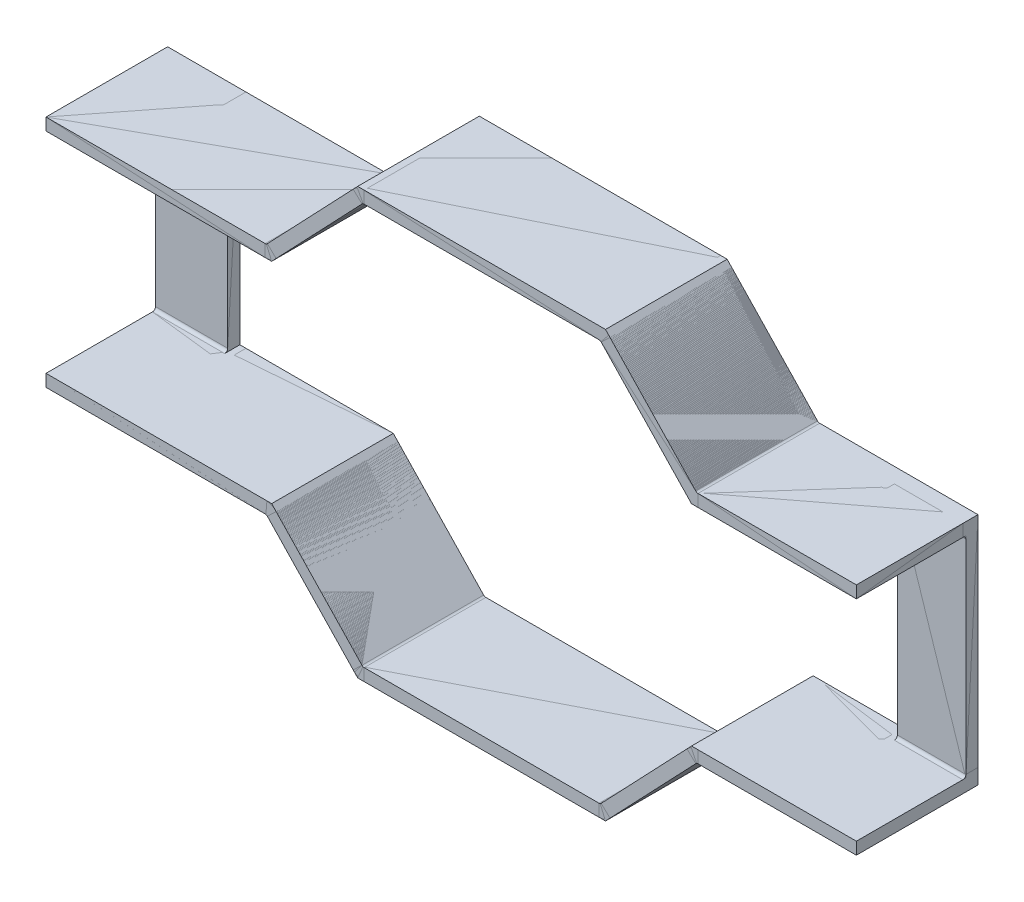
ISO-10303-21;
HEADER;
FILE_DESCRIPTION(('STEP AP214'),'2;1');
FILE_NAME('part.step','',(''),(''),'','','');
FILE_SCHEMA(('AUTOMOTIVE_DESIGN { 1 0 10303 214 1 1 1 1 }'));
ENDSEC;
DATA;
#1=APPLICATION_CONTEXT('core data for automotive mechanical design processes');
#2=APPLICATION_PROTOCOL_DEFINITION('international standard','automotive_design',2000,#1);
#3=PRODUCT_CONTEXT('',#1,'mechanical');
#4=PRODUCT('Part','Part','',(#3));
#5=PRODUCT_RELATED_PRODUCT_CATEGORY('part','',(#4));
#6=PRODUCT_DEFINITION_FORMATION('','',#4);
#7=PRODUCT_DEFINITION_CONTEXT('part definition',#1,'design');
#8=PRODUCT_DEFINITION('design','',#6,#7);
#9=PRODUCT_DEFINITION_SHAPE('','',#8);
#10=(LENGTH_UNIT() NAMED_UNIT(*) SI_UNIT(.MILLI.,.METRE.));
#11=(NAMED_UNIT(*) PLANE_ANGLE_UNIT() SI_UNIT($,.RADIAN.));
#12=(NAMED_UNIT(*) SI_UNIT($,.STERADIAN.) SOLID_ANGLE_UNIT());
#13=UNCERTAINTY_MEASURE_WITH_UNIT(LENGTH_MEASURE(1.E-05),#10,'distance_accuracy_value','');
#14=(GEOMETRIC_REPRESENTATION_CONTEXT(3) GLOBAL_UNCERTAINTY_ASSIGNED_CONTEXT((#13)) GLOBAL_UNIT_ASSIGNED_CONTEXT((#10,
#11,#12)) REPRESENTATION_CONTEXT('',''));
#15=CARTESIAN_POINT('',(0.,0.,0.));
#16=DIRECTION('',(0.,0.,1.));
#17=DIRECTION('',(1.,0.,0.));
#18=AXIS2_PLACEMENT_3D('',#15,#16,#17);
#19=CARTESIAN_POINT('',(-9.,7.7,9.87423281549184));
#20=DIRECTION('',(1.,0.,0.));
#21=DIRECTION('',(0.,1.,0.));
#22=AXIS2_PLACEMENT_3D('',#19,#20,#21);
#23=PLANE('',#22);
#24=DIRECTION('',(0.,0.,-1.));
#25=VECTOR('',#24,1.);
#26=CARTESIAN_POINT('',(-9.00000000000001,6.7,9.87423281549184));
#27=LINE('',#26,#25);
#28=CARTESIAN_POINT('',(-9.00000000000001,6.7,-3.52499999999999));
#29=VERTEX_POINT('',#28);
#30=CARTESIAN_POINT('',(-9.00000000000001,6.7,-4.32499999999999));
#31=VERTEX_POINT('',#30);
#32=EDGE_CURVE('P0_E1416',#29,#31,#27,.T.);
#33=ORIENTED_EDGE('',*,*,#32,.T.);
#34=DIRECTION('',(0.,-1.,0.));
#35=VECTOR('',#34,1.);
#36=CARTESIAN_POINT('',(-9.00000000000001,7.69999999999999,-4.32499999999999));
#37=LINE('',#36,#35);
#38=CARTESIAN_POINT('',(-8.99999999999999,-6.69999999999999,-4.325));
#39=VERTEX_POINT('',#38);
#40=EDGE_CURVE('P0_E1414',#31,#39,#37,.T.);
#41=ORIENTED_EDGE('',*,*,#40,.T.);
#42=DIRECTION('',(0.,0.,-1.));
#43=VECTOR('',#42,1.);
#44=CARTESIAN_POINT('',(-8.99999999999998,-6.69999999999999,14.5275265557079));
#45=LINE('',#44,#43);
#46=CARTESIAN_POINT('',(-8.99999999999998,-6.69999999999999,-3.525));
#47=VERTEX_POINT('',#46);
#48=EDGE_CURVE('P0_E1108',#47,#39,#45,.T.);
#49=ORIENTED_EDGE('',*,*,#48,.F.);
#50=DIRECTION('',(0.,-1.,0.));
#51=VECTOR('',#50,1.);
#52=CARTESIAN_POINT('',(-9.00000000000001,7.70000000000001,-3.52499999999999));
#53=LINE('',#52,#51);
#54=EDGE_CURVE('P0_E1409',#29,#47,#53,.T.);
#55=ORIENTED_EDGE('',*,*,#54,.F.);
#56=EDGE_LOOP('',(#33,#41,#49,#55));
#57=FACE_BOUND('',#56,.T.);
#58=ADVANCED_FACE('P0_F354',(#57),#23,.F.);
#59=CARTESIAN_POINT('',(-4.25000000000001,7.7,9.87423281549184));
#60=DIRECTION('',(-1.,0.,0.));
#61=DIRECTION('',(0.,-1.,0.));
#62=AXIS2_PLACEMENT_3D('',#59,#60,#61);
#63=PLANE('',#62);
#64=DIRECTION('',(0.,1.,0.));
#65=VECTOR('',#64,1.);
#66=CARTESIAN_POINT('',(-4.25000000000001,7.7,-3.52499999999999));
#67=LINE('',#66,#65);
#68=CARTESIAN_POINT('',(-4.24999999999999,-6.69999999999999,-3.525));
#69=VERTEX_POINT('',#68);
#70=CARTESIAN_POINT('',(-4.25,6.70000000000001,-3.525));
#71=VERTEX_POINT('',#70);
#72=EDGE_CURVE('P0_E1406',#69,#71,#67,.T.);
#73=ORIENTED_EDGE('',*,*,#72,.F.);
#74=DIRECTION('',(0.,0.,-1.));
#75=VECTOR('',#74,1.);
#76=CARTESIAN_POINT('',(-4.24999999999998,-6.69999999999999,14.5275265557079));
#77=LINE('',#76,#75);
#78=CARTESIAN_POINT('',(-4.24999999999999,-6.69999999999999,-4.325));
#79=VERTEX_POINT('',#78);
#80=EDGE_CURVE('P0_E1119',#69,#79,#77,.T.);
#81=ORIENTED_EDGE('',*,*,#80,.T.);
#82=DIRECTION('',(0.,1.,0.));
#83=VECTOR('',#82,1.);
#84=CARTESIAN_POINT('',(-4.25000000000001,7.7,-4.32499999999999));
#85=LINE('',#84,#83);
#86=CARTESIAN_POINT('',(-4.25,6.7,-4.32499999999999));
#87=VERTEX_POINT('',#86);
#88=EDGE_CURVE('P0_E1411',#79,#87,#85,.T.);
#89=ORIENTED_EDGE('',*,*,#88,.T.);
#90=DIRECTION('',(0.,0.,-1.));
#91=VECTOR('',#90,1.);
#92=CARTESIAN_POINT('',(-4.25,6.7,9.87423281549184));
#93=LINE('',#92,#91);
#94=EDGE_CURVE('P0_E1396',#71,#87,#93,.T.);
#95=ORIENTED_EDGE('',*,*,#94,.F.);
#96=EDGE_LOOP('',(#73,#81,#89,#95));
#97=FACE_BOUND('',#96,.T.);
#98=ADVANCED_FACE('P0_F1500',(#97),#63,.F.);
#99=CARTESIAN_POINT('',(-9.00000000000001,-7.7,-3.52499999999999));
#100=DIRECTION('',(0.,0.,1.));
#101=DIRECTION('',(1.,0.,0.));
#102=AXIS2_PLACEMENT_3D('',#99,#100,#101);
#103=PLANE('',#102);
#104=DIRECTION('',(1.,0.,0.));
#105=VECTOR('',#104,1.);
#106=CARTESIAN_POINT('',(-9.00000000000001,6.7,-3.52499999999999));
#107=LINE('',#106,#105);
#108=EDGE_CURVE('P0_E1390',#29,#71,#107,.T.);
#109=ORIENTED_EDGE('',*,*,#108,.F.);
#110=ORIENTED_EDGE('',*,*,#54,.T.);
#111=DIRECTION('',(-1.,0.,0.));
#112=VECTOR('',#111,1.);
#113=CARTESIAN_POINT('',(-4.24999999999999,-6.69999999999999,-3.525));
#114=LINE('',#113,#112);
#115=EDGE_CURVE('P0_E1102',#69,#47,#114,.T.);
#116=ORIENTED_EDGE('',*,*,#115,.F.);
#117=ORIENTED_EDGE('',*,*,#72,.T.);
#118=EDGE_LOOP('',(#109,#110,#116,#117));
#119=FACE_BOUND('',#118,.T.);
#120=ADVANCED_FACE('P0_F1507',(#119),#103,.T.);
#121=CARTESIAN_POINT('',(-9.00000000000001,6.7,-3.32499999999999));
#122=DIRECTION('',(1.,0.,0.));
#123=DIRECTION('',(0.,0.,1.));
#124=AXIS2_PLACEMENT_3D('',#121,#122,#123);
#125=PLANE('',#124);
#126=CARTESIAN_POINT('',(-9.00000000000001,6.7,-3.32499999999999));
#127=DIRECTION('',(1.,0.,0.));
#128=DIRECTION('',(0.,1.,0.));
#129=AXIS2_PLACEMENT_3D('',#126,#127,#128);
#130=CIRCLE('',#129,0.2);
#131=CARTESIAN_POINT('',(-9.00000000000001,6.9,-3.32499999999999));
#132=VERTEX_POINT('',#131);
#133=EDGE_CURVE('P0_E553',#132,#29,#130,.F.);
#134=ORIENTED_EDGE('',*,*,#133,.F.);
#135=DIRECTION('',(0.,-1.,0.));
#136=VECTOR('',#135,1.);
#137=CARTESIAN_POINT('',(-9.,39.8709952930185,-3.325));
#138=LINE('',#137,#136);
#139=CARTESIAN_POINT('',(-9.00000000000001,7.70000000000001,-3.32499999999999));
#140=VERTEX_POINT('',#139);
#141=EDGE_CURVE('P0_E549',#140,#132,#138,.T.);
#142=ORIENTED_EDGE('',*,*,#141,.F.);
#143=CARTESIAN_POINT('',(-9.00000000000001,6.7,-3.32499999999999));
#144=DIRECTION('',(1.,0.,0.));
#145=DIRECTION('',(0.,1.,0.));
#146=AXIS2_PLACEMENT_3D('',#143,#144,#145);
#147=CIRCLE('',#146,1.);
#148=EDGE_CURVE('P0_E1404',#140,#31,#147,.F.);
#149=ORIENTED_EDGE('',*,*,#148,.T.);
#150=ORIENTED_EDGE('',*,*,#32,.F.);
#151=EDGE_LOOP('',(#134,#142,#149,#150));
#152=FACE_BOUND('',#151,.T.);
#153=ADVANCED_FACE('P0_F1515',(#152),#125,.F.);
#154=CARTESIAN_POINT('',(-9.00000000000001,-7.7,-4.32499999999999));
#155=DIRECTION('',(0.,0.,1.));
#156=DIRECTION('',(1.,0.,0.));
#157=AXIS2_PLACEMENT_3D('',#154,#155,#156);
#158=PLANE('',#157);
#159=ORIENTED_EDGE('',*,*,#40,.F.);
#160=DIRECTION('',(1.,0.,0.));
#161=VECTOR('',#160,1.);
#162=CARTESIAN_POINT('',(-9.00000000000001,6.7,-4.32499999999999));
#163=LINE('',#162,#161);
#164=EDGE_CURVE('P0_E1401',#31,#87,#163,.T.);
#165=ORIENTED_EDGE('',*,*,#164,.T.);
#166=ORIENTED_EDGE('',*,*,#88,.F.);
#167=DIRECTION('',(-1.,0.,0.));
#168=VECTOR('',#167,1.);
#169=CARTESIAN_POINT('',(-4.24999999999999,-6.69999999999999,-4.325));
#170=LINE('',#169,#168);
#171=EDGE_CURVE('P0_E1113',#79,#39,#170,.T.);
#172=ORIENTED_EDGE('',*,*,#171,.T.);
#173=EDGE_LOOP('',(#159,#165,#166,#172));
#174=FACE_BOUND('',#173,.T.);
#175=ADVANCED_FACE('P0_F1519',(#174),#158,.F.);
#176=CARTESIAN_POINT('',(-4.25,6.70000000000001,-3.32499999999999));
#177=DIRECTION('',(-1.,0.,0.));
#178=DIRECTION('',(0.,0.,-1.));
#179=AXIS2_PLACEMENT_3D('',#176,#177,#178);
#180=PLANE('',#179);
#181=DIRECTION('',(0.,-1.,0.));
#182=VECTOR('',#181,1.);
#183=CARTESIAN_POINT('',(-4.25,39.8709952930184,-3.325));
#184=LINE('',#183,#182);
#185=CARTESIAN_POINT('',(-4.25000000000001,7.7,-3.32499999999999));
#186=VERTEX_POINT('',#185);
#187=CARTESIAN_POINT('',(-4.25,6.9,-3.32499999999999));
#188=VERTEX_POINT('',#187);
#189=EDGE_CURVE('P0_E1399',#186,#188,#184,.T.);
#190=ORIENTED_EDGE('',*,*,#189,.T.);
#191=CARTESIAN_POINT('',(-4.25,6.70000000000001,-3.32499999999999));
#192=DIRECTION('',(1.,0.,0.));
#193=DIRECTION('',(0.,1.,0.));
#194=AXIS2_PLACEMENT_3D('',#191,#192,#193);
#195=CIRCLE('',#194,0.2);
#196=EDGE_CURVE('P0_E1387',#71,#188,#195,.T.);
#197=ORIENTED_EDGE('',*,*,#196,.F.);
#198=ORIENTED_EDGE('',*,*,#94,.T.);
#199=CARTESIAN_POINT('',(-4.25,6.70000000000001,-3.32499999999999));
#200=DIRECTION('',(1.,0.,0.));
#201=DIRECTION('',(0.,1.,0.));
#202=AXIS2_PLACEMENT_3D('',#199,#200,#201);
#203=CIRCLE('',#202,1.);
#204=EDGE_CURVE('P0_E1393',#87,#186,#203,.T.);
#205=ORIENTED_EDGE('',*,*,#204,.T.);
#206=EDGE_LOOP('',(#190,#197,#198,#205));
#207=FACE_BOUND('',#206,.T.);
#208=ADVANCED_FACE('P0_F1522',(#207),#180,.F.);
#209=CARTESIAN_POINT('',(-75.9196933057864,6.69999999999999,-3.32499999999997));
#210=DIRECTION('',(1.,0.,0.));
#211=DIRECTION('',(0.,1.,0.));
#212=AXIS2_PLACEMENT_3D('',#209,#210,#211);
#213=CYLINDRICAL_SURFACE('',#212,0.2);
#214=ORIENTED_EDGE('',*,*,#108,.T.);
#215=ORIENTED_EDGE('',*,*,#196,.T.);
#216=DIRECTION('',(1.,0.,0.));
#217=VECTOR('',#216,1.);
#218=CARTESIAN_POINT('',(-9.00000000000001,6.9,-3.32499999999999));
#219=LINE('',#218,#217);
#220=EDGE_CURVE('P0_E1352',#132,#188,#219,.T.);
#221=ORIENTED_EDGE('',*,*,#220,.F.);
#222=ORIENTED_EDGE('',*,*,#133,.T.);
#223=EDGE_LOOP('',(#214,#215,#221,#222));
#224=FACE_BOUND('',#223,.T.);
#225=ADVANCED_FACE('P0_F1526',(#224),#213,.F.);
#226=CARTESIAN_POINT('',(-4.05,39.8709952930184,-2.92500000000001));
#227=DIRECTION('',(0.,-1.,0.));
#228=DIRECTION('',(1.,0.,0.));
#229=AXIS2_PLACEMENT_3D('',#226,#227,#228);
#230=CYLINDRICAL_SURFACE('',#229,0.2);
#231=DIRECTION('',(0.,-1.,0.));
#232=VECTOR('',#231,1.);
#233=CARTESIAN_POINT('',(-3.85000000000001,39.8709952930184,-2.92500000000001));
#234=LINE('',#233,#232);
#235=CARTESIAN_POINT('',(-3.85000000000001,7.7,-2.925));
#236=VERTEX_POINT('',#235);
#237=CARTESIAN_POINT('',(-3.85000000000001,6.9,-2.925));
#238=VERTEX_POINT('',#237);
#239=EDGE_CURVE('P0_E1383',#236,#238,#234,.T.);
#240=ORIENTED_EDGE('',*,*,#239,.T.);
#241=CARTESIAN_POINT('',(-4.05,6.9,-2.925));
#242=DIRECTION('',(0.,1.,0.));
#243=DIRECTION('',(-1.,0.,0.));
#244=AXIS2_PLACEMENT_3D('',#241,#242,#243);
#245=CIRCLE('',#244,0.2);
#246=CARTESIAN_POINT('',(-4.25,6.9,-2.925));
#247=VERTEX_POINT('',#246);
#248=EDGE_CURVE('P0_E1349',#247,#238,#245,.T.);
#249=ORIENTED_EDGE('',*,*,#248,.F.);
#250=DIRECTION('',(0.,-1.,0.));
#251=VECTOR('',#250,1.);
#252=CARTESIAN_POINT('',(-4.25,39.8709952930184,-2.92500000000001));
#253=LINE('',#252,#251);
#254=CARTESIAN_POINT('',(-4.25000000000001,7.7,-2.925));
#255=VERTEX_POINT('',#254);
#256=EDGE_CURVE('P0_E1367',#255,#247,#253,.T.);
#257=ORIENTED_EDGE('',*,*,#256,.F.);
#258=CARTESIAN_POINT('',(-4.05000000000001,7.7,-2.925));
#259=DIRECTION('',(0.,-1.,0.));
#260=DIRECTION('',(0.,0.,-1.));
#261=AXIS2_PLACEMENT_3D('',#258,#259,#260);
#262=CIRCLE('',#261,0.2);
#263=EDGE_CURVE('P0_E1325',#236,#255,#262,.T.);
#264=ORIENTED_EDGE('',*,*,#263,.F.);
#265=EDGE_LOOP('',(#240,#249,#257,#264));
#266=FACE_BOUND('',#265,.T.);
#267=ADVANCED_FACE('P0_F1530',(#266),#230,.F.);
#268=CARTESIAN_POINT('',(-3.85000000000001,39.8709952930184,-3.525));
#269=DIRECTION('',(-1.,0.,0.));
#270=DIRECTION('',(0.,0.,-1.));
#271=AXIS2_PLACEMENT_3D('',#268,#269,#270);
#272=PLANE('',#271);
#273=DIRECTION('',(0.,0.,1.));
#274=VECTOR('',#273,1.);
#275=CARTESIAN_POINT('',(-3.85,6.9,3.675));
#276=LINE('',#275,#274);
#277=CARTESIAN_POINT('',(-3.85000000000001,6.9,-4.32499999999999));
#278=VERTEX_POINT('',#277);
#279=EDGE_CURVE('P0_E1381',#278,#238,#276,.T.);
#280=ORIENTED_EDGE('',*,*,#279,.T.);
#281=ORIENTED_EDGE('',*,*,#239,.F.);
#282=DIRECTION('',(0.,0.,-1.));
#283=VECTOR('',#282,1.);
#284=CARTESIAN_POINT('',(-3.85000000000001,7.7,-3.525));
#285=LINE('',#284,#283);
#286=CARTESIAN_POINT('',(-3.85,7.7,-4.32499999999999));
#287=VERTEX_POINT('',#286);
#288=EDGE_CURVE('P0_E1379',#236,#287,#285,.T.);
#289=ORIENTED_EDGE('',*,*,#288,.T.);
#290=DIRECTION('',(0.,-1.,0.));
#291=VECTOR('',#290,1.);
#292=CARTESIAN_POINT('',(-3.85000000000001,39.8709952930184,-4.325));
#293=LINE('',#292,#291);
#294=EDGE_CURVE('P0_E1376',#287,#278,#293,.T.);
#295=ORIENTED_EDGE('',*,*,#294,.T.);
#296=EDGE_LOOP('',(#280,#281,#289,#295));
#297=FACE_BOUND('',#296,.T.);
#298=ADVANCED_FACE('P0_F1534',(#297),#272,.T.);
#299=CARTESIAN_POINT('',(-9.,39.8709952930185,-3.525));
#300=DIRECTION('',(-1.,0.,0.));
#301=DIRECTION('',(0.,0.,-1.));
#302=AXIS2_PLACEMENT_3D('',#299,#300,#301);
#303=PLANE('',#302);
#304=DIRECTION('',(0.,0.,-1.));
#305=VECTOR('',#304,1.);
#306=CARTESIAN_POINT('',(-9.00000000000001,6.9,3.67500000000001));
#307=LINE('',#306,#305);
#308=CARTESIAN_POINT('',(-9.00000000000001,6.9,3.67500000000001));
#309=VERTEX_POINT('',#308);
#310=EDGE_CURVE('P0_E1355',#309,#132,#307,.T.);
#311=ORIENTED_EDGE('',*,*,#310,.F.);
#312=DIRECTION('',(0.,-1.,0.));
#313=VECTOR('',#312,1.);
#314=CARTESIAN_POINT('',(-9.,39.8709952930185,3.675));
#315=LINE('',#314,#313);
#316=CARTESIAN_POINT('',(-9.,7.7,3.67500000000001));
#317=VERTEX_POINT('',#316);
#318=EDGE_CURVE('P0_E1361',#317,#309,#315,.T.);
#319=ORIENTED_EDGE('',*,*,#318,.F.);
#320=DIRECTION('',(0.,0.,-1.));
#321=VECTOR('',#320,1.);
#322=CARTESIAN_POINT('',(-9.00000000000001,7.7,-3.52499999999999));
#323=LINE('',#322,#321);
#324=EDGE_CURVE('P0_E1373',#317,#140,#323,.T.);
#325=ORIENTED_EDGE('',*,*,#324,.T.);
#326=ORIENTED_EDGE('',*,*,#141,.T.);
#327=EDGE_LOOP('',(#311,#319,#325,#326));
#328=FACE_BOUND('',#327,.T.);
#329=ADVANCED_FACE('P0_F1538',(#328),#303,.T.);
#330=CARTESIAN_POINT('',(-75.9196933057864,6.69999999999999,-3.32499999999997));
#331=DIRECTION('',(1.,0.,0.));
#332=DIRECTION('',(0.,1.,0.));
#333=AXIS2_PLACEMENT_3D('',#330,#331,#332);
#334=CYLINDRICAL_SURFACE('',#333,1.);
#335=ORIENTED_EDGE('',*,*,#164,.F.);
#336=ORIENTED_EDGE('',*,*,#148,.F.);
#337=DIRECTION('',(-1.,0.,0.));
#338=VECTOR('',#337,1.);
#339=CARTESIAN_POINT('',(-9.00000000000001,7.7,-3.32499999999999));
#340=LINE('',#339,#338);
#341=EDGE_CURVE('P0_E1337',#186,#140,#340,.T.);
#342=ORIENTED_EDGE('',*,*,#341,.F.);
#343=ORIENTED_EDGE('',*,*,#204,.F.);
#344=EDGE_LOOP('',(#335,#336,#342,#343));
#345=FACE_BOUND('',#344,.T.);
#346=ADVANCED_FACE('P0_F1542',(#345),#334,.T.);
#347=CARTESIAN_POINT('',(-4.25,39.8709952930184,-3.525));
#348=DIRECTION('',(1.,0.,0.));
#349=DIRECTION('',(0.,0.,1.));
#350=AXIS2_PLACEMENT_3D('',#347,#348,#349);
#351=PLANE('',#350);
#352=DIRECTION('',(0.,0.,-1.));
#353=VECTOR('',#352,1.);
#354=CARTESIAN_POINT('',(-4.25,6.9,3.675));
#355=LINE('',#354,#353);
#356=EDGE_CURVE('P0_E1369',#247,#188,#355,.T.);
#357=ORIENTED_EDGE('',*,*,#356,.T.);
#358=ORIENTED_EDGE('',*,*,#189,.F.);
#359=DIRECTION('',(0.,0.,-1.));
#360=VECTOR('',#359,1.);
#361=CARTESIAN_POINT('',(-4.25000000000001,7.7,-3.52499999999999));
#362=LINE('',#361,#360);
#363=EDGE_CURVE('P0_E1340',#255,#186,#362,.T.);
#364=ORIENTED_EDGE('',*,*,#363,.F.);
#365=ORIENTED_EDGE('',*,*,#256,.T.);
#366=EDGE_LOOP('',(#357,#358,#364,#365));
#367=FACE_BOUND('',#366,.T.);
#368=ADVANCED_FACE('P0_F1546',(#367),#351,.T.);
#369=CARTESIAN_POINT('',(-9.,39.8709952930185,-4.325));
#370=DIRECTION('',(0.,0.,1.));
#371=DIRECTION('',(-1.,0.,0.));
#372=AXIS2_PLACEMENT_3D('',#369,#370,#371);
#373=PLANE('',#372);
#374=DIRECTION('',(0.,-1.,0.));
#375=VECTOR('',#374,1.);
#376=CARTESIAN_POINT('',(5.41428571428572,39.8709952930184,-4.32500000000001));
#377=LINE('',#376,#375);
#378=CARTESIAN_POINT('',(5.4142857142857,7.7,-4.32500000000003));
#379=VERTEX_POINT('',#378);
#380=CARTESIAN_POINT('',(5.4142857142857,6.9,-4.32500000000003));
#381=VERTEX_POINT('',#380);
#382=EDGE_CURVE('P0_E1364',#379,#381,#377,.T.);
#383=ORIENTED_EDGE('',*,*,#382,.T.);
#384=DIRECTION('',(1.,0.,0.));
#385=VECTOR('',#384,1.);
#386=CARTESIAN_POINT('',(-9.00000000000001,6.9,-4.32499999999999));
#387=LINE('',#386,#385);
#388=EDGE_CURVE('P0_E1346',#278,#381,#387,.T.);
#389=ORIENTED_EDGE('',*,*,#388,.F.);
#390=ORIENTED_EDGE('',*,*,#294,.F.);
#391=DIRECTION('',(-1.,0.,0.));
#392=VECTOR('',#391,1.);
#393=CARTESIAN_POINT('',(-9.00000000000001,7.69999999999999,-4.32499999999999));
#394=LINE('',#393,#392);
#395=EDGE_CURVE('P0_E1328',#379,#287,#394,.T.);
#396=ORIENTED_EDGE('',*,*,#395,.F.);
#397=EDGE_LOOP('',(#383,#389,#390,#396));
#398=FACE_BOUND('',#397,.T.);
#399=ADVANCED_FACE('P0_F1550',(#398),#373,.F.);
#400=CARTESIAN_POINT('',(-9.,39.8709952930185,3.675));
#401=DIRECTION('',(0.,0.,-1.));
#402=DIRECTION('',(1.,0.,0.));
#403=AXIS2_PLACEMENT_3D('',#400,#401,#402);
#404=PLANE('',#403);
#405=ORIENTED_EDGE('',*,*,#318,.T.);
#406=DIRECTION('',(1.,0.,0.));
#407=VECTOR('',#406,1.);
#408=CARTESIAN_POINT('',(-9.00000000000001,6.9,3.67500000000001));
#409=LINE('',#408,#407);
#410=CARTESIAN_POINT('',(5.41428571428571,6.9,3.675));
#411=VERTEX_POINT('',#410);
#412=EDGE_CURVE('P0_E1358',#309,#411,#409,.T.);
#413=ORIENTED_EDGE('',*,*,#412,.T.);
#414=DIRECTION('',(0.,-1.,0.));
#415=VECTOR('',#414,1.);
#416=CARTESIAN_POINT('',(5.41428571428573,39.8709952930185,3.67499999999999));
#417=LINE('',#416,#415);
#418=CARTESIAN_POINT('',(5.41428571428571,7.7,3.67499999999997));
#419=VERTEX_POINT('',#418);
#420=EDGE_CURVE('P0_E1318',#419,#411,#417,.T.);
#421=ORIENTED_EDGE('',*,*,#420,.F.);
#422=DIRECTION('',(1.,0.,0.));
#423=VECTOR('',#422,1.);
#424=CARTESIAN_POINT('',(-9.,7.7,3.67500000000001));
#425=LINE('',#424,#423);
#426=EDGE_CURVE('P0_E1334',#317,#419,#425,.T.);
#427=ORIENTED_EDGE('',*,*,#426,.F.);
#428=EDGE_LOOP('',(#405,#413,#421,#427));
#429=FACE_BOUND('',#428,.T.);
#430=ADVANCED_FACE('P0_F1554',(#429),#404,.F.);
#431=CARTESIAN_POINT('',(-9.00000000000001,6.9,3.67500000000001));
#432=DIRECTION('',(0.,1.,0.));
#433=DIRECTION('',(-1.,0.,0.));
#434=AXIS2_PLACEMENT_3D('',#431,#432,#433);
#435=PLANE('',#434);
#436=ORIENTED_EDGE('',*,*,#310,.T.);
#437=ORIENTED_EDGE('',*,*,#220,.T.);
#438=ORIENTED_EDGE('',*,*,#356,.F.);
#439=ORIENTED_EDGE('',*,*,#248,.T.);
#440=ORIENTED_EDGE('',*,*,#279,.F.);
#441=ORIENTED_EDGE('',*,*,#388,.T.);
#442=DIRECTION('',(0.,0.,1.));
#443=VECTOR('',#442,1.);
#444=CARTESIAN_POINT('',(5.41428571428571,6.89999999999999,-4.325));
#445=LINE('',#444,#443);
#446=EDGE_CURVE('P0_E1343',#381,#411,#445,.T.);
#447=ORIENTED_EDGE('',*,*,#446,.T.);
#448=ORIENTED_EDGE('',*,*,#412,.F.);
#449=EDGE_LOOP('',(#436,#437,#438,#439,#440,#441,#447,#448));
#450=FACE_BOUND('',#449,.T.);
#451=ADVANCED_FACE('P0_F1558',(#450),#435,.F.);
#452=CARTESIAN_POINT('',(-9.00000000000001,7.7,-3.52499999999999));
#453=DIRECTION('',(0.,-1.,0.));
#454=DIRECTION('',(0.,0.,-1.));
#455=AXIS2_PLACEMENT_3D('',#452,#453,#454);
#456=PLANE('',#455);
#457=ORIENTED_EDGE('',*,*,#363,.T.);
#458=ORIENTED_EDGE('',*,*,#341,.T.);
#459=ORIENTED_EDGE('',*,*,#324,.F.);
#460=ORIENTED_EDGE('',*,*,#426,.T.);
#461=DIRECTION('',(0.,0.,-1.));
#462=VECTOR('',#461,1.);
#463=CARTESIAN_POINT('',(5.41428571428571,7.69999999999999,-4.325));
#464=LINE('',#463,#462);
#465=EDGE_CURVE('P0_E1331',#419,#379,#464,.T.);
#466=ORIENTED_EDGE('',*,*,#465,.T.);
#467=ORIENTED_EDGE('',*,*,#395,.T.);
#468=ORIENTED_EDGE('',*,*,#288,.F.);
#469=ORIENTED_EDGE('',*,*,#263,.T.);
#470=EDGE_LOOP('',(#457,#458,#459,#460,#466,#467,#468,#469));
#471=FACE_BOUND('',#470,.T.);
#472=ADVANCED_FACE('P0_F1562',(#471),#456,.F.);
#473=CARTESIAN_POINT('',(5.41428571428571,7.9,-4.32500000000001));
#474=DIRECTION('',(0.,0.,1.));
#475=DIRECTION('',(0.998810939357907,0.0487514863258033,0.));
#476=AXIS2_PLACEMENT_3D('',#473,#474,#475);
#477=PLANE('',#476);
#478=ORIENTED_EDGE('',*,*,#382,.F.);
#479=CARTESIAN_POINT('',(5.41428571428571,7.9,-4.32500000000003));
#480=DIRECTION('',(0.,0.,1.));
#481=DIRECTION('',(0.998810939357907,0.0487514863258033,0.));
#482=AXIS2_PLACEMENT_3D('',#479,#480,#481);
#483=CIRCLE('',#482,0.199999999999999);
#484=CARTESIAN_POINT('',(5.5591133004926,7.76206896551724,-4.325));
#485=VERTEX_POINT('',#484);
#486=EDGE_CURVE('P0_E1306',#485,#379,#483,.F.);
#487=ORIENTED_EDGE('',*,*,#486,.F.);
#488=DIRECTION('',(-0.724137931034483,0.689655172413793,0.));
#489=VECTOR('',#488,1.);
#490=CARTESIAN_POINT('',(22.7150729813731,-8.57694025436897,-4.325));
#491=LINE('',#490,#489);
#492=CARTESIAN_POINT('',(6.13842364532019,7.2103448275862,-4.32500000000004));
#493=VERTEX_POINT('',#492);
#494=EDGE_CURVE('P0_E1300',#493,#485,#491,.T.);
#495=ORIENTED_EDGE('',*,*,#494,.F.);
#496=CARTESIAN_POINT('',(5.41428571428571,7.9,-4.32500000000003));
#497=DIRECTION('',(0.,0.,1.));
#498=DIRECTION('',(0.998810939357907,0.0487514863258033,0.));
#499=AXIS2_PLACEMENT_3D('',#496,#497,#498);
#500=CIRCLE('',#499,0.999999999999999);
#501=EDGE_CURVE('P0_E1323',#493,#381,#500,.F.);
#502=ORIENTED_EDGE('',*,*,#501,.T.);
#503=EDGE_LOOP('',(#478,#487,#495,#502));
#504=FACE_BOUND('',#503,.T.);
#505=ADVANCED_FACE('P0_F1566',(#504),#477,.F.);
#506=CARTESIAN_POINT('',(5.41428571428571,7.9,3.675));
#507=DIRECTION('',(0.,0.,-1.));
#508=DIRECTION('',(-0.998810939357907,-0.0487514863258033,0.));
#509=AXIS2_PLACEMENT_3D('',#506,#507,#508);
#510=PLANE('',#509);
#511=DIRECTION('',(-0.724137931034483,0.689655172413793,0.));
#512=VECTOR('',#511,1.);
#513=CARTESIAN_POINT('',(22.7150729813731,-8.57694025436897,3.67499999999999));
#514=LINE('',#513,#512);
#515=CARTESIAN_POINT('',(6.13842364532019,7.21034482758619,3.67499999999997));
#516=VERTEX_POINT('',#515);
#517=CARTESIAN_POINT('',(5.5591133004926,7.76206896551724,3.67499999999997));
#518=VERTEX_POINT('',#517);
#519=EDGE_CURVE('P0_E1321',#516,#518,#514,.T.);
#520=ORIENTED_EDGE('',*,*,#519,.T.);
#521=CARTESIAN_POINT('',(5.41428571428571,7.9,3.67499999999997));
#522=DIRECTION('',(0.,0.,1.));
#523=DIRECTION('',(0.998810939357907,0.0487514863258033,0.));
#524=AXIS2_PLACEMENT_3D('',#521,#522,#523);
#525=CIRCLE('',#524,0.199999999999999);
#526=EDGE_CURVE('P0_E1312',#419,#518,#525,.T.);
#527=ORIENTED_EDGE('',*,*,#526,.F.);
#528=ORIENTED_EDGE('',*,*,#420,.T.);
#529=CARTESIAN_POINT('',(5.41428571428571,7.9,3.67499999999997));
#530=DIRECTION('',(0.,0.,1.));
#531=DIRECTION('',(0.998810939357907,0.0487514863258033,0.));
#532=AXIS2_PLACEMENT_3D('',#529,#530,#531);
#533=CIRCLE('',#532,0.999999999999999);
#534=EDGE_CURVE('P0_E1315',#411,#516,#533,.T.);
#535=ORIENTED_EDGE('',*,*,#534,.T.);
#536=EDGE_LOOP('',(#520,#527,#528,#535));
#537=FACE_BOUND('',#536,.T.);
#538=ADVANCED_FACE('P0_F1570',(#537),#510,.F.);
#539=CARTESIAN_POINT('',(5.41428571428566,7.90000000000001,-78.8180899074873));
#540=DIRECTION('',(0.,0.,1.));
#541=DIRECTION('',(0.998810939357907,0.0487514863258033,0.));
#542=AXIS2_PLACEMENT_3D('',#539,#540,#541);
#543=CYLINDRICAL_SURFACE('',#542,0.999999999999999);
#544=ORIENTED_EDGE('',*,*,#534,.F.);
#545=ORIENTED_EDGE('',*,*,#446,.F.);
#546=ORIENTED_EDGE('',*,*,#501,.F.);
#547=DIRECTION('',(0.,0.,-1.));
#548=VECTOR('',#547,1.);
#549=CARTESIAN_POINT('',(6.13842364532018,7.2103448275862,-4.325));
#550=LINE('',#549,#548);
#551=EDGE_CURVE('P0_E1289',#516,#493,#550,.T.);
#552=ORIENTED_EDGE('',*,*,#551,.F.);
#553=EDGE_LOOP('',(#544,#545,#546,#552));
#554=FACE_BOUND('',#553,.T.);
#555=ADVANCED_FACE('P0_F1574',(#554),#543,.T.);
#556=CARTESIAN_POINT('',(5.41428571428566,7.90000000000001,-78.8180899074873));
#557=DIRECTION('',(0.,0.,1.));
#558=DIRECTION('',(0.998810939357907,0.0487514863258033,0.));
#559=AXIS2_PLACEMENT_3D('',#556,#557,#558);
#560=CYLINDRICAL_SURFACE('',#559,0.199999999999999);
#561=ORIENTED_EDGE('',*,*,#526,.T.);
#562=DIRECTION('',(0.,0.,-1.));
#563=VECTOR('',#562,1.);
#564=CARTESIAN_POINT('',(5.5591133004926,7.76206896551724,-4.325));
#565=LINE('',#564,#563);
#566=EDGE_CURVE('P0_E1309',#518,#485,#565,.T.);
#567=ORIENTED_EDGE('',*,*,#566,.T.);
#568=ORIENTED_EDGE('',*,*,#486,.T.);
#569=ORIENTED_EDGE('',*,*,#465,.F.);
#570=EDGE_LOOP('',(#561,#567,#568,#569));
#571=FACE_BOUND('',#570,.T.);
#572=ADVANCED_FACE('P0_F1578',(#571),#560,.F.);
#573=CARTESIAN_POINT('',(22.6559596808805,-8.63900921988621,-4.325));
#574=DIRECTION('',(0.,0.,1.));
#575=DIRECTION('',(-0.689655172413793,-0.724137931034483,0.));
#576=AXIS2_PLACEMENT_3D('',#573,#574,#575);
#577=PLANE('',#576);
#578=DIRECTION('',(0.689655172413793,0.724137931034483,0.));
#579=VECTOR('',#578,1.);
#580=CARTESIAN_POINT('',(5.49999999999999,7.7,-4.325));
#581=LINE('',#580,#579);
#582=CARTESIAN_POINT('',(11.2044334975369,13.6896551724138,-4.325));
#583=VERTEX_POINT('',#582);
#584=EDGE_CURVE('P0_E1303',#485,#583,#581,.T.);
#585=ORIENTED_EDGE('',*,*,#584,.T.);
#586=DIRECTION('',(-0.724137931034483,0.689655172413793,0.));
#587=VECTOR('',#586,1.);
#588=CARTESIAN_POINT('',(28.3603931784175,-2.64935404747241,-4.325));
#589=LINE('',#588,#587);
#590=CARTESIAN_POINT('',(11.7837438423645,13.1379310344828,-4.325));
#591=VERTEX_POINT('',#590);
#592=EDGE_CURVE('P0_E1277',#591,#583,#589,.T.);
#593=ORIENTED_EDGE('',*,*,#592,.F.);
#594=DIRECTION('',(0.689655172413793,0.724137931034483,0.));
#595=VECTOR('',#594,1.);
#596=CARTESIAN_POINT('',(6.07931034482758,7.14827586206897,-4.325));
#597=LINE('',#596,#595);
#598=EDGE_CURVE('P0_E1286',#493,#591,#597,.T.);
#599=ORIENTED_EDGE('',*,*,#598,.F.);
#600=ORIENTED_EDGE('',*,*,#494,.T.);
#601=EDGE_LOOP('',(#585,#593,#599,#600));
#602=FACE_BOUND('',#601,.T.);
#603=ADVANCED_FACE('P0_F1582',(#602),#577,.F.);
#604=CARTESIAN_POINT('',(22.6559596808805,-8.63900921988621,3.67499999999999));
#605=DIRECTION('',(0.,0.,1.));
#606=DIRECTION('',(-0.689655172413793,-0.724137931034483,0.));
#607=AXIS2_PLACEMENT_3D('',#604,#605,#606);
#608=PLANE('',#607);
#609=DIRECTION('',(-0.724137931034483,0.689655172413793,0.));
#610=VECTOR('',#609,1.);
#611=CARTESIAN_POINT('',(28.3603931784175,-2.6493540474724,3.675));
#612=LINE('',#611,#610);
#613=CARTESIAN_POINT('',(11.7837438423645,13.1379310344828,3.675));
#614=VERTEX_POINT('',#613);
#615=CARTESIAN_POINT('',(11.204433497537,13.6896551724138,3.675));
#616=VERTEX_POINT('',#615);
#617=EDGE_CURVE('P0_E1298',#614,#616,#612,.T.);
#618=ORIENTED_EDGE('',*,*,#617,.T.);
#619=DIRECTION('',(-0.689655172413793,-0.724137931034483,0.));
#620=VECTOR('',#619,1.);
#621=CARTESIAN_POINT('',(5.5,7.7,3.675));
#622=LINE('',#621,#620);
#623=EDGE_CURVE('P0_E1295',#616,#518,#622,.T.);
#624=ORIENTED_EDGE('',*,*,#623,.T.);
#625=ORIENTED_EDGE('',*,*,#519,.F.);
#626=DIRECTION('',(-0.689655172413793,-0.724137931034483,0.));
#627=VECTOR('',#626,1.);
#628=CARTESIAN_POINT('',(6.07931034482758,7.14827586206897,3.675));
#629=LINE('',#628,#627);
#630=EDGE_CURVE('P0_E1292',#614,#516,#629,.T.);
#631=ORIENTED_EDGE('',*,*,#630,.F.);
#632=EDGE_LOOP('',(#618,#624,#625,#631));
#633=FACE_BOUND('',#632,.T.);
#634=ADVANCED_FACE('P0_F1586',(#633),#608,.T.);
#635=CARTESIAN_POINT('',(6.07931034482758,7.14827586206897,3.675));
#636=DIRECTION('',(-0.724137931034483,0.689655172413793,0.));
#637=DIRECTION('',(-0.689655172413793,-0.724137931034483,0.));
#638=AXIS2_PLACEMENT_3D('',#635,#636,#637);
#639=PLANE('',#638);
#640=ORIENTED_EDGE('',*,*,#630,.T.);
#641=ORIENTED_EDGE('',*,*,#551,.T.);
#642=ORIENTED_EDGE('',*,*,#598,.T.);
#643=DIRECTION('',(0.,0.,1.));
#644=VECTOR('',#643,1.);
#645=CARTESIAN_POINT('',(11.7837438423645,13.1379310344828,3.675));
#646=LINE('',#645,#644);
#647=EDGE_CURVE('P0_E1283',#591,#614,#646,.T.);
#648=ORIENTED_EDGE('',*,*,#647,.T.);
#649=EDGE_LOOP('',(#640,#641,#642,#648));
#650=FACE_BOUND('',#649,.T.);
#651=ADVANCED_FACE('P0_F1590',(#650),#639,.F.);
#652=CARTESIAN_POINT('',(5.49999999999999,7.7,3.675));
#653=DIRECTION('',(-0.724137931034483,0.689655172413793,0.));
#654=DIRECTION('',(-0.689655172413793,-0.724137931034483,0.));
#655=AXIS2_PLACEMENT_3D('',#652,#653,#654);
#656=PLANE('',#655);
#657=ORIENTED_EDGE('',*,*,#566,.F.);
#658=ORIENTED_EDGE('',*,*,#623,.F.);
#659=DIRECTION('',(0.,0.,1.));
#660=VECTOR('',#659,1.);
#661=CARTESIAN_POINT('',(11.2044334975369,13.6896551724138,3.675));
#662=LINE('',#661,#660);
#663=EDGE_CURVE('P0_E1264',#583,#616,#662,.T.);
#664=ORIENTED_EDGE('',*,*,#663,.F.);
#665=ORIENTED_EDGE('',*,*,#584,.F.);
#666=EDGE_LOOP('',(#657,#658,#664,#665));
#667=FACE_BOUND('',#666,.T.);
#668=ADVANCED_FACE('P0_F1594',(#667),#656,.T.);
#669=CARTESIAN_POINT('',(11.9285714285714,13.,-4.325));
#670=DIRECTION('',(0.,0.,-1.));
#671=DIRECTION('',(-0.724137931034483,0.689655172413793,0.));
#672=AXIS2_PLACEMENT_3D('',#669,#670,#671);
#673=PLANE('',#672);
#674=CARTESIAN_POINT('',(11.9285714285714,13.,-4.325));
#675=DIRECTION('',(0.,0.,-1.));
#676=DIRECTION('',(-0.724137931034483,0.689655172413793,0.));
#677=AXIS2_PLACEMENT_3D('',#674,#675,#676);
#678=CIRCLE('',#677,0.199999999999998);
#679=CARTESIAN_POINT('',(11.9285714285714,13.2,-4.325));
#680=VERTEX_POINT('',#679);
#681=EDGE_CURVE('P0_E1280',#680,#591,#678,.F.);
#682=ORIENTED_EDGE('',*,*,#681,.T.);
#683=ORIENTED_EDGE('',*,*,#592,.T.);
#684=CARTESIAN_POINT('',(11.9285714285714,13.,-4.325));
#685=DIRECTION('',(0.,0.,-1.));
#686=DIRECTION('',(-0.724137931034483,0.689655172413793,0.));
#687=AXIS2_PLACEMENT_3D('',#684,#685,#686);
#688=CIRCLE('',#687,0.999999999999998);
#689=CARTESIAN_POINT('',(11.9285714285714,14.,-4.325));
#690=VERTEX_POINT('',#689);
#691=EDGE_CURVE('P0_E1267',#690,#583,#688,.F.);
#692=ORIENTED_EDGE('',*,*,#691,.F.);
#693=DIRECTION('',(0.,1.,0.));
#694=VECTOR('',#693,1.);
#695=CARTESIAN_POINT('',(11.9285714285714,-21.5840099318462,-4.325));
#696=LINE('',#695,#694);
#697=EDGE_CURVE('P0_E1255',#680,#690,#696,.T.);
#698=ORIENTED_EDGE('',*,*,#697,.F.);
#699=EDGE_LOOP('',(#682,#683,#692,#698));
#700=FACE_BOUND('',#699,.T.);
#701=ADVANCED_FACE('P0_F1598',(#700),#673,.T.);
#702=CARTESIAN_POINT('',(11.9285714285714,13.,3.675));
#703=DIRECTION('',(0.,0.,1.));
#704=DIRECTION('',(0.724137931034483,-0.689655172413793,0.));
#705=AXIS2_PLACEMENT_3D('',#702,#703,#704);
#706=PLANE('',#705);
#707=ORIENTED_EDGE('',*,*,#617,.F.);
#708=CARTESIAN_POINT('',(11.9285714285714,13.,3.675));
#709=DIRECTION('',(0.,0.,-1.));
#710=DIRECTION('',(-0.724137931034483,0.689655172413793,0.));
#711=AXIS2_PLACEMENT_3D('',#708,#709,#710);
#712=CIRCLE('',#711,0.199999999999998);
#713=CARTESIAN_POINT('',(11.9285714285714,13.2,3.675));
#714=VERTEX_POINT('',#713);
#715=EDGE_CURVE('P0_E1275',#614,#714,#712,.T.);
#716=ORIENTED_EDGE('',*,*,#715,.T.);
#717=DIRECTION('',(0.,1.,0.));
#718=VECTOR('',#717,1.);
#719=CARTESIAN_POINT('',(11.9285714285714,-21.5840099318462,3.675));
#720=LINE('',#719,#718);
#721=CARTESIAN_POINT('',(11.9285714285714,14.,3.675));
#722=VERTEX_POINT('',#721);
#723=EDGE_CURVE('P0_E1273',#714,#722,#720,.T.);
#724=ORIENTED_EDGE('',*,*,#723,.T.);
#725=CARTESIAN_POINT('',(11.9285714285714,13.,3.675));
#726=DIRECTION('',(0.,0.,-1.));
#727=DIRECTION('',(-0.724137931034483,0.689655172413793,0.));
#728=AXIS2_PLACEMENT_3D('',#725,#726,#727);
#729=CIRCLE('',#728,0.999999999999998);
#730=EDGE_CURVE('P0_E1261',#616,#722,#729,.T.);
#731=ORIENTED_EDGE('',*,*,#730,.F.);
#732=EDGE_LOOP('',(#707,#716,#724,#731));
#733=FACE_BOUND('',#732,.T.);
#734=ADVANCED_FACE('P0_F1602',(#733),#706,.T.);
#735=CARTESIAN_POINT('',(11.9285714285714,13.,80.5985656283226));
#736=DIRECTION('',(0.,0.,-1.));
#737=DIRECTION('',(-0.724137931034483,0.689655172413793,0.));
#738=AXIS2_PLACEMENT_3D('',#735,#736,#737);
#739=CYLINDRICAL_SURFACE('',#738,0.199999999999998);
#740=DIRECTION('',(0.,0.,1.));
#741=VECTOR('',#740,1.);
#742=CARTESIAN_POINT('',(11.9285714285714,13.2,3.675));
#743=LINE('',#742,#741);
#744=EDGE_CURVE('P0_E1270',#680,#714,#743,.T.);
#745=ORIENTED_EDGE('',*,*,#744,.T.);
#746=ORIENTED_EDGE('',*,*,#715,.F.);
#747=ORIENTED_EDGE('',*,*,#647,.F.);
#748=ORIENTED_EDGE('',*,*,#681,.F.);
#749=EDGE_LOOP('',(#745,#746,#747,#748));
#750=FACE_BOUND('',#749,.T.);
#751=ADVANCED_FACE('P0_F1606',(#750),#739,.F.);
#752=CARTESIAN_POINT('',(11.9285714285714,13.,80.5985656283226));
#753=DIRECTION('',(0.,0.,-1.));
#754=DIRECTION('',(-0.724137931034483,0.689655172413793,0.));
#755=AXIS2_PLACEMENT_3D('',#752,#753,#754);
#756=CYLINDRICAL_SURFACE('',#755,0.999999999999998);
#757=DIRECTION('',(0.,0.,1.));
#758=VECTOR('',#757,1.);
#759=CARTESIAN_POINT('',(11.9285714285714,14.,3.675));
#760=LINE('',#759,#758);
#761=EDGE_CURVE('P0_E1242',#690,#722,#760,.T.);
#762=ORIENTED_EDGE('',*,*,#761,.F.);
#763=ORIENTED_EDGE('',*,*,#691,.T.);
#764=ORIENTED_EDGE('',*,*,#663,.T.);
#765=ORIENTED_EDGE('',*,*,#730,.T.);
#766=EDGE_LOOP('',(#762,#763,#764,#765));
#767=FACE_BOUND('',#766,.T.);
#768=ADVANCED_FACE('P0_F1610',(#767),#756,.T.);
#769=CARTESIAN_POINT('',(11.5,-21.5840099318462,-4.325));
#770=DIRECTION('',(0.,0.,1.));
#771=DIRECTION('',(-1.,0.,0.));
#772=AXIS2_PLACEMENT_3D('',#769,#770,#771);
#773=PLANE('',#772);
#774=DIRECTION('',(1.,0.,0.));
#775=VECTOR('',#774,1.);
#776=CARTESIAN_POINT('',(11.5,14.,-4.325));
#777=LINE('',#776,#775);
#778=CARTESIAN_POINT('',(27.3714285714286,14.,-4.325));
#779=VERTEX_POINT('',#778);
#780=EDGE_CURVE('P0_E1258',#690,#779,#777,.T.);
#781=ORIENTED_EDGE('',*,*,#780,.T.);
#782=DIRECTION('',(0.,1.,0.));
#783=VECTOR('',#782,1.);
#784=CARTESIAN_POINT('',(27.3714285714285,-21.5840099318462,-4.325));
#785=LINE('',#784,#783);
#786=CARTESIAN_POINT('',(27.3714285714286,13.2,-4.325));
#787=VERTEX_POINT('',#786);
#788=EDGE_CURVE('P0_E1234',#787,#779,#785,.T.);
#789=ORIENTED_EDGE('',*,*,#788,.F.);
#790=DIRECTION('',(1.,0.,0.));
#791=VECTOR('',#790,1.);
#792=CARTESIAN_POINT('',(11.5,13.2,-4.325));
#793=LINE('',#792,#791);
#794=EDGE_CURVE('P0_E1248',#680,#787,#793,.T.);
#795=ORIENTED_EDGE('',*,*,#794,.F.);
#796=ORIENTED_EDGE('',*,*,#697,.T.);
#797=EDGE_LOOP('',(#781,#789,#795,#796));
#798=FACE_BOUND('',#797,.T.);
#799=ADVANCED_FACE('P0_F1614',(#798),#773,.F.);
#800=CARTESIAN_POINT('',(11.5,-21.5840099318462,3.675));
#801=DIRECTION('',(0.,0.,1.));
#802=DIRECTION('',(-1.,0.,0.));
#803=AXIS2_PLACEMENT_3D('',#800,#801,#802);
#804=PLANE('',#803);
#805=DIRECTION('',(0.,1.,0.));
#806=VECTOR('',#805,1.);
#807=CARTESIAN_POINT('',(27.3714285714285,-21.5840099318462,3.675));
#808=LINE('',#807,#806);
#809=CARTESIAN_POINT('',(27.3714285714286,13.2,3.675));
#810=VERTEX_POINT('',#809);
#811=CARTESIAN_POINT('',(27.3714285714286,14.,3.67500000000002));
#812=VERTEX_POINT('',#811);
#813=EDGE_CURVE('P0_E1253',#810,#812,#808,.T.);
#814=ORIENTED_EDGE('',*,*,#813,.T.);
#815=DIRECTION('',(1.,0.,0.));
#816=VECTOR('',#815,1.);
#817=CARTESIAN_POINT('',(11.5,14.,3.675));
#818=LINE('',#817,#816);
#819=EDGE_CURVE('P0_E1239',#722,#812,#818,.T.);
#820=ORIENTED_EDGE('',*,*,#819,.F.);
#821=ORIENTED_EDGE('',*,*,#723,.F.);
#822=DIRECTION('',(1.,0.,0.));
#823=VECTOR('',#822,1.);
#824=CARTESIAN_POINT('',(11.5,13.2,3.675));
#825=LINE('',#824,#823);
#826=EDGE_CURVE('P0_E1251',#714,#810,#825,.T.);
#827=ORIENTED_EDGE('',*,*,#826,.T.);
#828=EDGE_LOOP('',(#814,#820,#821,#827));
#829=FACE_BOUND('',#828,.T.);
#830=ADVANCED_FACE('P0_F1618',(#829),#804,.T.);
#831=CARTESIAN_POINT('',(11.5,13.2,3.675));
#832=DIRECTION('',(0.,1.,0.));
#833=DIRECTION('',(-1.,0.,0.));
#834=AXIS2_PLACEMENT_3D('',#831,#832,#833);
#835=PLANE('',#834);
#836=ORIENTED_EDGE('',*,*,#744,.F.);
#837=ORIENTED_EDGE('',*,*,#794,.T.);
#838=DIRECTION('',(0.,0.,1.));
#839=VECTOR('',#838,1.);
#840=CARTESIAN_POINT('',(27.3714285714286,13.2,3.675));
#841=LINE('',#840,#839);
#842=EDGE_CURVE('P0_E1245',#787,#810,#841,.T.);
#843=ORIENTED_EDGE('',*,*,#842,.T.);
#844=ORIENTED_EDGE('',*,*,#826,.F.);
#845=EDGE_LOOP('',(#836,#837,#843,#844));
#846=FACE_BOUND('',#845,.T.);
#847=ADVANCED_FACE('P0_F1622',(#846),#835,.F.);
#848=CARTESIAN_POINT('',(11.5,14.,3.675));
#849=DIRECTION('',(0.,1.,0.));
#850=DIRECTION('',(-1.,0.,0.));
#851=AXIS2_PLACEMENT_3D('',#848,#849,#850);
#852=PLANE('',#851);
#853=ORIENTED_EDGE('',*,*,#780,.F.);
#854=ORIENTED_EDGE('',*,*,#761,.T.);
#855=ORIENTED_EDGE('',*,*,#819,.T.);
#856=DIRECTION('',(0.,0.,1.));
#857=VECTOR('',#856,1.);
#858=CARTESIAN_POINT('',(27.3714285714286,14.,3.675));
#859=LINE('',#858,#857);
#860=EDGE_CURVE('P0_E1213',#779,#812,#859,.T.);
#861=ORIENTED_EDGE('',*,*,#860,.F.);
#862=EDGE_LOOP('',(#853,#854,#855,#861));
#863=FACE_BOUND('',#862,.T.);
#864=ADVANCED_FACE('P0_F1626',(#863),#852,.T.);
#865=CARTESIAN_POINT('',(27.3714285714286,13.,-4.325));
#866=DIRECTION('',(0.,0.,1.));
#867=DIRECTION('',(0.,-1.,0.));
#868=AXIS2_PLACEMENT_3D('',#865,#866,#867);
#869=PLANE('',#868);
#870=DIRECTION('',(-0.724137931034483,-0.689655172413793,0.));
#871=VECTOR('',#870,1.);
#872=CARTESIAN_POINT('',(44.0929054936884,28.9252161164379,-4.325));
#873=LINE('',#872,#871);
#874=CARTESIAN_POINT('',(28.095566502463,13.6896551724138,-4.32499999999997));
#875=VERTEX_POINT('',#874);
#876=CARTESIAN_POINT('',(27.5162561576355,13.1379310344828,-4.32499999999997));
#877=VERTEX_POINT('',#876);
#878=EDGE_CURVE('P0_E1237',#875,#877,#873,.T.);
#879=ORIENTED_EDGE('',*,*,#878,.T.);
#880=CARTESIAN_POINT('',(27.3714285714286,13.,-4.32499999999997));
#881=DIRECTION('',(0.,0.,-1.));
#882=DIRECTION('',(0.,1.,0.));
#883=AXIS2_PLACEMENT_3D('',#880,#881,#882);
#884=CIRCLE('',#883,0.200000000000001);
#885=EDGE_CURVE('P0_E1225',#787,#877,#884,.T.);
#886=ORIENTED_EDGE('',*,*,#885,.F.);
#887=ORIENTED_EDGE('',*,*,#788,.T.);
#888=CARTESIAN_POINT('',(27.3714285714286,13.,-4.32499999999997));
#889=DIRECTION('',(0.,0.,-1.));
#890=DIRECTION('',(0.,1.,0.));
#891=AXIS2_PLACEMENT_3D('',#888,#889,#890);
#892=CIRCLE('',#891,1.);
#893=EDGE_CURVE('P0_E1231',#779,#875,#892,.T.);
#894=ORIENTED_EDGE('',*,*,#893,.T.);
#895=EDGE_LOOP('',(#879,#886,#887,#894));
#896=FACE_BOUND('',#895,.T.);
#897=ADVANCED_FACE('P0_F1630',(#896),#869,.F.);
#898=CARTESIAN_POINT('',(27.3714285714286,13.,3.675));
#899=DIRECTION('',(0.,0.,-1.));
#900=DIRECTION('',(0.,1.,0.));
#901=AXIS2_PLACEMENT_3D('',#898,#899,#900);
#902=PLANE('',#901);
#903=ORIENTED_EDGE('',*,*,#813,.F.);
#904=CARTESIAN_POINT('',(27.3714285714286,13.,3.67500000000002));
#905=DIRECTION('',(0.,0.,-1.));
#906=DIRECTION('',(0.,1.,0.));
#907=AXIS2_PLACEMENT_3D('',#904,#905,#906);
#908=CIRCLE('',#907,0.200000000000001);
#909=CARTESIAN_POINT('',(27.5162561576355,13.1379310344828,3.675));
#910=VERTEX_POINT('',#909);
#911=EDGE_CURVE('P0_E1222',#910,#810,#908,.F.);
#912=ORIENTED_EDGE('',*,*,#911,.F.);
#913=DIRECTION('',(-0.724137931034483,-0.689655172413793,0.));
#914=VECTOR('',#913,1.);
#915=CARTESIAN_POINT('',(44.0929054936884,28.9252161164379,3.675));
#916=LINE('',#915,#914);
#917=CARTESIAN_POINT('',(28.095566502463,13.6896551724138,3.67500000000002));
#918=VERTEX_POINT('',#917);
#919=EDGE_CURVE('P0_E1208',#918,#910,#916,.T.);
#920=ORIENTED_EDGE('',*,*,#919,.F.);
#921=CARTESIAN_POINT('',(27.3714285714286,13.,3.67500000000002));
#922=DIRECTION('',(0.,0.,-1.));
#923=DIRECTION('',(0.,1.,0.));
#924=AXIS2_PLACEMENT_3D('',#921,#922,#923);
#925=CIRCLE('',#924,1.);
#926=EDGE_CURVE('P0_E1228',#918,#812,#925,.F.);
#927=ORIENTED_EDGE('',*,*,#926,.T.);
#928=EDGE_LOOP('',(#903,#912,#920,#927));
#929=FACE_BOUND('',#928,.T.);
#930=ADVANCED_FACE('P0_F1634',(#929),#902,.F.);
#931=CARTESIAN_POINT('',(27.3714285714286,13.,74.7645358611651));
#932=DIRECTION('',(0.,0.,-1.));
#933=DIRECTION('',(0.,1.,0.));
#934=AXIS2_PLACEMENT_3D('',#931,#932,#933);
#935=CYLINDRICAL_SURFACE('',#934,0.200000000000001);
#936=ORIENTED_EDGE('',*,*,#885,.T.);
#937=DIRECTION('',(0.,0.,-1.));
#938=VECTOR('',#937,1.);
#939=CARTESIAN_POINT('',(27.5162561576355,13.1379310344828,3.675));
#940=LINE('',#939,#938);
#941=EDGE_CURVE('P0_E1202',#910,#877,#940,.T.);
#942=ORIENTED_EDGE('',*,*,#941,.F.);
#943=ORIENTED_EDGE('',*,*,#911,.T.);
#944=ORIENTED_EDGE('',*,*,#842,.F.);
#945=EDGE_LOOP('',(#936,#942,#943,#944));
#946=FACE_BOUND('',#945,.T.);
#947=ADVANCED_FACE('P0_F1638',(#946),#935,.F.);
#948=CARTESIAN_POINT('',(43.7973389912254,29.2355609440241,-4.325));
#949=DIRECTION('',(0.,0.,-1.));
#950=DIRECTION('',(0.689655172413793,-0.724137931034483,0.));
#951=AXIS2_PLACEMENT_3D('',#948,#949,#950);
#952=PLANE('',#951);
#953=DIRECTION('',(0.689655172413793,-0.724137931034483,0.));
#954=VECTOR('',#953,1.);
#955=CARTESIAN_POINT('',(27.2206896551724,13.448275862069,-4.325));
#956=LINE('',#955,#954);
#957=CARTESIAN_POINT('',(33.1615763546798,7.21034482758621,-4.325));
#958=VERTEX_POINT('',#957);
#959=EDGE_CURVE('P0_E1199',#877,#958,#956,.T.);
#960=ORIENTED_EDGE('',*,*,#959,.F.);
#961=ORIENTED_EDGE('',*,*,#878,.F.);
#962=DIRECTION('',(0.689655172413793,-0.724137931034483,0.));
#963=VECTOR('',#962,1.);
#964=CARTESIAN_POINT('',(27.8,14.,-4.325));
#965=LINE('',#964,#963);
#966=CARTESIAN_POINT('',(33.7408866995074,7.76206896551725,-4.325));
#967=VERTEX_POINT('',#966);
#968=EDGE_CURVE('P0_E1219',#875,#967,#965,.T.);
#969=ORIENTED_EDGE('',*,*,#968,.T.);
#970=DIRECTION('',(-0.724137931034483,-0.689655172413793,0.));
#971=VECTOR('',#970,1.);
#972=CARTESIAN_POINT('',(49.7382256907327,22.9976299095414,-4.325));
#973=LINE('',#972,#971);
#974=EDGE_CURVE('P0_E1216',#967,#958,#973,.T.);
#975=ORIENTED_EDGE('',*,*,#974,.T.);
#976=EDGE_LOOP('',(#960,#961,#969,#975));
#977=FACE_BOUND('',#976,.T.);
#978=ADVANCED_FACE('P0_F1642',(#977),#952,.T.);
#979=CARTESIAN_POINT('',(27.3714285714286,13.,74.7645358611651));
#980=DIRECTION('',(0.,0.,-1.));
#981=DIRECTION('',(0.,1.,0.));
#982=AXIS2_PLACEMENT_3D('',#979,#980,#981);
#983=CYLINDRICAL_SURFACE('',#982,1.);
#984=ORIENTED_EDGE('',*,*,#893,.F.);
#985=ORIENTED_EDGE('',*,*,#860,.T.);
#986=ORIENTED_EDGE('',*,*,#926,.F.);
#987=DIRECTION('',(0.,0.,-1.));
#988=VECTOR('',#987,1.);
#989=CARTESIAN_POINT('',(28.0955665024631,13.6896551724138,3.675));
#990=LINE('',#989,#988);
#991=EDGE_CURVE('P0_E1211',#918,#875,#990,.T.);
#992=ORIENTED_EDGE('',*,*,#991,.T.);
#993=EDGE_LOOP('',(#984,#985,#986,#992));
#994=FACE_BOUND('',#993,.T.);
#995=ADVANCED_FACE('P0_F1646',(#994),#983,.T.);
#996=CARTESIAN_POINT('',(43.7973389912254,29.2355609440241,3.675));
#997=DIRECTION('',(0.,0.,-1.));
#998=DIRECTION('',(0.689655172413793,-0.724137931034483,0.));
#999=AXIS2_PLACEMENT_3D('',#996,#997,#998);
#1000=PLANE('',#999);
#1001=ORIENTED_EDGE('',*,*,#919,.T.);
#1002=DIRECTION('',(0.689655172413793,-0.724137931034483,0.));
#1003=VECTOR('',#1002,1.);
#1004=CARTESIAN_POINT('',(27.2206896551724,13.448275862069,3.675));
#1005=LINE('',#1004,#1003);
#1006=CARTESIAN_POINT('',(33.1615763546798,7.21034482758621,3.675));
#1007=VERTEX_POINT('',#1006);
#1008=EDGE_CURVE('P0_E1205',#910,#1007,#1005,.T.);
#1009=ORIENTED_EDGE('',*,*,#1008,.T.);
#1010=DIRECTION('',(-0.724137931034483,-0.689655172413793,0.));
#1011=VECTOR('',#1010,1.);
#1012=CARTESIAN_POINT('',(49.7382256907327,22.9976299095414,3.675));
#1013=LINE('',#1012,#1011);
#1014=CARTESIAN_POINT('',(33.7408866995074,7.76206896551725,3.67500000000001));
#1015=VERTEX_POINT('',#1014);
#1016=EDGE_CURVE('P0_E1186',#1015,#1007,#1013,.T.);
#1017=ORIENTED_EDGE('',*,*,#1016,.F.);
#1018=DIRECTION('',(0.689655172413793,-0.724137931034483,0.));
#1019=VECTOR('',#1018,1.);
#1020=CARTESIAN_POINT('',(27.8,14.,3.675));
#1021=LINE('',#1020,#1019);
#1022=EDGE_CURVE('P0_E1191',#918,#1015,#1021,.T.);
#1023=ORIENTED_EDGE('',*,*,#1022,.F.);
#1024=EDGE_LOOP('',(#1001,#1009,#1017,#1023));
#1025=FACE_BOUND('',#1024,.T.);
#1026=ADVANCED_FACE('P0_F1650',(#1025),#1000,.F.);
#1027=CARTESIAN_POINT('',(27.2206896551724,13.448275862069,3.675));
#1028=DIRECTION('',(0.724137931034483,0.689655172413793,0.));
#1029=DIRECTION('',(-0.689655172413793,0.724137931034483,0.));
#1030=AXIS2_PLACEMENT_3D('',#1027,#1028,#1029);
#1031=PLANE('',#1030);
#1032=ORIENTED_EDGE('',*,*,#1008,.F.);
#1033=ORIENTED_EDGE('',*,*,#941,.T.);
#1034=ORIENTED_EDGE('',*,*,#959,.T.);
#1035=DIRECTION('',(0.,0.,1.));
#1036=VECTOR('',#1035,1.);
#1037=CARTESIAN_POINT('',(33.1615763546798,7.2103448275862,-4.325));
#1038=LINE('',#1037,#1036);
#1039=EDGE_CURVE('P0_E1196',#958,#1007,#1038,.T.);
#1040=ORIENTED_EDGE('',*,*,#1039,.T.);
#1041=EDGE_LOOP('',(#1032,#1033,#1034,#1040));
#1042=FACE_BOUND('',#1041,.T.);
#1043=ADVANCED_FACE('P0_F1654',(#1042),#1031,.F.);
#1044=CARTESIAN_POINT('',(33.8857142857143,7.9,-4.325));
#1045=DIRECTION('',(0.,0.,1.));
#1046=DIRECTION('',(-1.,0.,0.));
#1047=AXIS2_PLACEMENT_3D('',#1044,#1045,#1046);
#1048=PLANE('',#1047);
#1049=CARTESIAN_POINT('',(33.8857142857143,7.9,-4.325));
#1050=DIRECTION('',(0.,0.,1.));
#1051=DIRECTION('',(0.,-1.,0.));
#1052=AXIS2_PLACEMENT_3D('',#1049,#1050,#1051);
#1053=CIRCLE('',#1052,0.200000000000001);
#1054=CARTESIAN_POINT('',(33.8857142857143,7.7,-4.325));
#1055=VERTEX_POINT('',#1054);
#1056=EDGE_CURVE('P0_E1154',#1055,#967,#1053,.F.);
#1057=ORIENTED_EDGE('',*,*,#1056,.F.);
#1058=DIRECTION('',(0.,1.,0.));
#1059=VECTOR('',#1058,1.);
#1060=CARTESIAN_POINT('',(33.8857142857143,-19.3646033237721,-4.325));
#1061=LINE('',#1060,#1059);
#1062=CARTESIAN_POINT('',(33.8857142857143,6.9,-4.325));
#1063=VERTEX_POINT('',#1062);
#1064=EDGE_CURVE('P0_E1177',#1063,#1055,#1061,.T.);
#1065=ORIENTED_EDGE('',*,*,#1064,.F.);
#1066=CARTESIAN_POINT('',(33.8857142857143,7.9,-4.325));
#1067=DIRECTION('',(0.,0.,1.));
#1068=DIRECTION('',(0.,-1.,0.));
#1069=AXIS2_PLACEMENT_3D('',#1066,#1067,#1068);
#1070=CIRCLE('',#1069,1.);
#1071=EDGE_CURVE('P0_E1194',#1063,#958,#1070,.F.);
#1072=ORIENTED_EDGE('',*,*,#1071,.T.);
#1073=ORIENTED_EDGE('',*,*,#974,.F.);
#1074=EDGE_LOOP('',(#1057,#1065,#1072,#1073));
#1075=FACE_BOUND('',#1074,.T.);
#1076=ADVANCED_FACE('P0_F1658',(#1075),#1048,.F.);
#1077=CARTESIAN_POINT('',(27.8,14.,3.675));
#1078=DIRECTION('',(0.724137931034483,0.689655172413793,0.));
#1079=DIRECTION('',(-0.689655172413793,0.724137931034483,0.));
#1080=AXIS2_PLACEMENT_3D('',#1077,#1078,#1079);
#1081=PLANE('',#1080);
#1082=ORIENTED_EDGE('',*,*,#991,.F.);
#1083=ORIENTED_EDGE('',*,*,#1022,.T.);
#1084=DIRECTION('',(0.,0.,1.));
#1085=VECTOR('',#1084,1.);
#1086=CARTESIAN_POINT('',(33.7408866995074,7.76206896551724,-4.325));
#1087=LINE('',#1086,#1085);
#1088=EDGE_CURVE('P0_E1163',#967,#1015,#1087,.T.);
#1089=ORIENTED_EDGE('',*,*,#1088,.F.);
#1090=ORIENTED_EDGE('',*,*,#968,.F.);
#1091=EDGE_LOOP('',(#1082,#1083,#1089,#1090));
#1092=FACE_BOUND('',#1091,.T.);
#1093=ADVANCED_FACE('P0_F1662',(#1092),#1081,.T.);
#1094=CARTESIAN_POINT('',(33.8857142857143,7.9,3.67500000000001));
#1095=DIRECTION('',(0.,0.,-1.));
#1096=DIRECTION('',(0.,1.,0.));
#1097=AXIS2_PLACEMENT_3D('',#1094,#1095,#1096);
#1098=PLANE('',#1097);
#1099=DIRECTION('',(0.,1.,0.));
#1100=VECTOR('',#1099,1.);
#1101=CARTESIAN_POINT('',(33.8857142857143,-19.3646033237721,3.675));
#1102=LINE('',#1101,#1100);
#1103=CARTESIAN_POINT('',(33.8857142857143,6.9,3.67500000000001));
#1104=VERTEX_POINT('',#1103);
#1105=CARTESIAN_POINT('',(33.8857142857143,7.7,3.67500000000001));
#1106=VERTEX_POINT('',#1105);
#1107=EDGE_CURVE('P0_E1189',#1104,#1106,#1102,.T.);
#1108=ORIENTED_EDGE('',*,*,#1107,.T.);
#1109=CARTESIAN_POINT('',(33.8857142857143,7.9,3.67500000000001));
#1110=DIRECTION('',(0.,0.,1.));
#1111=DIRECTION('',(0.,-1.,0.));
#1112=AXIS2_PLACEMENT_3D('',#1109,#1110,#1111);
#1113=CIRCLE('',#1112,0.200000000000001);
#1114=EDGE_CURVE('P0_E1160',#1015,#1106,#1113,.T.);
#1115=ORIENTED_EDGE('',*,*,#1114,.F.);
#1116=ORIENTED_EDGE('',*,*,#1016,.T.);
#1117=CARTESIAN_POINT('',(33.8857142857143,7.9,3.67500000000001));
#1118=DIRECTION('',(0.,0.,1.));
#1119=DIRECTION('',(0.,-1.,0.));
#1120=AXIS2_PLACEMENT_3D('',#1117,#1118,#1119);
#1121=CIRCLE('',#1120,1.);
#1122=EDGE_CURVE('P0_E1183',#1007,#1104,#1121,.T.);
#1123=ORIENTED_EDGE('',*,*,#1122,.T.);
#1124=EDGE_LOOP('',(#1108,#1115,#1116,#1123));
#1125=FACE_BOUND('',#1124,.T.);
#1126=ADVANCED_FACE('P0_F1666',(#1125),#1098,.F.);
#1127=CARTESIAN_POINT('',(33.8857142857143,7.9,-71.2446933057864));
#1128=DIRECTION('',(0.,0.,1.));
#1129=DIRECTION('',(0.,-1.,0.));
#1130=AXIS2_PLACEMENT_3D('',#1127,#1128,#1129);
#1131=CYLINDRICAL_SURFACE('',#1130,1.);
#1132=ORIENTED_EDGE('',*,*,#1039,.F.);
#1133=ORIENTED_EDGE('',*,*,#1071,.F.);
#1134=DIRECTION('',(0.,0.,-1.));
#1135=VECTOR('',#1134,1.);
#1136=CARTESIAN_POINT('',(33.8857142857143,6.9,-4.325));
#1137=LINE('',#1136,#1135);
#1138=EDGE_CURVE('P0_E1130',#1104,#1063,#1137,.T.);
#1139=ORIENTED_EDGE('',*,*,#1138,.F.);
#1140=ORIENTED_EDGE('',*,*,#1122,.F.);
#1141=EDGE_LOOP('',(#1132,#1133,#1139,#1140));
#1142=FACE_BOUND('',#1141,.T.);
#1143=ADVANCED_FACE('P0_F1670',(#1142),#1131,.T.);
#1144=CARTESIAN_POINT('',(33.8,-19.3646033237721,-4.325));
#1145=DIRECTION('',(0.,0.,1.));
#1146=DIRECTION('',(-1.,0.,0.));
#1147=AXIS2_PLACEMENT_3D('',#1144,#1145,#1146);
#1148=PLANE('',#1147);
#1149=DIRECTION('',(1.,0.,0.));
#1150=VECTOR('',#1149,1.);
#1151=CARTESIAN_POINT('',(33.8,7.7,-4.325));
#1152=LINE('',#1151,#1150);
#1153=CARTESIAN_POINT('',(39.4,7.7,-4.325));
#1154=VERTEX_POINT('',#1153);
#1155=EDGE_CURVE('P0_E1180',#1055,#1154,#1152,.T.);
#1156=ORIENTED_EDGE('',*,*,#1155,.T.);
#1157=DIRECTION('',(0.,1.,0.));
#1158=VECTOR('',#1157,1.);
#1159=CARTESIAN_POINT('',(39.4,-19.3646033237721,-4.325));
#1160=LINE('',#1159,#1158);
#1161=CARTESIAN_POINT('',(39.4,6.9,-4.325));
#1162=VERTEX_POINT('',#1161);
#1163=EDGE_CURVE('P0_E1174',#1162,#1154,#1160,.T.);
#1164=ORIENTED_EDGE('',*,*,#1163,.F.);
#1165=DIRECTION('',(1.,0.,0.));
#1166=VECTOR('',#1165,1.);
#1167=CARTESIAN_POINT('',(33.8,6.9,-4.325));
#1168=LINE('',#1167,#1166);
#1169=EDGE_CURVE('P0_E1127',#1063,#1162,#1168,.T.);
#1170=ORIENTED_EDGE('',*,*,#1169,.F.);
#1171=ORIENTED_EDGE('',*,*,#1064,.T.);
#1172=EDGE_LOOP('',(#1156,#1164,#1170,#1171));
#1173=FACE_BOUND('',#1172,.T.);
#1174=ADVANCED_FACE('P0_F1674',(#1173),#1148,.F.);
#1175=CARTESIAN_POINT('',(39.4,-19.3646033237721,3.675));
#1176=DIRECTION('',(1.,0.,0.));
#1177=DIRECTION('',(0.,0.,1.));
#1178=AXIS2_PLACEMENT_3D('',#1175,#1176,#1177);
#1179=PLANE('',#1178);
#1180=ORIENTED_EDGE('',*,*,#1163,.T.);
#1181=DIRECTION('',(0.,0.,-1.));
#1182=VECTOR('',#1181,1.);
#1183=CARTESIAN_POINT('',(39.4,7.7,3.675));
#1184=LINE('',#1183,#1182);
#1185=CARTESIAN_POINT('',(39.4,7.7,-2.925));
#1186=VERTEX_POINT('',#1185);
#1187=EDGE_CURVE('P0_E1139',#1186,#1154,#1184,.T.);
#1188=ORIENTED_EDGE('',*,*,#1187,.F.);
#1189=DIRECTION('',(0.,1.,0.));
#1190=VECTOR('',#1189,1.);
#1191=CARTESIAN_POINT('',(39.4,-19.3646033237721,-2.925));
#1192=LINE('',#1191,#1190);
#1193=CARTESIAN_POINT('',(39.4,6.9,-2.925));
#1194=VERTEX_POINT('',#1193);
#1195=EDGE_CURVE('P0_E1166',#1194,#1186,#1192,.T.);
#1196=ORIENTED_EDGE('',*,*,#1195,.F.);
#1197=DIRECTION('',(0.,0.,-1.));
#1198=VECTOR('',#1197,1.);
#1199=CARTESIAN_POINT('',(39.4,6.9,3.675));
#1200=LINE('',#1199,#1198);
#1201=EDGE_CURVE('P0_E1172',#1194,#1162,#1200,.T.);
#1202=ORIENTED_EDGE('',*,*,#1201,.T.);
#1203=EDGE_LOOP('',(#1180,#1188,#1196,#1202));
#1204=FACE_BOUND('',#1203,.T.);
#1205=ADVANCED_FACE('P0_F1678',(#1204),#1179,.T.);
#1206=CARTESIAN_POINT('',(39.6,-19.3646033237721,-2.925));
#1207=DIRECTION('',(0.,1.,0.));
#1208=DIRECTION('',(0.,0.,1.));
#1209=AXIS2_PLACEMENT_3D('',#1206,#1207,#1208);
#1210=CYLINDRICAL_SURFACE('',#1209,0.2);
#1211=CARTESIAN_POINT('',(39.6,7.7,-2.925));
#1212=DIRECTION('',(0.,1.,0.));
#1213=DIRECTION('',(-1.,0.,0.));
#1214=AXIS2_PLACEMENT_3D('',#1211,#1212,#1213);
#1215=CIRCLE('',#1214,0.2);
#1216=CARTESIAN_POINT('',(39.8,7.7,-2.925));
#1217=VERTEX_POINT('',#1216);
#1218=EDGE_CURVE('P0_E1169',#1186,#1217,#1215,.T.);
#1219=ORIENTED_EDGE('',*,*,#1218,.T.);
#1220=DIRECTION('',(0.,1.,0.));
#1221=VECTOR('',#1220,1.);
#1222=CARTESIAN_POINT('',(39.8,-19.3646033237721,-2.925));
#1223=LINE('',#1222,#1221);
#1224=CARTESIAN_POINT('',(39.8,6.9,-2.925));
#1225=VERTEX_POINT('',#1224);
#1226=EDGE_CURVE('P0_E1137',#1225,#1217,#1223,.T.);
#1227=ORIENTED_EDGE('',*,*,#1226,.F.);
#1228=CARTESIAN_POINT('',(39.6,6.9,-2.925));
#1229=DIRECTION('',(0.,1.,0.));
#1230=DIRECTION('',(-1.,0.,0.));
#1231=AXIS2_PLACEMENT_3D('',#1228,#1229,#1230);
#1232=CIRCLE('',#1231,0.2);
#1233=EDGE_CURVE('P0_E364',#1194,#1225,#1232,.T.);
#1234=ORIENTED_EDGE('',*,*,#1233,.F.);
#1235=ORIENTED_EDGE('',*,*,#1195,.T.);
#1236=EDGE_LOOP('',(#1219,#1227,#1234,#1235));
#1237=FACE_BOUND('',#1236,.T.);
#1238=ADVANCED_FACE('P0_F1682',(#1237),#1210,.F.);
#1239=CARTESIAN_POINT('',(33.8857142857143,7.9,-71.2446933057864));
#1240=DIRECTION('',(0.,0.,1.));
#1241=DIRECTION('',(0.,-1.,0.));
#1242=AXIS2_PLACEMENT_3D('',#1239,#1240,#1241);
#1243=CYLINDRICAL_SURFACE('',#1242,0.200000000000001);
#1244=ORIENTED_EDGE('',*,*,#1088,.T.);
#1245=ORIENTED_EDGE('',*,*,#1114,.T.);
#1246=DIRECTION('',(0.,0.,-1.));
#1247=VECTOR('',#1246,1.);
#1248=CARTESIAN_POINT('',(33.8857142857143,7.7,-4.325));
#1249=LINE('',#1248,#1247);
#1250=EDGE_CURVE('P0_E1157',#1106,#1055,#1249,.T.);
#1251=ORIENTED_EDGE('',*,*,#1250,.T.);
#1252=ORIENTED_EDGE('',*,*,#1056,.T.);
#1253=EDGE_LOOP('',(#1244,#1245,#1251,#1252));
#1254=FACE_BOUND('',#1253,.T.);
#1255=ADVANCED_FACE('P0_F1686',(#1254),#1243,.F.);
#1256=CARTESIAN_POINT('',(33.8,-19.3646033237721,3.675));
#1257=DIRECTION('',(0.,0.,1.));
#1258=DIRECTION('',(-1.,0.,0.));
#1259=AXIS2_PLACEMENT_3D('',#1256,#1257,#1258);
#1260=PLANE('',#1259);
#1261=DIRECTION('',(0.,1.,0.));
#1262=VECTOR('',#1261,1.);
#1263=CARTESIAN_POINT('',(44.3,-19.3646033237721,3.675));
#1264=LINE('',#1263,#1262);
#1265=CARTESIAN_POINT('',(44.3,6.9,3.675));
#1266=VERTEX_POINT('',#1265);
#1267=CARTESIAN_POINT('',(44.3,7.7,3.675));
#1268=VERTEX_POINT('',#1267);
#1269=EDGE_CURVE('P0_E1151',#1266,#1268,#1264,.T.);
#1270=ORIENTED_EDGE('',*,*,#1269,.T.);
#1271=DIRECTION('',(-1.,0.,0.));
#1272=VECTOR('',#1271,1.);
#1273=CARTESIAN_POINT('',(33.8,7.7,3.675));
#1274=LINE('',#1273,#1272);
#1275=EDGE_CURVE('P0_E1148',#1268,#1106,#1274,.T.);
#1276=ORIENTED_EDGE('',*,*,#1275,.T.);
#1277=ORIENTED_EDGE('',*,*,#1107,.F.);
#1278=DIRECTION('',(-1.,0.,0.));
#1279=VECTOR('',#1278,1.);
#1280=CARTESIAN_POINT('',(33.8,6.9,3.675));
#1281=LINE('',#1280,#1279);
#1282=EDGE_CURVE('P0_E1133',#1266,#1104,#1281,.T.);
#1283=ORIENTED_EDGE('',*,*,#1282,.F.);
#1284=EDGE_LOOP('',(#1270,#1276,#1277,#1283));
#1285=FACE_BOUND('',#1284,.T.);
#1286=ADVANCED_FACE('P0_F1690',(#1285),#1260,.T.);
#1287=CARTESIAN_POINT('',(44.3,-19.3646033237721,3.675));
#1288=DIRECTION('',(1.,0.,0.));
#1289=DIRECTION('',(0.,0.,1.));
#1290=AXIS2_PLACEMENT_3D('',#1287,#1288,#1289);
#1291=PLANE('',#1290);
#1292=DIRECTION('',(0.,1.,0.));
#1293=VECTOR('',#1292,1.);
#1294=CARTESIAN_POINT('',(44.3,-19.3646033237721,-3.325));
#1295=LINE('',#1294,#1293);
#1296=CARTESIAN_POINT('',(44.3,6.9,-3.325));
#1297=VERTEX_POINT('',#1296);
#1298=CARTESIAN_POINT('',(44.3,7.7,-3.325));
#1299=VERTEX_POINT('',#1298);
#1300=EDGE_CURVE('P0_E791',#1297,#1299,#1295,.T.);
#1301=ORIENTED_EDGE('',*,*,#1300,.T.);
#1302=DIRECTION('',(0.,0.,-1.));
#1303=VECTOR('',#1302,1.);
#1304=CARTESIAN_POINT('',(44.3,7.7,3.675));
#1305=LINE('',#1304,#1303);
#1306=EDGE_CURVE('P0_E1143',#1268,#1299,#1305,.T.);
#1307=ORIENTED_EDGE('',*,*,#1306,.F.);
#1308=ORIENTED_EDGE('',*,*,#1269,.F.);
#1309=DIRECTION('',(0.,0.,-1.));
#1310=VECTOR('',#1309,1.);
#1311=CARTESIAN_POINT('',(44.3,6.9,3.675));
#1312=LINE('',#1311,#1310);
#1313=EDGE_CURVE('P0_E1145',#1266,#1297,#1312,.T.);
#1314=ORIENTED_EDGE('',*,*,#1313,.T.);
#1315=EDGE_LOOP('',(#1301,#1307,#1308,#1314));
#1316=FACE_BOUND('',#1315,.T.);
#1317=ADVANCED_FACE('P0_F1694',(#1316),#1291,.T.);
#1318=CARTESIAN_POINT('',(33.8,7.7,3.675));
#1319=DIRECTION('',(0.,1.,0.));
#1320=DIRECTION('',(-1.,0.,0.));
#1321=AXIS2_PLACEMENT_3D('',#1318,#1319,#1320);
#1322=PLANE('',#1321);
#1323=ORIENTED_EDGE('',*,*,#1250,.F.);
#1324=ORIENTED_EDGE('',*,*,#1275,.F.);
#1325=ORIENTED_EDGE('',*,*,#1306,.T.);
#1326=DIRECTION('',(1.,0.,0.));
#1327=VECTOR('',#1326,1.);
#1328=CARTESIAN_POINT('',(44.3,7.7,-3.325));
#1329=LINE('',#1328,#1327);
#1330=CARTESIAN_POINT('',(39.8,7.7,-3.325));
#1331=VERTEX_POINT('',#1330);
#1332=EDGE_CURVE('P0_E1418',#1331,#1299,#1329,.T.);
#1333=ORIENTED_EDGE('',*,*,#1332,.F.);
#1334=DIRECTION('',(0.,0.,1.));
#1335=VECTOR('',#1334,1.);
#1336=CARTESIAN_POINT('',(39.8,7.7,3.675));
#1337=LINE('',#1336,#1335);
#1338=EDGE_CURVE('P0_E1141',#1331,#1217,#1337,.T.);
#1339=ORIENTED_EDGE('',*,*,#1338,.T.);
#1340=ORIENTED_EDGE('',*,*,#1218,.F.);
#1341=ORIENTED_EDGE('',*,*,#1187,.T.);
#1342=ORIENTED_EDGE('',*,*,#1155,.F.);
#1343=EDGE_LOOP('',(#1323,#1324,#1325,#1333,#1339,#1340,#1341,#1342));
#1344=FACE_BOUND('',#1343,.T.);
#1345=ADVANCED_FACE('P0_F1698',(#1344),#1322,.T.);
#1346=CARTESIAN_POINT('',(39.8,-19.3646033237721,3.675));
#1347=DIRECTION('',(-1.,0.,0.));
#1348=DIRECTION('',(0.,0.,-1.));
#1349=AXIS2_PLACEMENT_3D('',#1346,#1347,#1348);
#1350=PLANE('',#1349);
#1351=ORIENTED_EDGE('',*,*,#1226,.T.);
#1352=ORIENTED_EDGE('',*,*,#1338,.F.);
#1353=DIRECTION('',(0.,1.,0.));
#1354=VECTOR('',#1353,1.);
#1355=CARTESIAN_POINT('',(39.8,-19.3646033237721,-3.325));
#1356=LINE('',#1355,#1354);
#1357=CARTESIAN_POINT('',(39.8,6.9,-3.325));
#1358=VERTEX_POINT('',#1357);
#1359=EDGE_CURVE('P0_E358',#1358,#1331,#1356,.T.);
#1360=ORIENTED_EDGE('',*,*,#1359,.F.);
#1361=DIRECTION('',(0.,0.,1.));
#1362=VECTOR('',#1361,1.);
#1363=CARTESIAN_POINT('',(39.8,6.9,3.675));
#1364=LINE('',#1363,#1362);
#1365=EDGE_CURVE('P0_E373',#1358,#1225,#1364,.T.);
#1366=ORIENTED_EDGE('',*,*,#1365,.T.);
#1367=EDGE_LOOP('',(#1351,#1352,#1360,#1366));
#1368=FACE_BOUND('',#1367,.T.);
#1369=ADVANCED_FACE('P0_F1701',(#1368),#1350,.T.);
#1370=CARTESIAN_POINT('',(33.8,6.9,3.675));
#1371=DIRECTION('',(0.,1.,0.));
#1372=DIRECTION('',(-1.,0.,0.));
#1373=AXIS2_PLACEMENT_3D('',#1370,#1371,#1372);
#1374=PLANE('',#1373);
#1375=ORIENTED_EDGE('',*,*,#1282,.T.);
#1376=ORIENTED_EDGE('',*,*,#1138,.T.);
#1377=ORIENTED_EDGE('',*,*,#1169,.T.);
#1378=ORIENTED_EDGE('',*,*,#1201,.F.);
#1379=ORIENTED_EDGE('',*,*,#1233,.T.);
#1380=ORIENTED_EDGE('',*,*,#1365,.F.);
#1381=DIRECTION('',(1.,0.,0.));
#1382=VECTOR('',#1381,1.);
#1383=CARTESIAN_POINT('',(44.3,6.9,-3.325));
#1384=LINE('',#1383,#1382);
#1385=EDGE_CURVE('P0_E11',#1358,#1297,#1384,.T.);
#1386=ORIENTED_EDGE('',*,*,#1385,.T.);
#1387=ORIENTED_EDGE('',*,*,#1313,.F.);
#1388=EDGE_LOOP('',(#1375,#1376,#1377,#1378,#1379,#1380,#1386,#1387));
#1389=FACE_BOUND('',#1388,.T.);
#1390=ADVANCED_FACE('P0_F356',(#1389),#1374,.F.);
#1391=CARTESIAN_POINT('',(-4.24999999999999,-6.69999999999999,-3.325));
#1392=DIRECTION('',(-1.,0.,0.));
#1393=DIRECTION('',(0.,0.,1.));
#1394=AXIS2_PLACEMENT_3D('',#1391,#1392,#1393);
#1395=PLANE('',#1394);
#1396=CARTESIAN_POINT('',(-4.24999999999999,-6.69999999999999,-3.325));
#1397=DIRECTION('',(-1.,0.,0.));
#1398=DIRECTION('',(0.,1.,0.));
#1399=AXIS2_PLACEMENT_3D('',#1396,#1397,#1398);
#1400=CIRCLE('',#1399,0.2);
#1401=CARTESIAN_POINT('',(-4.24999999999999,-6.9,-3.325));
#1402=VERTEX_POINT('',#1401);
#1403=EDGE_CURVE('P0_E732',#1402,#69,#1400,.F.);
#1404=ORIENTED_EDGE('',*,*,#1403,.F.);
#1405=DIRECTION('',(0.,1.,0.));
#1406=VECTOR('',#1405,1.);
#1407=CARTESIAN_POINT('',(-4.24999999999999,-39.8709952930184,-3.325));
#1408=LINE('',#1407,#1406);
#1409=CARTESIAN_POINT('',(-4.24999999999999,-7.69999999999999,-3.325));
#1410=VERTEX_POINT('',#1409);
#1411=EDGE_CURVE('P0_E1082',#1410,#1402,#1408,.T.);
#1412=ORIENTED_EDGE('',*,*,#1411,.F.);
#1413=CARTESIAN_POINT('',(-4.24999999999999,-6.69999999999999,-3.325));
#1414=DIRECTION('',(-1.,0.,0.));
#1415=DIRECTION('',(0.,1.,0.));
#1416=AXIS2_PLACEMENT_3D('',#1413,#1414,#1415);
#1417=CIRCLE('',#1416,1.);
#1418=EDGE_CURVE('P0_E1116',#1410,#79,#1417,.F.);
#1419=ORIENTED_EDGE('',*,*,#1418,.T.);
#1420=ORIENTED_EDGE('',*,*,#80,.F.);
#1421=EDGE_LOOP('',(#1404,#1412,#1419,#1420));
#1422=FACE_BOUND('',#1421,.T.);
#1423=ADVANCED_FACE('P0_F1707',(#1422),#1395,.F.);
#1424=CARTESIAN_POINT('',(-8.99999999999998,-6.69999999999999,-3.325));
#1425=DIRECTION('',(1.,0.,0.));
#1426=DIRECTION('',(0.,0.,-1.));
#1427=AXIS2_PLACEMENT_3D('',#1424,#1425,#1426);
#1428=PLANE('',#1427);
#1429=DIRECTION('',(0.,1.,0.));
#1430=VECTOR('',#1429,1.);
#1431=CARTESIAN_POINT('',(-8.99999999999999,-39.8709952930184,-3.325));
#1432=LINE('',#1431,#1430);
#1433=CARTESIAN_POINT('',(-8.99999999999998,-7.69999999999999,-3.325));
#1434=VERTEX_POINT('',#1433);
#1435=CARTESIAN_POINT('',(-8.99999999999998,-6.89999999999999,-3.325));
#1436=VERTEX_POINT('',#1435);
#1437=EDGE_CURVE('P0_E1111',#1434,#1436,#1432,.T.);
#1438=ORIENTED_EDGE('',*,*,#1437,.T.);
#1439=CARTESIAN_POINT('',(-8.99999999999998,-6.69999999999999,-3.325));
#1440=DIRECTION('',(-1.,0.,0.));
#1441=DIRECTION('',(0.,1.,0.));
#1442=AXIS2_PLACEMENT_3D('',#1439,#1440,#1441);
#1443=CIRCLE('',#1442,0.2);
#1444=EDGE_CURVE('P0_E1099',#47,#1436,#1443,.T.);
#1445=ORIENTED_EDGE('',*,*,#1444,.F.);
#1446=ORIENTED_EDGE('',*,*,#48,.T.);
#1447=CARTESIAN_POINT('',(-8.99999999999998,-6.69999999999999,-3.325));
#1448=DIRECTION('',(-1.,0.,0.));
#1449=DIRECTION('',(0.,1.,0.));
#1450=AXIS2_PLACEMENT_3D('',#1447,#1448,#1449);
#1451=CIRCLE('',#1450,1.);
#1452=EDGE_CURVE('P0_E1105',#39,#1434,#1451,.T.);
#1453=ORIENTED_EDGE('',*,*,#1452,.T.);
#1454=EDGE_LOOP('',(#1438,#1445,#1446,#1453));
#1455=FACE_BOUND('',#1454,.T.);
#1456=ADVANCED_FACE('P0_F1801',(#1455),#1428,.F.);
#1457=CARTESIAN_POINT('',(60.9774817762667,-6.69999999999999,-3.32500000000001));
#1458=DIRECTION('',(-1.,0.,0.));
#1459=DIRECTION('',(0.,1.,0.));
#1460=AXIS2_PLACEMENT_3D('',#1457,#1458,#1459);
#1461=CYLINDRICAL_SURFACE('',#1460,0.2);
#1462=ORIENTED_EDGE('',*,*,#115,.T.);
#1463=ORIENTED_EDGE('',*,*,#1444,.T.);
#1464=DIRECTION('',(1.,0.,0.));
#1465=VECTOR('',#1464,1.);
#1466=CARTESIAN_POINT('',(-4.24999999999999,-6.9,-3.325));
#1467=LINE('',#1466,#1465);
#1468=EDGE_CURVE('P0_E1097',#1436,#1402,#1467,.T.);
#1469=ORIENTED_EDGE('',*,*,#1468,.T.);
#1470=ORIENTED_EDGE('',*,*,#1403,.T.);
#1471=EDGE_LOOP('',(#1462,#1463,#1469,#1470));
#1472=FACE_BOUND('',#1471,.T.);
#1473=ADVANCED_FACE('P0_F1781',(#1472),#1461,.F.);
#1474=CARTESIAN_POINT('',(-3.84999999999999,-39.8709952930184,-3.525));
#1475=DIRECTION('',(-1.,0.,0.));
#1476=DIRECTION('',(0.,1.,0.));
#1477=AXIS2_PLACEMENT_3D('',#1474,#1475,#1476);
#1478=PLANE('',#1477);
#1479=DIRECTION('',(0.,1.,0.));
#1480=VECTOR('',#1479,1.);
#1481=CARTESIAN_POINT('',(-3.84999999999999,-39.8709952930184,-2.925));
#1482=LINE('',#1481,#1480);
#1483=CARTESIAN_POINT('',(-3.84999999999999,-7.7,-2.925));
#1484=VERTEX_POINT('',#1483);
#1485=CARTESIAN_POINT('',(-3.84999999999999,-6.9,-2.925));
#1486=VERTEX_POINT('',#1485);
#1487=EDGE_CURVE('P0_E1093',#1484,#1486,#1482,.T.);
#1488=ORIENTED_EDGE('',*,*,#1487,.T.);
#1489=DIRECTION('',(0.,0.,1.));
#1490=VECTOR('',#1489,1.);
#1491=CARTESIAN_POINT('',(-3.84999999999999,-6.9,3.675));
#1492=LINE('',#1491,#1490);
#1493=CARTESIAN_POINT('',(-3.84999999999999,-6.9,-4.325));
#1494=VERTEX_POINT('',#1493);
#1495=EDGE_CURVE('P0_E1058',#1494,#1486,#1492,.T.);
#1496=ORIENTED_EDGE('',*,*,#1495,.F.);
#1497=DIRECTION('',(0.,1.,0.));
#1498=VECTOR('',#1497,1.);
#1499=CARTESIAN_POINT('',(-3.84999999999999,-39.8709952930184,-4.325));
#1500=LINE('',#1499,#1498);
#1501=CARTESIAN_POINT('',(-3.84999999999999,-7.69999999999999,-4.325));
#1502=VERTEX_POINT('',#1501);
#1503=EDGE_CURVE('P0_E1069',#1502,#1494,#1500,.T.);
#1504=ORIENTED_EDGE('',*,*,#1503,.F.);
#1505=DIRECTION('',(0.,0.,1.));
#1506=VECTOR('',#1505,1.);
#1507=CARTESIAN_POINT('',(-3.84999999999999,-7.7,-3.525));
#1508=LINE('',#1507,#1506);
#1509=EDGE_CURVE('P0_E1090',#1502,#1484,#1508,.T.);
#1510=ORIENTED_EDGE('',*,*,#1509,.T.);
#1511=EDGE_LOOP('',(#1488,#1496,#1504,#1510));
#1512=FACE_BOUND('',#1511,.T.);
#1513=ADVANCED_FACE('P0_F1808',(#1512),#1478,.T.);
#1514=CARTESIAN_POINT('',(-4.04999999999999,-39.8709952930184,-2.925));
#1515=DIRECTION('',(0.,1.,0.));
#1516=DIRECTION('',(0.,0.,1.));
#1517=AXIS2_PLACEMENT_3D('',#1514,#1515,#1516);
#1518=CYLINDRICAL_SURFACE('',#1517,0.2);
#1519=CARTESIAN_POINT('',(-4.04999999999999,-6.9,-2.925));
#1520=DIRECTION('',(0.,1.,0.));
#1521=DIRECTION('',(0.,0.,1.));
#1522=AXIS2_PLACEMENT_3D('',#1519,#1520,#1521);
#1523=CIRCLE('',#1522,0.2);
#1524=CARTESIAN_POINT('',(-4.24999999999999,-6.9,-2.925));
#1525=VERTEX_POINT('',#1524);
#1526=EDGE_CURVE('P0_E1088',#1525,#1486,#1523,.T.);
#1527=ORIENTED_EDGE('',*,*,#1526,.T.);
#1528=ORIENTED_EDGE('',*,*,#1487,.F.);
#1529=CARTESIAN_POINT('',(-4.04999999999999,-7.7,-2.925));
#1530=DIRECTION('',(0.,1.,0.));
#1531=DIRECTION('',(0.,0.,1.));
#1532=AXIS2_PLACEMENT_3D('',#1529,#1530,#1531);
#1533=CIRCLE('',#1532,0.2);
#1534=CARTESIAN_POINT('',(-4.24999999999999,-7.7,-2.925));
#1535=VERTEX_POINT('',#1534);
#1536=EDGE_CURVE('P0_E1047',#1535,#1484,#1533,.T.);
#1537=ORIENTED_EDGE('',*,*,#1536,.F.);
#1538=DIRECTION('',(0.,1.,0.));
#1539=VECTOR('',#1538,1.);
#1540=CARTESIAN_POINT('',(-4.24999999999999,-39.8709952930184,-2.925));
#1541=LINE('',#1540,#1539);
#1542=EDGE_CURVE('P0_E1085',#1535,#1525,#1541,.T.);
#1543=ORIENTED_EDGE('',*,*,#1542,.T.);
#1544=EDGE_LOOP('',(#1527,#1528,#1537,#1543));
#1545=FACE_BOUND('',#1544,.T.);
#1546=ADVANCED_FACE('P0_F1814',(#1545),#1518,.F.);
#1547=CARTESIAN_POINT('',(-4.24999999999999,-39.8709952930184,-3.525));
#1548=DIRECTION('',(1.,0.,0.));
#1549=DIRECTION('',(0.,-1.,0.));
#1550=AXIS2_PLACEMENT_3D('',#1547,#1548,#1549);
#1551=PLANE('',#1550);
#1552=ORIENTED_EDGE('',*,*,#1411,.T.);
#1553=DIRECTION('',(0.,0.,-1.));
#1554=VECTOR('',#1553,1.);
#1555=CARTESIAN_POINT('',(-4.24999999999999,-6.9,3.675));
#1556=LINE('',#1555,#1554);
#1557=EDGE_CURVE('P0_E1055',#1525,#1402,#1556,.T.);
#1558=ORIENTED_EDGE('',*,*,#1557,.F.);
#1559=ORIENTED_EDGE('',*,*,#1542,.F.);
#1560=DIRECTION('',(0.,0.,-1.));
#1561=VECTOR('',#1560,1.);
#1562=CARTESIAN_POINT('',(-4.24999999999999,-7.7,-3.525));
#1563=LINE('',#1562,#1561);
#1564=EDGE_CURVE('P0_E1079',#1535,#1410,#1563,.T.);
#1565=ORIENTED_EDGE('',*,*,#1564,.T.);
#1566=EDGE_LOOP('',(#1552,#1558,#1559,#1565));
#1567=FACE_BOUND('',#1566,.T.);
#1568=ADVANCED_FACE('P0_F1789',(#1567),#1551,.T.);
#1569=CARTESIAN_POINT('',(60.9774817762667,-6.69999999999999,-3.32500000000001));
#1570=DIRECTION('',(-1.,0.,0.));
#1571=DIRECTION('',(0.,1.,0.));
#1572=AXIS2_PLACEMENT_3D('',#1569,#1570,#1571);
#1573=CYLINDRICAL_SURFACE('',#1572,1.);
#1574=ORIENTED_EDGE('',*,*,#171,.F.);
#1575=ORIENTED_EDGE('',*,*,#1418,.F.);
#1576=DIRECTION('',(1.,0.,0.));
#1577=VECTOR('',#1576,1.);
#1578=CARTESIAN_POINT('',(-4.24999999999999,-7.7,-3.325));
#1579=LINE('',#1578,#1577);
#1580=EDGE_CURVE('P0_E1049',#1434,#1410,#1579,.T.);
#1581=ORIENTED_EDGE('',*,*,#1580,.F.);
#1582=ORIENTED_EDGE('',*,*,#1452,.F.);
#1583=EDGE_LOOP('',(#1574,#1575,#1581,#1582));
#1584=FACE_BOUND('',#1583,.T.);
#1585=ADVANCED_FACE('P0_F1791',(#1584),#1573,.T.);
#1586=CARTESIAN_POINT('',(-8.99999999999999,-39.8709952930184,-3.525));
#1587=DIRECTION('',(1.,0.,0.));
#1588=DIRECTION('',(0.,-1.,0.));
#1589=AXIS2_PLACEMENT_3D('',#1586,#1587,#1588);
#1590=PLANE('',#1589);
#1591=DIRECTION('',(0.,0.,-1.));
#1592=VECTOR('',#1591,1.);
#1593=CARTESIAN_POINT('',(-8.99999999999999,-6.9,3.675));
#1594=LINE('',#1593,#1592);
#1595=CARTESIAN_POINT('',(-8.99999999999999,-6.9,3.675));
#1596=VERTEX_POINT('',#1595);
#1597=EDGE_CURVE('P0_E1076',#1596,#1436,#1594,.T.);
#1598=ORIENTED_EDGE('',*,*,#1597,.T.);
#1599=ORIENTED_EDGE('',*,*,#1437,.F.);
#1600=DIRECTION('',(0.,0.,-1.));
#1601=VECTOR('',#1600,1.);
#1602=CARTESIAN_POINT('',(-8.99999999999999,-7.7,-3.525));
#1603=LINE('',#1602,#1601);
#1604=CARTESIAN_POINT('',(-8.99999999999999,-7.7,3.675));
#1605=VERTEX_POINT('',#1604);
#1606=EDGE_CURVE('P0_E1052',#1605,#1434,#1603,.T.);
#1607=ORIENTED_EDGE('',*,*,#1606,.F.);
#1608=DIRECTION('',(0.,1.,0.));
#1609=VECTOR('',#1608,1.);
#1610=CARTESIAN_POINT('',(-8.99999999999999,-39.8709952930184,3.675));
#1611=LINE('',#1610,#1609);
#1612=EDGE_CURVE('P0_E1074',#1605,#1596,#1611,.T.);
#1613=ORIENTED_EDGE('',*,*,#1612,.T.);
#1614=EDGE_LOOP('',(#1598,#1599,#1607,#1613));
#1615=FACE_BOUND('',#1614,.T.);
#1616=ADVANCED_FACE('P0_F1799',(#1615),#1590,.F.);
#1617=CARTESIAN_POINT('',(-8.99999999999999,-39.8709952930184,-4.325));
#1618=DIRECTION('',(0.,0.,1.));
#1619=DIRECTION('',(0.,-1.,0.));
#1620=AXIS2_PLACEMENT_3D('',#1617,#1618,#1619);
#1621=PLANE('',#1620);
#1622=DIRECTION('',(1.,0.,0.));
#1623=VECTOR('',#1622,1.);
#1624=CARTESIAN_POINT('',(-8.99999999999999,-6.9,-4.325));
#1625=LINE('',#1624,#1623);
#1626=CARTESIAN_POINT('',(5.41428571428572,-6.9,-4.325));
#1627=VERTEX_POINT('',#1626);
#1628=EDGE_CURVE('P0_E1072',#1494,#1627,#1625,.T.);
#1629=ORIENTED_EDGE('',*,*,#1628,.T.);
#1630=DIRECTION('',(0.,1.,0.));
#1631=VECTOR('',#1630,1.);
#1632=CARTESIAN_POINT('',(5.41428571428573,-39.8709952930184,-4.325));
#1633=LINE('',#1632,#1631);
#1634=CARTESIAN_POINT('',(5.41428571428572,-7.69999999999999,-4.325));
#1635=VERTEX_POINT('',#1634);
#1636=EDGE_CURVE('P0_E1038',#1635,#1627,#1633,.T.);
#1637=ORIENTED_EDGE('',*,*,#1636,.F.);
#1638=DIRECTION('',(1.,0.,0.));
#1639=VECTOR('',#1638,1.);
#1640=CARTESIAN_POINT('',(-8.99999999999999,-7.69999999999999,-4.325));
#1641=LINE('',#1640,#1639);
#1642=EDGE_CURVE('P0_E1045',#1502,#1635,#1641,.T.);
#1643=ORIENTED_EDGE('',*,*,#1642,.F.);
#1644=ORIENTED_EDGE('',*,*,#1503,.T.);
#1645=EDGE_LOOP('',(#1629,#1637,#1643,#1644));
#1646=FACE_BOUND('',#1645,.T.);
#1647=ADVANCED_FACE('P0_F1825',(#1646),#1621,.F.);
#1648=CARTESIAN_POINT('',(-8.99999999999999,-39.8709952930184,3.675));
#1649=DIRECTION('',(0.,0.,1.));
#1650=DIRECTION('',(0.,-1.,0.));
#1651=AXIS2_PLACEMENT_3D('',#1648,#1649,#1650);
#1652=PLANE('',#1651);
#1653=DIRECTION('',(0.,1.,0.));
#1654=VECTOR('',#1653,1.);
#1655=CARTESIAN_POINT('',(5.41428571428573,-39.8709952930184,3.675));
#1656=LINE('',#1655,#1654);
#1657=CARTESIAN_POINT('',(5.41428571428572,-7.7,3.675));
#1658=VERTEX_POINT('',#1657);
#1659=CARTESIAN_POINT('',(5.41428571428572,-6.9,3.67499999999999));
#1660=VERTEX_POINT('',#1659);
#1661=EDGE_CURVE('P0_E1066',#1658,#1660,#1656,.T.);
#1662=ORIENTED_EDGE('',*,*,#1661,.T.);
#1663=DIRECTION('',(1.,0.,0.));
#1664=VECTOR('',#1663,1.);
#1665=CARTESIAN_POINT('',(-8.99999999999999,-6.9,3.675));
#1666=LINE('',#1665,#1664);
#1667=EDGE_CURVE('P0_E1061',#1596,#1660,#1666,.T.);
#1668=ORIENTED_EDGE('',*,*,#1667,.F.);
#1669=ORIENTED_EDGE('',*,*,#1612,.F.);
#1670=DIRECTION('',(1.,0.,0.));
#1671=VECTOR('',#1670,1.);
#1672=CARTESIAN_POINT('',(-8.99999999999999,-7.7,3.675));
#1673=LINE('',#1672,#1671);
#1674=EDGE_CURVE('P0_E1063',#1605,#1658,#1673,.T.);
#1675=ORIENTED_EDGE('',*,*,#1674,.T.);
#1676=EDGE_LOOP('',(#1662,#1668,#1669,#1675));
#1677=FACE_BOUND('',#1676,.T.);
#1678=ADVANCED_FACE('P0_F1828',(#1677),#1652,.T.);
#1679=CARTESIAN_POINT('',(-8.99999999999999,-6.9,3.675));
#1680=DIRECTION('',(0.,1.,0.));
#1681=DIRECTION('',(0.,0.,1.));
#1682=AXIS2_PLACEMENT_3D('',#1679,#1680,#1681);
#1683=PLANE('',#1682);
#1684=ORIENTED_EDGE('',*,*,#1468,.F.);
#1685=ORIENTED_EDGE('',*,*,#1597,.F.);
#1686=ORIENTED_EDGE('',*,*,#1667,.T.);
#1687=DIRECTION('',(0.,0.,1.));
#1688=VECTOR('',#1687,1.);
#1689=CARTESIAN_POINT('',(5.41428571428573,-6.9,3.675));
#1690=LINE('',#1689,#1688);
#1691=EDGE_CURVE('P0_E1029',#1627,#1660,#1690,.T.);
#1692=ORIENTED_EDGE('',*,*,#1691,.F.);
#1693=ORIENTED_EDGE('',*,*,#1628,.F.);
#1694=ORIENTED_EDGE('',*,*,#1495,.T.);
#1695=ORIENTED_EDGE('',*,*,#1526,.F.);
#1696=ORIENTED_EDGE('',*,*,#1557,.T.);
#1697=EDGE_LOOP('',(#1684,#1685,#1686,#1692,#1693,#1694,#1695,#1696));
#1698=FACE_BOUND('',#1697,.T.);
#1699=ADVANCED_FACE('P0_F1786',(#1698),#1683,.T.);
#1700=CARTESIAN_POINT('',(-8.99999999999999,-7.7,-3.525));
#1701=DIRECTION('',(0.,1.,0.));
#1702=DIRECTION('',(0.,0.,1.));
#1703=AXIS2_PLACEMENT_3D('',#1700,#1701,#1702);
#1704=PLANE('',#1703);
#1705=ORIENTED_EDGE('',*,*,#1606,.T.);
#1706=ORIENTED_EDGE('',*,*,#1580,.T.);
#1707=ORIENTED_EDGE('',*,*,#1564,.F.);
#1708=ORIENTED_EDGE('',*,*,#1536,.T.);
#1709=ORIENTED_EDGE('',*,*,#1509,.F.);
#1710=ORIENTED_EDGE('',*,*,#1642,.T.);
#1711=DIRECTION('',(0.,0.,1.));
#1712=VECTOR('',#1711,1.);
#1713=CARTESIAN_POINT('',(5.41428571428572,-7.7,3.675));
#1714=LINE('',#1713,#1712);
#1715=EDGE_CURVE('P0_E1043',#1635,#1658,#1714,.T.);
#1716=ORIENTED_EDGE('',*,*,#1715,.T.);
#1717=ORIENTED_EDGE('',*,*,#1674,.F.);
#1718=EDGE_LOOP('',(#1705,#1706,#1707,#1708,#1709,#1710,#1716,#1717));
#1719=FACE_BOUND('',#1718,.T.);
#1720=ADVANCED_FACE('P0_F1793',(#1719),#1704,.F.);
#1721=CARTESIAN_POINT('',(5.41428571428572,-7.89999999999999,-4.325));
#1722=DIRECTION('',(0.,0.,1.));
#1723=DIRECTION('',(0.689655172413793,-0.724137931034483,0.));
#1724=AXIS2_PLACEMENT_3D('',#1721,#1722,#1723);
#1725=PLANE('',#1724);
#1726=DIRECTION('',(-0.724137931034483,-0.689655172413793,0.));
#1727=VECTOR('',#1726,1.);
#1728=CARTESIAN_POINT('',(22.7150729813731,8.57694025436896,-4.325));
#1729=LINE('',#1728,#1727);
#1730=CARTESIAN_POINT('',(6.13842364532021,-7.2103448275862,-4.325));
#1731=VERTEX_POINT('',#1730);
#1732=CARTESIAN_POINT('',(5.55911330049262,-7.76206896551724,-4.325));
#1733=VERTEX_POINT('',#1732);
#1734=EDGE_CURVE('P0_E1041',#1731,#1733,#1729,.T.);
#1735=ORIENTED_EDGE('',*,*,#1734,.T.);
#1736=CARTESIAN_POINT('',(5.41428571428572,-7.89999999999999,-4.325));
#1737=DIRECTION('',(0.,0.,-1.));
#1738=DIRECTION('',(0.724137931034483,0.689655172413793,0.));
#1739=AXIS2_PLACEMENT_3D('',#1736,#1737,#1738);
#1740=CIRCLE('',#1739,0.2);
#1741=EDGE_CURVE('P0_E1024',#1635,#1733,#1740,.T.);
#1742=ORIENTED_EDGE('',*,*,#1741,.F.);
#1743=ORIENTED_EDGE('',*,*,#1636,.T.);
#1744=CARTESIAN_POINT('',(5.41428571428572,-7.89999999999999,-4.325));
#1745=DIRECTION('',(0.,0.,-1.));
#1746=DIRECTION('',(0.724137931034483,0.689655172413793,0.));
#1747=AXIS2_PLACEMENT_3D('',#1744,#1745,#1746);
#1748=CIRCLE('',#1747,1.);
#1749=EDGE_CURVE('P0_E1035',#1627,#1731,#1748,.T.);
#1750=ORIENTED_EDGE('',*,*,#1749,.T.);
#1751=EDGE_LOOP('',(#1735,#1742,#1743,#1750));
#1752=FACE_BOUND('',#1751,.T.);
#1753=ADVANCED_FACE('P0_F1837',(#1752),#1725,.F.);
#1754=CARTESIAN_POINT('',(5.41428571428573,-7.9,3.67499999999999));
#1755=DIRECTION('',(0.,0.,-1.));
#1756=DIRECTION('',(0.724137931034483,0.689655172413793,0.));
#1757=AXIS2_PLACEMENT_3D('',#1754,#1755,#1756);
#1758=PLANE('',#1757);
#1759=ORIENTED_EDGE('',*,*,#1661,.F.);
#1760=CARTESIAN_POINT('',(5.41428571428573,-7.9,3.67499999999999));
#1761=DIRECTION('',(0.,0.,-1.));
#1762=DIRECTION('',(0.724137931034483,0.689655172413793,0.));
#1763=AXIS2_PLACEMENT_3D('',#1760,#1761,#1762);
#1764=CIRCLE('',#1763,0.2);
#1765=CARTESIAN_POINT('',(5.55911330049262,-7.76206896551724,3.675));
#1766=VERTEX_POINT('',#1765);
#1767=EDGE_CURVE('P0_E1021',#1766,#1658,#1764,.F.);
#1768=ORIENTED_EDGE('',*,*,#1767,.F.);
#1769=DIRECTION('',(-0.724137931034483,-0.689655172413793,0.));
#1770=VECTOR('',#1769,1.);
#1771=CARTESIAN_POINT('',(22.7150729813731,8.57694025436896,3.675));
#1772=LINE('',#1771,#1770);
#1773=CARTESIAN_POINT('',(6.13842364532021,-7.2103448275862,3.67499999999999));
#1774=VERTEX_POINT('',#1773);
#1775=EDGE_CURVE('P0_E1012',#1774,#1766,#1772,.T.);
#1776=ORIENTED_EDGE('',*,*,#1775,.F.);
#1777=CARTESIAN_POINT('',(5.41428571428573,-7.9,3.67499999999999));
#1778=DIRECTION('',(0.,0.,-1.));
#1779=DIRECTION('',(0.724137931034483,0.689655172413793,0.));
#1780=AXIS2_PLACEMENT_3D('',#1777,#1778,#1779);
#1781=CIRCLE('',#1780,1.);
#1782=EDGE_CURVE('P0_E1032',#1774,#1660,#1781,.F.);
#1783=ORIENTED_EDGE('',*,*,#1782,.T.);
#1784=EDGE_LOOP('',(#1759,#1768,#1776,#1783));
#1785=FACE_BOUND('',#1784,.T.);
#1786=ADVANCED_FACE('P0_F1840',(#1785),#1758,.F.);
#1787=CARTESIAN_POINT('',(5.41428571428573,-7.9,69.4720060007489));
#1788=DIRECTION('',(0.,0.,-1.));
#1789=DIRECTION('',(0.724137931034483,0.689655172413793,0.));
#1790=AXIS2_PLACEMENT_3D('',#1787,#1788,#1789);
#1791=CYLINDRICAL_SURFACE('',#1790,1.);
#1792=ORIENTED_EDGE('',*,*,#1749,.F.);
#1793=ORIENTED_EDGE('',*,*,#1691,.T.);
#1794=ORIENTED_EDGE('',*,*,#1782,.F.);
#1795=DIRECTION('',(0.,0.,-1.));
#1796=VECTOR('',#1795,1.);
#1797=CARTESIAN_POINT('',(6.1384236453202,-7.21034482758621,3.675));
#1798=LINE('',#1797,#1796);
#1799=EDGE_CURVE('P0_E1027',#1774,#1731,#1798,.T.);
#1800=ORIENTED_EDGE('',*,*,#1799,.T.);
#1801=EDGE_LOOP('',(#1792,#1793,#1794,#1800));
#1802=FACE_BOUND('',#1801,.T.);
#1803=ADVANCED_FACE('P0_F1844',(#1802),#1791,.T.);
#1804=CARTESIAN_POINT('',(5.41428571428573,-7.9,69.4720060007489));
#1805=DIRECTION('',(0.,0.,-1.));
#1806=DIRECTION('',(0.724137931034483,0.689655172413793,0.));
#1807=AXIS2_PLACEMENT_3D('',#1804,#1805,#1806);
#1808=CYLINDRICAL_SURFACE('',#1807,0.2);
#1809=ORIENTED_EDGE('',*,*,#1741,.T.);
#1810=DIRECTION('',(0.,0.,-1.));
#1811=VECTOR('',#1810,1.);
#1812=CARTESIAN_POINT('',(5.55911330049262,-7.76206896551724,3.675));
#1813=LINE('',#1812,#1811);
#1814=EDGE_CURVE('P0_E1003',#1766,#1733,#1813,.T.);
#1815=ORIENTED_EDGE('',*,*,#1814,.F.);
#1816=ORIENTED_EDGE('',*,*,#1767,.T.);
#1817=ORIENTED_EDGE('',*,*,#1715,.F.);
#1818=EDGE_LOOP('',(#1809,#1815,#1816,#1817));
#1819=FACE_BOUND('',#1818,.T.);
#1820=ADVANCED_FACE('P0_F1848',(#1819),#1808,.F.);
#1821=CARTESIAN_POINT('',(22.6559596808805,8.63900921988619,-4.325));
#1822=DIRECTION('',(0.,0.,-1.));
#1823=DIRECTION('',(0.724137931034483,0.689655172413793,0.));
#1824=AXIS2_PLACEMENT_3D('',#1821,#1822,#1823);
#1825=PLANE('',#1824);
#1826=DIRECTION('',(0.689655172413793,-0.724137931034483,0.));
#1827=VECTOR('',#1826,1.);
#1828=CARTESIAN_POINT('',(5.50000000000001,-7.7,-4.325));
#1829=LINE('',#1828,#1827);
#1830=CARTESIAN_POINT('',(11.204433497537,-13.6896551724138,-4.325));
#1831=VERTEX_POINT('',#1830);
#1832=EDGE_CURVE('P0_E1000',#1733,#1831,#1829,.T.);
#1833=ORIENTED_EDGE('',*,*,#1832,.F.);
#1834=ORIENTED_EDGE('',*,*,#1734,.F.);
#1835=DIRECTION('',(0.689655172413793,-0.724137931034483,0.));
#1836=VECTOR('',#1835,1.);
#1837=CARTESIAN_POINT('',(6.0793103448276,-7.14827586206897,-4.325));
#1838=LINE('',#1837,#1836);
#1839=CARTESIAN_POINT('',(11.7837438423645,-13.1379310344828,-4.325));
#1840=VERTEX_POINT('',#1839);
#1841=EDGE_CURVE('P0_E1018',#1731,#1840,#1838,.T.);
#1842=ORIENTED_EDGE('',*,*,#1841,.T.);
#1843=DIRECTION('',(-0.724137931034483,-0.689655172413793,0.));
#1844=VECTOR('',#1843,1.);
#1845=CARTESIAN_POINT('',(28.3603931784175,2.64935404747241,-4.325));
#1846=LINE('',#1845,#1844);
#1847=EDGE_CURVE('P0_E1015',#1840,#1831,#1846,.T.);
#1848=ORIENTED_EDGE('',*,*,#1847,.T.);
#1849=EDGE_LOOP('',(#1833,#1834,#1842,#1848));
#1850=FACE_BOUND('',#1849,.T.);
#1851=ADVANCED_FACE('P0_F1852',(#1850),#1825,.T.);
#1852=CARTESIAN_POINT('',(22.6559596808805,8.63900921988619,3.675));
#1853=DIRECTION('',(0.,0.,-1.));
#1854=DIRECTION('',(0.724137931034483,0.689655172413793,0.));
#1855=AXIS2_PLACEMENT_3D('',#1852,#1853,#1854);
#1856=PLANE('',#1855);
#1857=ORIENTED_EDGE('',*,*,#1775,.T.);
#1858=DIRECTION('',(0.689655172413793,-0.724137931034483,0.));
#1859=VECTOR('',#1858,1.);
#1860=CARTESIAN_POINT('',(5.50000000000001,-7.7,3.675));
#1861=LINE('',#1860,#1859);
#1862=CARTESIAN_POINT('',(11.204433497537,-13.6896551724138,3.675));
#1863=VERTEX_POINT('',#1862);
#1864=EDGE_CURVE('P0_E1009',#1766,#1863,#1861,.T.);
#1865=ORIENTED_EDGE('',*,*,#1864,.T.);
#1866=DIRECTION('',(-0.724137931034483,-0.689655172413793,0.));
#1867=VECTOR('',#1866,1.);
#1868=CARTESIAN_POINT('',(28.3603931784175,2.64935404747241,3.675));
#1869=LINE('',#1868,#1867);
#1870=CARTESIAN_POINT('',(11.7837438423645,-13.1379310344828,3.67499999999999));
#1871=VERTEX_POINT('',#1870);
#1872=EDGE_CURVE('P0_E987',#1871,#1863,#1869,.T.);
#1873=ORIENTED_EDGE('',*,*,#1872,.F.);
#1874=DIRECTION('',(0.689655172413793,-0.724137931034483,0.));
#1875=VECTOR('',#1874,1.);
#1876=CARTESIAN_POINT('',(6.0793103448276,-7.14827586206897,3.675));
#1877=LINE('',#1876,#1875);
#1878=EDGE_CURVE('P0_E1006',#1774,#1871,#1877,.T.);
#1879=ORIENTED_EDGE('',*,*,#1878,.F.);
#1880=EDGE_LOOP('',(#1857,#1865,#1873,#1879));
#1881=FACE_BOUND('',#1880,.T.);
#1882=ADVANCED_FACE('P0_F1856',(#1881),#1856,.F.);
#1883=CARTESIAN_POINT('',(6.0793103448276,-7.14827586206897,3.675));
#1884=DIRECTION('',(0.724137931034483,0.689655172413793,0.));
#1885=DIRECTION('',(-0.689655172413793,0.724137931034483,0.));
#1886=AXIS2_PLACEMENT_3D('',#1883,#1884,#1885);
#1887=PLANE('',#1886);
#1888=ORIENTED_EDGE('',*,*,#1799,.F.);
#1889=ORIENTED_EDGE('',*,*,#1878,.T.);
#1890=DIRECTION('',(0.,0.,1.));
#1891=VECTOR('',#1890,1.);
#1892=CARTESIAN_POINT('',(11.7837438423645,-13.1379310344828,-4.325));
#1893=LINE('',#1892,#1891);
#1894=EDGE_CURVE('P0_E985',#1840,#1871,#1893,.T.);
#1895=ORIENTED_EDGE('',*,*,#1894,.F.);
#1896=ORIENTED_EDGE('',*,*,#1841,.F.);
#1897=EDGE_LOOP('',(#1888,#1889,#1895,#1896));
#1898=FACE_BOUND('',#1897,.T.);
#1899=ADVANCED_FACE('P0_F1860',(#1898),#1887,.T.);
#1900=CARTESIAN_POINT('',(5.50000000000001,-7.7,3.675));
#1901=DIRECTION('',(0.724137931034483,0.689655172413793,0.));
#1902=DIRECTION('',(-0.689655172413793,0.724137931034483,0.));
#1903=AXIS2_PLACEMENT_3D('',#1900,#1901,#1902);
#1904=PLANE('',#1903);
#1905=ORIENTED_EDGE('',*,*,#1864,.F.);
#1906=ORIENTED_EDGE('',*,*,#1814,.T.);
#1907=ORIENTED_EDGE('',*,*,#1832,.T.);
#1908=DIRECTION('',(0.,0.,1.));
#1909=VECTOR('',#1908,1.);
#1910=CARTESIAN_POINT('',(11.2044334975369,-13.6896551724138,-4.325));
#1911=LINE('',#1910,#1909);
#1912=EDGE_CURVE('P0_E997',#1831,#1863,#1911,.T.);
#1913=ORIENTED_EDGE('',*,*,#1912,.T.);
#1914=EDGE_LOOP('',(#1905,#1906,#1907,#1913));
#1915=FACE_BOUND('',#1914,.T.);
#1916=ADVANCED_FACE('P0_F1864',(#1915),#1904,.F.);
#1917=CARTESIAN_POINT('',(11.9285714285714,-13.,-4.325));
#1918=DIRECTION('',(0.,0.,-1.));
#1919=DIRECTION('',(0.,1.,0.));
#1920=AXIS2_PLACEMENT_3D('',#1917,#1918,#1919);
#1921=PLANE('',#1920);
#1922=ORIENTED_EDGE('',*,*,#1847,.F.);
#1923=CARTESIAN_POINT('',(11.9285714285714,-13.,-4.325));
#1924=DIRECTION('',(0.,0.,1.));
#1925=DIRECTION('',(0.,-1.,0.));
#1926=AXIS2_PLACEMENT_3D('',#1923,#1924,#1925);
#1927=CIRCLE('',#1926,0.2);
#1928=CARTESIAN_POINT('',(11.9285714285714,-13.2,-4.325));
#1929=VERTEX_POINT('',#1928);
#1930=EDGE_CURVE('P0_E995',#1840,#1929,#1927,.T.);
#1931=ORIENTED_EDGE('',*,*,#1930,.T.);
#1932=DIRECTION('',(0.,-1.,0.));
#1933=VECTOR('',#1932,1.);
#1934=CARTESIAN_POINT('',(11.9285714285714,21.5840099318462,-4.325));
#1935=LINE('',#1934,#1933);
#1936=CARTESIAN_POINT('',(11.9285714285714,-14.,-4.325));
#1937=VERTEX_POINT('',#1936);
#1938=EDGE_CURVE('P0_E993',#1929,#1937,#1935,.T.);
#1939=ORIENTED_EDGE('',*,*,#1938,.T.);
#1940=CARTESIAN_POINT('',(11.9285714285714,-13.,-4.325));
#1941=DIRECTION('',(0.,0.,1.));
#1942=DIRECTION('',(0.,-1.,0.));
#1943=AXIS2_PLACEMENT_3D('',#1940,#1941,#1942);
#1944=CIRCLE('',#1943,1.);
#1945=EDGE_CURVE('P0_E982',#1831,#1937,#1944,.T.);
#1946=ORIENTED_EDGE('',*,*,#1945,.F.);
#1947=EDGE_LOOP('',(#1922,#1931,#1939,#1946));
#1948=FACE_BOUND('',#1947,.T.);
#1949=ADVANCED_FACE('P0_F1868',(#1948),#1921,.T.);
#1950=CARTESIAN_POINT('',(11.9285714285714,-13.,3.675));
#1951=DIRECTION('',(0.,0.,1.));
#1952=DIRECTION('',(1.,0.,0.));
#1953=AXIS2_PLACEMENT_3D('',#1950,#1951,#1952);
#1954=PLANE('',#1953);
#1955=DIRECTION('',(0.,-1.,0.));
#1956=VECTOR('',#1955,1.);
#1957=CARTESIAN_POINT('',(11.9285714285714,21.5840099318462,3.675));
#1958=LINE('',#1957,#1956);
#1959=CARTESIAN_POINT('',(11.9285714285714,-13.2,3.675));
#1960=VERTEX_POINT('',#1959);
#1961=CARTESIAN_POINT('',(11.9285714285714,-14.,3.675));
#1962=VERTEX_POINT('',#1961);
#1963=EDGE_CURVE('P0_E969',#1960,#1962,#1958,.T.);
#1964=ORIENTED_EDGE('',*,*,#1963,.F.);
#1965=CARTESIAN_POINT('',(11.9285714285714,-13.,3.675));
#1966=DIRECTION('',(0.,0.,1.));
#1967=DIRECTION('',(0.,-1.,0.));
#1968=AXIS2_PLACEMENT_3D('',#1965,#1966,#1967);
#1969=CIRCLE('',#1968,0.2);
#1970=EDGE_CURVE('P0_E990',#1960,#1871,#1969,.F.);
#1971=ORIENTED_EDGE('',*,*,#1970,.T.);
#1972=ORIENTED_EDGE('',*,*,#1872,.T.);
#1973=CARTESIAN_POINT('',(11.9285714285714,-13.,3.675));
#1974=DIRECTION('',(0.,0.,1.));
#1975=DIRECTION('',(0.,-1.,0.));
#1976=AXIS2_PLACEMENT_3D('',#1973,#1974,#1975);
#1977=CIRCLE('',#1976,1.);
#1978=EDGE_CURVE('P0_E978',#1962,#1863,#1977,.F.);
#1979=ORIENTED_EDGE('',*,*,#1978,.F.);
#1980=EDGE_LOOP('',(#1964,#1971,#1972,#1979));
#1981=FACE_BOUND('',#1980,.T.);
#1982=ADVANCED_FACE('P0_F1872',(#1981),#1954,.T.);
#1983=CARTESIAN_POINT('',(11.9285714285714,-13.,-71.8631439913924));
#1984=DIRECTION('',(0.,0.,1.));
#1985=DIRECTION('',(0.,-1.,0.));
#1986=AXIS2_PLACEMENT_3D('',#1983,#1984,#1985);
#1987=CYLINDRICAL_SURFACE('',#1986,0.2);
#1988=ORIENTED_EDGE('',*,*,#1930,.F.);
#1989=ORIENTED_EDGE('',*,*,#1894,.T.);
#1990=ORIENTED_EDGE('',*,*,#1970,.F.);
#1991=DIRECTION('',(0.,0.,1.));
#1992=VECTOR('',#1991,1.);
#1993=CARTESIAN_POINT('',(11.9285714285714,-13.2,-4.325));
#1994=LINE('',#1993,#1992);
#1995=EDGE_CURVE('P0_E963',#1929,#1960,#1994,.T.);
#1996=ORIENTED_EDGE('',*,*,#1995,.F.);
#1997=EDGE_LOOP('',(#1988,#1989,#1990,#1996));
#1998=FACE_BOUND('',#1997,.T.);
#1999=ADVANCED_FACE('P0_F1876',(#1998),#1987,.F.);
#2000=CARTESIAN_POINT('',(11.9285714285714,-13.,-71.8631439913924));
#2001=DIRECTION('',(0.,0.,1.));
#2002=DIRECTION('',(0.,-1.,0.));
#2003=AXIS2_PLACEMENT_3D('',#2000,#2001,#2002);
#2004=CYLINDRICAL_SURFACE('',#2003,1.);
#2005=ORIENTED_EDGE('',*,*,#1945,.T.);
#2006=DIRECTION('',(0.,0.,1.));
#2007=VECTOR('',#2006,1.);
#2008=CARTESIAN_POINT('',(11.9285714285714,-14.,-4.325));
#2009=LINE('',#2008,#2007);
#2010=EDGE_CURVE('P0_E980',#1937,#1962,#2009,.T.);
#2011=ORIENTED_EDGE('',*,*,#2010,.T.);
#2012=ORIENTED_EDGE('',*,*,#1978,.T.);
#2013=ORIENTED_EDGE('',*,*,#1912,.F.);
#2014=EDGE_LOOP('',(#2005,#2011,#2012,#2013));
#2015=FACE_BOUND('',#2014,.T.);
#2016=ADVANCED_FACE('P0_F1880',(#2015),#2004,.T.);
#2017=CARTESIAN_POINT('',(11.5,21.5840099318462,-4.325));
#2018=DIRECTION('',(0.,0.,-1.));
#2019=DIRECTION('',(0.,1.,0.));
#2020=AXIS2_PLACEMENT_3D('',#2017,#2018,#2019);
#2021=PLANE('',#2020);
#2022=DIRECTION('',(1.,0.,0.));
#2023=VECTOR('',#2022,1.);
#2024=CARTESIAN_POINT('',(11.5,-14.,-4.325));
#2025=LINE('',#2024,#2023);
#2026=CARTESIAN_POINT('',(27.3714285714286,-14.,-4.32500000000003));
#2027=VERTEX_POINT('',#2026);
#2028=EDGE_CURVE('P0_E957',#1937,#2027,#2025,.T.);
#2029=ORIENTED_EDGE('',*,*,#2028,.F.);
#2030=ORIENTED_EDGE('',*,*,#1938,.F.);
#2031=DIRECTION('',(1.,0.,0.));
#2032=VECTOR('',#2031,1.);
#2033=CARTESIAN_POINT('',(11.5,-13.2,-4.325));
#2034=LINE('',#2033,#2032);
#2035=CARTESIAN_POINT('',(27.3714285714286,-13.2,-4.32500000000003));
#2036=VERTEX_POINT('',#2035);
#2037=EDGE_CURVE('P0_E975',#1929,#2036,#2034,.T.);
#2038=ORIENTED_EDGE('',*,*,#2037,.T.);
#2039=DIRECTION('',(0.,-1.,0.));
#2040=VECTOR('',#2039,1.);
#2041=CARTESIAN_POINT('',(27.3714285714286,21.5840099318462,-4.325));
#2042=LINE('',#2041,#2040);
#2043=EDGE_CURVE('P0_E972',#2036,#2027,#2042,.T.);
#2044=ORIENTED_EDGE('',*,*,#2043,.T.);
#2045=EDGE_LOOP('',(#2029,#2030,#2038,#2044));
#2046=FACE_BOUND('',#2045,.T.);
#2047=ADVANCED_FACE('P0_F1884',(#2046),#2021,.T.);
#2048=CARTESIAN_POINT('',(11.5,21.5840099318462,3.675));
#2049=DIRECTION('',(0.,0.,-1.));
#2050=DIRECTION('',(0.,1.,0.));
#2051=AXIS2_PLACEMENT_3D('',#2048,#2049,#2050);
#2052=PLANE('',#2051);
#2053=ORIENTED_EDGE('',*,*,#1963,.T.);
#2054=DIRECTION('',(1.,0.,0.));
#2055=VECTOR('',#2054,1.);
#2056=CARTESIAN_POINT('',(11.5,-14.,3.675));
#2057=LINE('',#2056,#2055);
#2058=CARTESIAN_POINT('',(27.3714285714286,-14.,3.675));
#2059=VERTEX_POINT('',#2058);
#2060=EDGE_CURVE('P0_E966',#1962,#2059,#2057,.T.);
#2061=ORIENTED_EDGE('',*,*,#2060,.T.);
#2062=DIRECTION('',(0.,-1.,0.));
#2063=VECTOR('',#2062,1.);
#2064=CARTESIAN_POINT('',(27.3714285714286,21.5840099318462,3.675));
#2065=LINE('',#2064,#2063);
#2066=CARTESIAN_POINT('',(27.3714285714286,-13.2,3.67499999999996));
#2067=VERTEX_POINT('',#2066);
#2068=EDGE_CURVE('P0_E947',#2067,#2059,#2065,.T.);
#2069=ORIENTED_EDGE('',*,*,#2068,.F.);
#2070=DIRECTION('',(1.,0.,0.));
#2071=VECTOR('',#2070,1.);
#2072=CARTESIAN_POINT('',(11.5,-13.2,3.675));
#2073=LINE('',#2072,#2071);
#2074=EDGE_CURVE('P0_E960',#1960,#2067,#2073,.T.);
#2075=ORIENTED_EDGE('',*,*,#2074,.F.);
#2076=EDGE_LOOP('',(#2053,#2061,#2069,#2075));
#2077=FACE_BOUND('',#2076,.T.);
#2078=ADVANCED_FACE('P0_F1888',(#2077),#2052,.F.);
#2079=CARTESIAN_POINT('',(11.5,-13.2,3.675));
#2080=DIRECTION('',(0.,1.,0.));
#2081=DIRECTION('',(-1.,0.,0.));
#2082=AXIS2_PLACEMENT_3D('',#2079,#2080,#2081);
#2083=PLANE('',#2082);
#2084=ORIENTED_EDGE('',*,*,#2037,.F.);
#2085=ORIENTED_EDGE('',*,*,#1995,.T.);
#2086=ORIENTED_EDGE('',*,*,#2074,.T.);
#2087=DIRECTION('',(0.,0.,1.));
#2088=VECTOR('',#2087,1.);
#2089=CARTESIAN_POINT('',(27.3714285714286,-13.2,-4.325));
#2090=LINE('',#2089,#2088);
#2091=EDGE_CURVE('P0_E941',#2036,#2067,#2090,.T.);
#2092=ORIENTED_EDGE('',*,*,#2091,.F.);
#2093=EDGE_LOOP('',(#2084,#2085,#2086,#2092));
#2094=FACE_BOUND('',#2093,.T.);
#2095=ADVANCED_FACE('P0_F1892',(#2094),#2083,.T.);
#2096=CARTESIAN_POINT('',(11.5,-14.,3.675));
#2097=DIRECTION('',(0.,1.,0.));
#2098=DIRECTION('',(-1.,0.,0.));
#2099=AXIS2_PLACEMENT_3D('',#2096,#2097,#2098);
#2100=PLANE('',#2099);
#2101=ORIENTED_EDGE('',*,*,#2010,.F.);
#2102=ORIENTED_EDGE('',*,*,#2028,.T.);
#2103=DIRECTION('',(0.,0.,1.));
#2104=VECTOR('',#2103,1.);
#2105=CARTESIAN_POINT('',(27.3714285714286,-14.,-4.325));
#2106=LINE('',#2105,#2104);
#2107=EDGE_CURVE('P0_E954',#2027,#2059,#2106,.T.);
#2108=ORIENTED_EDGE('',*,*,#2107,.T.);
#2109=ORIENTED_EDGE('',*,*,#2060,.F.);
#2110=EDGE_LOOP('',(#2101,#2102,#2108,#2109));
#2111=FACE_BOUND('',#2110,.T.);
#2112=ADVANCED_FACE('P0_F1896',(#2111),#2100,.F.);
#2113=CARTESIAN_POINT('',(27.3714285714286,-13.,-4.325));
#2114=DIRECTION('',(0.,0.,1.));
#2115=DIRECTION('',(0.689655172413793,0.724137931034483,0.));
#2116=AXIS2_PLACEMENT_3D('',#2113,#2114,#2115);
#2117=PLANE('',#2116);
#2118=CARTESIAN_POINT('',(27.3714285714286,-13.,-4.32500000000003));
#2119=DIRECTION('',(0.,0.,1.));
#2120=DIRECTION('',(0.724137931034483,-0.689655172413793,0.));
#2121=AXIS2_PLACEMENT_3D('',#2118,#2119,#2120);
#2122=CIRCLE('',#2121,0.200000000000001);
#2123=CARTESIAN_POINT('',(27.5162561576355,-13.1379310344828,-4.325));
#2124=VERTEX_POINT('',#2123);
#2125=EDGE_CURVE('P0_E932',#2124,#2036,#2122,.F.);
#2126=ORIENTED_EDGE('',*,*,#2125,.F.);
#2127=DIRECTION('',(-0.724137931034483,0.689655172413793,0.));
#2128=VECTOR('',#2127,1.);
#2129=CARTESIAN_POINT('',(44.0929054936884,-28.9252161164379,-4.325));
#2130=LINE('',#2129,#2128);
#2131=CARTESIAN_POINT('',(28.0955665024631,-13.6896551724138,-4.32500000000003));
#2132=VERTEX_POINT('',#2131);
#2133=EDGE_CURVE('P0_E926',#2132,#2124,#2130,.T.);
#2134=ORIENTED_EDGE('',*,*,#2133,.F.);
#2135=CARTESIAN_POINT('',(27.3714285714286,-13.,-4.32500000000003));
#2136=DIRECTION('',(0.,0.,1.));
#2137=DIRECTION('',(0.724137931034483,-0.689655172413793,0.));
#2138=AXIS2_PLACEMENT_3D('',#2135,#2136,#2137);
#2139=CIRCLE('',#2138,1.);
#2140=EDGE_CURVE('P0_E952',#2132,#2027,#2139,.F.);
#2141=ORIENTED_EDGE('',*,*,#2140,.T.);
#2142=ORIENTED_EDGE('',*,*,#2043,.F.);
#2143=EDGE_LOOP('',(#2126,#2134,#2141,#2142));
#2144=FACE_BOUND('',#2143,.T.);
#2145=ADVANCED_FACE('P0_F1900',(#2144),#2117,.F.);
#2146=CARTESIAN_POINT('',(27.3714285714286,-13.,3.67499999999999));
#2147=DIRECTION('',(0.,0.,-1.));
#2148=DIRECTION('',(-0.689655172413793,-0.724137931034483,0.));
#2149=AXIS2_PLACEMENT_3D('',#2146,#2147,#2148);
#2150=PLANE('',#2149);
#2151=DIRECTION('',(-0.724137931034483,0.689655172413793,0.));
#2152=VECTOR('',#2151,1.);
#2153=CARTESIAN_POINT('',(44.0929054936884,-28.9252161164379,3.675));
#2154=LINE('',#2153,#2152);
#2155=CARTESIAN_POINT('',(28.0955665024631,-13.6896551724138,3.67499999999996));
#2156=VERTEX_POINT('',#2155);
#2157=CARTESIAN_POINT('',(27.5162561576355,-13.1379310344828,3.67499999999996));
#2158=VERTEX_POINT('',#2157);
#2159=EDGE_CURVE('P0_E950',#2156,#2158,#2154,.T.);
#2160=ORIENTED_EDGE('',*,*,#2159,.T.);
#2161=CARTESIAN_POINT('',(27.3714285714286,-13.,3.67499999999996));
#2162=DIRECTION('',(0.,0.,1.));
#2163=DIRECTION('',(0.724137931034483,-0.689655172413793,0.));
#2164=AXIS2_PLACEMENT_3D('',#2161,#2162,#2163);
#2165=CIRCLE('',#2164,0.200000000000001);
#2166=EDGE_CURVE('P0_E938',#2067,#2158,#2165,.T.);
#2167=ORIENTED_EDGE('',*,*,#2166,.F.);
#2168=ORIENTED_EDGE('',*,*,#2068,.T.);
#2169=CARTESIAN_POINT('',(27.3714285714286,-13.,3.67499999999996));
#2170=DIRECTION('',(0.,0.,1.));
#2171=DIRECTION('',(0.724137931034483,-0.689655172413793,0.));
#2172=AXIS2_PLACEMENT_3D('',#2169,#2170,#2171);
#2173=CIRCLE('',#2172,1.);
#2174=EDGE_CURVE('P0_E944',#2059,#2156,#2173,.T.);
#2175=ORIENTED_EDGE('',*,*,#2174,.T.);
#2176=EDGE_LOOP('',(#2160,#2167,#2168,#2175));
#2177=FACE_BOUND('',#2176,.T.);
#2178=ADVANCED_FACE('P0_F1904',(#2177),#2150,.F.);
#2179=CARTESIAN_POINT('',(27.3714285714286,-13.,-71.2446933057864));
#2180=DIRECTION('',(0.,0.,1.));
#2181=DIRECTION('',(0.724137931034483,-0.689655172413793,0.));
#2182=AXIS2_PLACEMENT_3D('',#2179,#2180,#2181);
#2183=CYLINDRICAL_SURFACE('',#2182,0.200000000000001);
#2184=ORIENTED_EDGE('',*,*,#2091,.T.);
#2185=ORIENTED_EDGE('',*,*,#2166,.T.);
#2186=DIRECTION('',(0.,0.,-1.));
#2187=VECTOR('',#2186,1.);
#2188=CARTESIAN_POINT('',(27.5162561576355,-13.1379310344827,-4.325));
#2189=LINE('',#2188,#2187);
#2190=EDGE_CURVE('P0_E935',#2158,#2124,#2189,.T.);
#2191=ORIENTED_EDGE('',*,*,#2190,.T.);
#2192=ORIENTED_EDGE('',*,*,#2125,.T.);
#2193=EDGE_LOOP('',(#2184,#2185,#2191,#2192));
#2194=FACE_BOUND('',#2193,.T.);
#2195=ADVANCED_FACE('P0_F1908',(#2194),#2183,.F.);
#2196=CARTESIAN_POINT('',(27.3714285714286,-13.,-71.2446933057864));
#2197=DIRECTION('',(0.,0.,1.));
#2198=DIRECTION('',(0.724137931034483,-0.689655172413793,0.));
#2199=AXIS2_PLACEMENT_3D('',#2196,#2197,#2198);
#2200=CYLINDRICAL_SURFACE('',#2199,1.);
#2201=ORIENTED_EDGE('',*,*,#2107,.F.);
#2202=ORIENTED_EDGE('',*,*,#2140,.F.);
#2203=DIRECTION('',(0.,0.,-1.));
#2204=VECTOR('',#2203,1.);
#2205=CARTESIAN_POINT('',(28.0955665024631,-13.6896551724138,-4.325));
#2206=LINE('',#2205,#2204);
#2207=EDGE_CURVE('P0_E915',#2156,#2132,#2206,.T.);
#2208=ORIENTED_EDGE('',*,*,#2207,.F.);
#2209=ORIENTED_EDGE('',*,*,#2174,.F.);
#2210=EDGE_LOOP('',(#2201,#2202,#2208,#2209));
#2211=FACE_BOUND('',#2210,.T.);
#2212=ADVANCED_FACE('P0_F1912',(#2211),#2200,.T.);
#2213=CARTESIAN_POINT('',(43.7973389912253,-29.2355609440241,-4.325));
#2214=DIRECTION('',(0.,0.,1.));
#2215=DIRECTION('',(0.724137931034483,-0.689655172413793,0.));
#2216=AXIS2_PLACEMENT_3D('',#2213,#2214,#2215);
#2217=PLANE('',#2216);
#2218=DIRECTION('',(0.689655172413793,0.724137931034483,0.));
#2219=VECTOR('',#2218,1.);
#2220=CARTESIAN_POINT('',(27.2206896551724,-13.448275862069,-4.325));
#2221=LINE('',#2220,#2219);
#2222=CARTESIAN_POINT('',(33.1615763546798,-7.2103448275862,-4.325));
#2223=VERTEX_POINT('',#2222);
#2224=EDGE_CURVE('P0_E929',#2124,#2223,#2221,.T.);
#2225=ORIENTED_EDGE('',*,*,#2224,.T.);
#2226=DIRECTION('',(-0.724137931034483,0.689655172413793,0.));
#2227=VECTOR('',#2226,1.);
#2228=CARTESIAN_POINT('',(49.7382256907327,-22.9976299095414,-4.325));
#2229=LINE('',#2228,#2227);
#2230=CARTESIAN_POINT('',(33.7408866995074,-7.76206896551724,-4.325));
#2231=VERTEX_POINT('',#2230);
#2232=EDGE_CURVE('P0_E904',#2231,#2223,#2229,.T.);
#2233=ORIENTED_EDGE('',*,*,#2232,.F.);
#2234=DIRECTION('',(0.689655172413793,0.724137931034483,0.));
#2235=VECTOR('',#2234,1.);
#2236=CARTESIAN_POINT('',(27.8,-14.,-4.325));
#2237=LINE('',#2236,#2235);
#2238=EDGE_CURVE('P0_E912',#2132,#2231,#2237,.T.);
#2239=ORIENTED_EDGE('',*,*,#2238,.F.);
#2240=ORIENTED_EDGE('',*,*,#2133,.T.);
#2241=EDGE_LOOP('',(#2225,#2233,#2239,#2240));
#2242=FACE_BOUND('',#2241,.T.);
#2243=ADVANCED_FACE('P0_F1916',(#2242),#2217,.F.);
#2244=CARTESIAN_POINT('',(43.7973389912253,-29.2355609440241,3.675));
#2245=DIRECTION('',(0.,0.,1.));
#2246=DIRECTION('',(0.724137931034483,-0.689655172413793,0.));
#2247=AXIS2_PLACEMENT_3D('',#2244,#2245,#2246);
#2248=PLANE('',#2247);
#2249=DIRECTION('',(-0.724137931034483,0.689655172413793,0.));
#2250=VECTOR('',#2249,1.);
#2251=CARTESIAN_POINT('',(49.7382256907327,-22.9976299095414,3.675));
#2252=LINE('',#2251,#2250);
#2253=CARTESIAN_POINT('',(33.7408866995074,-7.76206896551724,3.675));
#2254=VERTEX_POINT('',#2253);
#2255=CARTESIAN_POINT('',(33.1615763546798,-7.2103448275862,3.67500000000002));
#2256=VERTEX_POINT('',#2255);
#2257=EDGE_CURVE('P0_E924',#2254,#2256,#2252,.T.);
#2258=ORIENTED_EDGE('',*,*,#2257,.T.);
#2259=DIRECTION('',(-0.689655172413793,-0.724137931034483,0.));
#2260=VECTOR('',#2259,1.);
#2261=CARTESIAN_POINT('',(27.2206896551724,-13.448275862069,3.675));
#2262=LINE('',#2261,#2260);
#2263=EDGE_CURVE('P0_E921',#2256,#2158,#2262,.T.);
#2264=ORIENTED_EDGE('',*,*,#2263,.T.);
#2265=ORIENTED_EDGE('',*,*,#2159,.F.);
#2266=DIRECTION('',(-0.689655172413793,-0.724137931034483,0.));
#2267=VECTOR('',#2266,1.);
#2268=CARTESIAN_POINT('',(27.8,-14.,3.675));
#2269=LINE('',#2268,#2267);
#2270=EDGE_CURVE('P0_E918',#2254,#2156,#2269,.T.);
#2271=ORIENTED_EDGE('',*,*,#2270,.F.);
#2272=EDGE_LOOP('',(#2258,#2264,#2265,#2271));
#2273=FACE_BOUND('',#2272,.T.);
#2274=ADVANCED_FACE('P0_F1920',(#2273),#2248,.T.);
#2275=CARTESIAN_POINT('',(27.2206896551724,-13.448275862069,3.675));
#2276=DIRECTION('',(-0.724137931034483,0.689655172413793,0.));
#2277=DIRECTION('',(-0.689655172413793,-0.724137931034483,0.));
#2278=AXIS2_PLACEMENT_3D('',#2275,#2276,#2277);
#2279=PLANE('',#2278);
#2280=ORIENTED_EDGE('',*,*,#2190,.F.);
#2281=ORIENTED_EDGE('',*,*,#2263,.F.);
#2282=DIRECTION('',(0.,0.,1.));
#2283=VECTOR('',#2282,1.);
#2284=CARTESIAN_POINT('',(33.1615763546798,-7.2103448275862,3.675));
#2285=LINE('',#2284,#2283);
#2286=EDGE_CURVE('P0_E895',#2223,#2256,#2285,.T.);
#2287=ORIENTED_EDGE('',*,*,#2286,.F.);
#2288=ORIENTED_EDGE('',*,*,#2224,.F.);
#2289=EDGE_LOOP('',(#2280,#2281,#2287,#2288));
#2290=FACE_BOUND('',#2289,.T.);
#2291=ADVANCED_FACE('P0_F1924',(#2290),#2279,.T.);
#2292=CARTESIAN_POINT('',(27.8,-14.,3.675));
#2293=DIRECTION('',(-0.724137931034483,0.689655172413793,0.));
#2294=DIRECTION('',(-0.689655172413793,-0.724137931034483,0.));
#2295=AXIS2_PLACEMENT_3D('',#2292,#2293,#2294);
#2296=PLANE('',#2295);
#2297=ORIENTED_EDGE('',*,*,#2270,.T.);
#2298=ORIENTED_EDGE('',*,*,#2207,.T.);
#2299=ORIENTED_EDGE('',*,*,#2238,.T.);
#2300=DIRECTION('',(0.,0.,1.));
#2301=VECTOR('',#2300,1.);
#2302=CARTESIAN_POINT('',(33.7408866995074,-7.76206896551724,3.675));
#2303=LINE('',#2302,#2301);
#2304=EDGE_CURVE('P0_E909',#2231,#2254,#2303,.T.);
#2305=ORIENTED_EDGE('',*,*,#2304,.T.);
#2306=EDGE_LOOP('',(#2297,#2298,#2299,#2305));
#2307=FACE_BOUND('',#2306,.T.);
#2308=ADVANCED_FACE('P0_F1928',(#2307),#2296,.F.);
#2309=CARTESIAN_POINT('',(33.8857142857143,-7.9,-4.325));
#2310=DIRECTION('',(0.,0.,1.));
#2311=DIRECTION('',(0.,-1.,0.));
#2312=AXIS2_PLACEMENT_3D('',#2309,#2310,#2311);
#2313=PLANE('',#2312);
#2314=DIRECTION('',(0.,-1.,0.));
#2315=VECTOR('',#2314,1.);
#2316=CARTESIAN_POINT('',(33.8857142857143,19.3646033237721,-4.325));
#2317=LINE('',#2316,#2315);
#2318=CARTESIAN_POINT('',(33.8857142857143,-6.9,-4.32499999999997));
#2319=VERTEX_POINT('',#2318);
#2320=CARTESIAN_POINT('',(33.8857142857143,-7.69999999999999,-4.32499999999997));
#2321=VERTEX_POINT('',#2320);
#2322=EDGE_CURVE('P0_E907',#2319,#2321,#2317,.T.);
#2323=ORIENTED_EDGE('',*,*,#2322,.T.);
#2324=CARTESIAN_POINT('',(33.8857142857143,-7.9,-4.32499999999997));
#2325=DIRECTION('',(0.,0.,-1.));
#2326=DIRECTION('',(0.,1.,0.));
#2327=AXIS2_PLACEMENT_3D('',#2324,#2325,#2326);
#2328=CIRCLE('',#2327,0.200000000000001);
#2329=EDGE_CURVE('P0_E880',#2231,#2321,#2328,.T.);
#2330=ORIENTED_EDGE('',*,*,#2329,.F.);
#2331=ORIENTED_EDGE('',*,*,#2232,.T.);
#2332=CARTESIAN_POINT('',(33.8857142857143,-7.9,-4.32499999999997));
#2333=DIRECTION('',(0.,0.,-1.));
#2334=DIRECTION('',(0.,1.,0.));
#2335=AXIS2_PLACEMENT_3D('',#2332,#2333,#2334);
#2336=CIRCLE('',#2335,1.);
#2337=EDGE_CURVE('P0_E901',#2223,#2319,#2336,.T.);
#2338=ORIENTED_EDGE('',*,*,#2337,.T.);
#2339=EDGE_LOOP('',(#2323,#2330,#2331,#2338));
#2340=FACE_BOUND('',#2339,.T.);
#2341=ADVANCED_FACE('P0_F1932',(#2340),#2313,.F.);
#2342=CARTESIAN_POINT('',(33.8857142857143,-7.9,3.67499999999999));
#2343=DIRECTION('',(0.,0.,-1.));
#2344=DIRECTION('',(0.,1.,0.));
#2345=AXIS2_PLACEMENT_3D('',#2342,#2343,#2344);
#2346=PLANE('',#2345);
#2347=ORIENTED_EDGE('',*,*,#2257,.F.);
#2348=CARTESIAN_POINT('',(33.8857142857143,-7.9,3.67500000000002));
#2349=DIRECTION('',(0.,0.,-1.));
#2350=DIRECTION('',(0.,1.,0.));
#2351=AXIS2_PLACEMENT_3D('',#2348,#2349,#2350);
#2352=CIRCLE('',#2351,0.200000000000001);
#2353=CARTESIAN_POINT('',(33.8857142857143,-7.7,3.675));
#2354=VERTEX_POINT('',#2353);
#2355=EDGE_CURVE('P0_E877',#2354,#2254,#2352,.F.);
#2356=ORIENTED_EDGE('',*,*,#2355,.F.);
#2357=DIRECTION('',(0.,-1.,0.));
#2358=VECTOR('',#2357,1.);
#2359=CARTESIAN_POINT('',(33.8857142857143,19.3646033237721,3.675));
#2360=LINE('',#2359,#2358);
#2361=CARTESIAN_POINT('',(33.8857142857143,-6.9,3.67500000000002));
#2362=VERTEX_POINT('',#2361);
#2363=EDGE_CURVE('P0_E874',#2362,#2354,#2360,.T.);
#2364=ORIENTED_EDGE('',*,*,#2363,.F.);
#2365=CARTESIAN_POINT('',(33.8857142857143,-7.9,3.67500000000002));
#2366=DIRECTION('',(0.,0.,-1.));
#2367=DIRECTION('',(0.,1.,0.));
#2368=AXIS2_PLACEMENT_3D('',#2365,#2366,#2367);
#2369=CIRCLE('',#2368,1.);
#2370=EDGE_CURVE('P0_E898',#2362,#2256,#2369,.F.);
#2371=ORIENTED_EDGE('',*,*,#2370,.T.);
#2372=EDGE_LOOP('',(#2347,#2356,#2364,#2371));
#2373=FACE_BOUND('',#2372,.T.);
#2374=ADVANCED_FACE('P0_F1936',(#2373),#2346,.F.);
#2375=CARTESIAN_POINT('',(33.8857142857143,-7.9,78.6497715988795));
#2376=DIRECTION('',(0.,0.,-1.));
#2377=DIRECTION('',(0.,1.,0.));
#2378=AXIS2_PLACEMENT_3D('',#2375,#2376,#2377);
#2379=CYLINDRICAL_SURFACE('',#2378,1.);
#2380=ORIENTED_EDGE('',*,*,#2337,.F.);
#2381=ORIENTED_EDGE('',*,*,#2286,.T.);
#2382=ORIENTED_EDGE('',*,*,#2370,.F.);
#2383=DIRECTION('',(0.,0.,-1.));
#2384=VECTOR('',#2383,1.);
#2385=CARTESIAN_POINT('',(33.8857142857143,-6.9,3.675));
#2386=LINE('',#2385,#2384);
#2387=EDGE_CURVE('P0_E893',#2362,#2319,#2386,.T.);
#2388=ORIENTED_EDGE('',*,*,#2387,.T.);
#2389=EDGE_LOOP('',(#2380,#2381,#2382,#2388));
#2390=FACE_BOUND('',#2389,.T.);
#2391=ADVANCED_FACE('P0_F1940',(#2390),#2379,.T.);
#2392=CARTESIAN_POINT('',(39.4,19.3646033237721,3.675));
#2393=DIRECTION('',(-1.,0.,0.));
#2394=DIRECTION('',(0.,1.,0.));
#2395=AXIS2_PLACEMENT_3D('',#2392,#2393,#2394);
#2396=PLANE('',#2395);
#2397=DIRECTION('',(0.,-1.,0.));
#2398=VECTOR('',#2397,1.);
#2399=CARTESIAN_POINT('',(39.4,19.3646033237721,-2.925));
#2400=LINE('',#2399,#2398);
#2401=CARTESIAN_POINT('',(39.4,-6.9,-2.925));
#2402=VERTEX_POINT('',#2401);
#2403=CARTESIAN_POINT('',(39.4,-7.7,-2.925));
#2404=VERTEX_POINT('',#2403);
#2405=EDGE_CURVE('P0_E890',#2402,#2404,#2400,.T.);
#2406=ORIENTED_EDGE('',*,*,#2405,.T.);
#2407=DIRECTION('',(0.,0.,-1.));
#2408=VECTOR('',#2407,1.);
#2409=CARTESIAN_POINT('',(39.4,-7.7,3.675));
#2410=LINE('',#2409,#2408);
#2411=CARTESIAN_POINT('',(39.4,-7.7,-4.325));
#2412=VERTEX_POINT('',#2411);
#2413=EDGE_CURVE('P0_E887',#2404,#2412,#2410,.T.);
#2414=ORIENTED_EDGE('',*,*,#2413,.T.);
#2415=DIRECTION('',(0.,-1.,0.));
#2416=VECTOR('',#2415,1.);
#2417=CARTESIAN_POINT('',(39.4,19.3646033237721,-4.325));
#2418=LINE('',#2417,#2416);
#2419=CARTESIAN_POINT('',(39.4,-6.9,-4.325));
#2420=VERTEX_POINT('',#2419);
#2421=EDGE_CURVE('P0_E883',#2420,#2412,#2418,.T.);
#2422=ORIENTED_EDGE('',*,*,#2421,.F.);
#2423=DIRECTION('',(0.,0.,-1.));
#2424=VECTOR('',#2423,1.);
#2425=CARTESIAN_POINT('',(39.4,-6.9,3.675));
#2426=LINE('',#2425,#2424);
#2427=EDGE_CURVE('P0_E562',#2402,#2420,#2426,.T.);
#2428=ORIENTED_EDGE('',*,*,#2427,.F.);
#2429=EDGE_LOOP('',(#2406,#2414,#2422,#2428));
#2430=FACE_BOUND('',#2429,.T.);
#2431=ADVANCED_FACE('P0_F1471',(#2430),#2396,.F.);
#2432=CARTESIAN_POINT('',(33.8,19.3646033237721,-4.325));
#2433=DIRECTION('',(0.,0.,-1.));
#2434=DIRECTION('',(0.,1.,0.));
#2435=AXIS2_PLACEMENT_3D('',#2432,#2433,#2434);
#2436=PLANE('',#2435);
#2437=DIRECTION('',(1.,0.,0.));
#2438=VECTOR('',#2437,1.);
#2439=CARTESIAN_POINT('',(33.8,-7.7,-4.325));
#2440=LINE('',#2439,#2438);
#2441=EDGE_CURVE('P0_E855',#2321,#2412,#2440,.T.);
#2442=ORIENTED_EDGE('',*,*,#2441,.F.);
#2443=ORIENTED_EDGE('',*,*,#2322,.F.);
#2444=DIRECTION('',(1.,0.,0.));
#2445=VECTOR('',#2444,1.);
#2446=CARTESIAN_POINT('',(33.8,-6.9,-4.325));
#2447=LINE('',#2446,#2445);
#2448=EDGE_CURVE('P0_E885',#2319,#2420,#2447,.T.);
#2449=ORIENTED_EDGE('',*,*,#2448,.T.);
#2450=ORIENTED_EDGE('',*,*,#2421,.T.);
#2451=EDGE_LOOP('',(#2442,#2443,#2449,#2450));
#2452=FACE_BOUND('',#2451,.T.);
#2453=ADVANCED_FACE('P0_F1473',(#2452),#2436,.T.);
#2454=CARTESIAN_POINT('',(33.8857142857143,-7.9,78.6497715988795));
#2455=DIRECTION('',(0.,0.,-1.));
#2456=DIRECTION('',(0.,1.,0.));
#2457=AXIS2_PLACEMENT_3D('',#2454,#2455,#2456);
#2458=CYLINDRICAL_SURFACE('',#2457,0.200000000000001);
#2459=ORIENTED_EDGE('',*,*,#2329,.T.);
#2460=DIRECTION('',(0.,0.,-1.));
#2461=VECTOR('',#2460,1.);
#2462=CARTESIAN_POINT('',(33.8857142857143,-7.7,3.675));
#2463=LINE('',#2462,#2461);
#2464=EDGE_CURVE('P0_E858',#2354,#2321,#2463,.T.);
#2465=ORIENTED_EDGE('',*,*,#2464,.F.);
#2466=ORIENTED_EDGE('',*,*,#2355,.T.);
#2467=ORIENTED_EDGE('',*,*,#2304,.F.);
#2468=EDGE_LOOP('',(#2459,#2465,#2466,#2467));
#2469=FACE_BOUND('',#2468,.T.);
#2470=ADVANCED_FACE('P0_F1948',(#2469),#2458,.F.);
#2471=CARTESIAN_POINT('',(33.8,19.3646033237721,3.675));
#2472=DIRECTION('',(0.,0.,-1.));
#2473=DIRECTION('',(0.,1.,0.));
#2474=AXIS2_PLACEMENT_3D('',#2471,#2472,#2473);
#2475=PLANE('',#2474);
#2476=ORIENTED_EDGE('',*,*,#2363,.T.);
#2477=DIRECTION('',(1.,0.,0.));
#2478=VECTOR('',#2477,1.);
#2479=CARTESIAN_POINT('',(33.8,-7.7,3.675));
#2480=LINE('',#2479,#2478);
#2481=CARTESIAN_POINT('',(44.3,-7.7,3.675));
#2482=VERTEX_POINT('',#2481);
#2483=EDGE_CURVE('P0_E872',#2354,#2482,#2480,.T.);
#2484=ORIENTED_EDGE('',*,*,#2483,.T.);
#2485=DIRECTION('',(0.,-1.,0.));
#2486=VECTOR('',#2485,1.);
#2487=CARTESIAN_POINT('',(44.3,19.3646033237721,3.675));
#2488=LINE('',#2487,#2486);
#2489=CARTESIAN_POINT('',(44.3,-6.9,3.675));
#2490=VERTEX_POINT('',#2489);
#2491=EDGE_CURVE('P0_E846',#2490,#2482,#2488,.T.);
#2492=ORIENTED_EDGE('',*,*,#2491,.F.);
#2493=DIRECTION('',(1.,0.,0.));
#2494=VECTOR('',#2493,1.);
#2495=CARTESIAN_POINT('',(33.8,-6.9,3.675));
#2496=LINE('',#2495,#2494);
#2497=EDGE_CURVE('P0_E841',#2362,#2490,#2496,.T.);
#2498=ORIENTED_EDGE('',*,*,#2497,.F.);
#2499=EDGE_LOOP('',(#2476,#2484,#2492,#2498));
#2500=FACE_BOUND('',#2499,.T.);
#2501=ADVANCED_FACE('P0_F1481',(#2500),#2475,.F.);
#2502=CARTESIAN_POINT('',(39.6,19.3646033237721,-2.925));
#2503=DIRECTION('',(0.,-1.,0.));
#2504=DIRECTION('',(0.,0.,-1.));
#2505=AXIS2_PLACEMENT_3D('',#2502,#2503,#2504);
#2506=CYLINDRICAL_SURFACE('',#2505,0.2);
#2507=CARTESIAN_POINT('',(39.6,-7.7,-2.925));
#2508=DIRECTION('',(0.,1.,0.));
#2509=DIRECTION('',(0.,0.,1.));
#2510=AXIS2_PLACEMENT_3D('',#2507,#2508,#2509);
#2511=CIRCLE('',#2510,0.2);
#2512=CARTESIAN_POINT('',(39.8,-7.7,-2.925));
#2513=VERTEX_POINT('',#2512);
#2514=EDGE_CURVE('P0_E852',#2404,#2513,#2511,.T.);
#2515=ORIENTED_EDGE('',*,*,#2514,.F.);
#2516=ORIENTED_EDGE('',*,*,#2405,.F.);
#2517=CARTESIAN_POINT('',(39.6,-6.9,-2.925));
#2518=DIRECTION('',(0.,1.,0.));
#2519=DIRECTION('',(0.,0.,1.));
#2520=AXIS2_PLACEMENT_3D('',#2517,#2518,#2519);
#2521=CIRCLE('',#2520,0.2);
#2522=CARTESIAN_POINT('',(39.8,-6.9,-2.925));
#2523=VERTEX_POINT('',#2522);
#2524=EDGE_CURVE('P0_E869',#2402,#2523,#2521,.T.);
#2525=ORIENTED_EDGE('',*,*,#2524,.T.);
#2526=DIRECTION('',(0.,-1.,0.));
#2527=VECTOR('',#2526,1.);
#2528=CARTESIAN_POINT('',(39.8,19.3646033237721,-2.925));
#2529=LINE('',#2528,#2527);
#2530=EDGE_CURVE('P0_E866',#2523,#2513,#2529,.T.);
#2531=ORIENTED_EDGE('',*,*,#2530,.T.);
#2532=EDGE_LOOP('',(#2515,#2516,#2525,#2531));
#2533=FACE_BOUND('',#2532,.T.);
#2534=ADVANCED_FACE('P0_F1462',(#2533),#2506,.F.);
#2535=CARTESIAN_POINT('',(39.8,19.3646033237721,3.675));
#2536=DIRECTION('',(1.,0.,0.));
#2537=DIRECTION('',(0.,-1.,0.));
#2538=AXIS2_PLACEMENT_3D('',#2535,#2536,#2537);
#2539=PLANE('',#2538);
#2540=DIRECTION('',(0.,-1.,0.));
#2541=VECTOR('',#2540,1.);
#2542=CARTESIAN_POINT('',(39.8,19.3646033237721,-3.325));
#2543=LINE('',#2542,#2541);
#2544=CARTESIAN_POINT('',(39.8,-6.9,-3.325));
#2545=VERTEX_POINT('',#2544);
#2546=CARTESIAN_POINT('',(39.8,-7.7,-3.325));
#2547=VERTEX_POINT('',#2546);
#2548=EDGE_CURVE('P0_E863',#2545,#2547,#2543,.T.);
#2549=ORIENTED_EDGE('',*,*,#2548,.T.);
#2550=DIRECTION('',(0.,0.,1.));
#2551=VECTOR('',#2550,1.);
#2552=CARTESIAN_POINT('',(39.8,-7.7,3.675));
#2553=LINE('',#2552,#2551);
#2554=EDGE_CURVE('P0_E861',#2547,#2513,#2553,.T.);
#2555=ORIENTED_EDGE('',*,*,#2554,.T.);
#2556=ORIENTED_EDGE('',*,*,#2530,.F.);
#2557=DIRECTION('',(0.,0.,1.));
#2558=VECTOR('',#2557,1.);
#2559=CARTESIAN_POINT('',(39.8,-6.9,3.675));
#2560=LINE('',#2559,#2558);
#2561=EDGE_CURVE('P0_E836',#2545,#2523,#2560,.T.);
#2562=ORIENTED_EDGE('',*,*,#2561,.F.);
#2563=EDGE_LOOP('',(#2549,#2555,#2556,#2562));
#2564=FACE_BOUND('',#2563,.T.);
#2565=ADVANCED_FACE('P0_F1459',(#2564),#2539,.F.);
#2566=CARTESIAN_POINT('',(33.8,-7.7,3.675));
#2567=DIRECTION('',(0.,1.,0.));
#2568=DIRECTION('',(0.,0.,1.));
#2569=AXIS2_PLACEMENT_3D('',#2566,#2567,#2568);
#2570=PLANE('',#2569);
#2571=ORIENTED_EDGE('',*,*,#2483,.F.);
#2572=ORIENTED_EDGE('',*,*,#2464,.T.);
#2573=ORIENTED_EDGE('',*,*,#2441,.T.);
#2574=ORIENTED_EDGE('',*,*,#2413,.F.);
#2575=ORIENTED_EDGE('',*,*,#2514,.T.);
#2576=ORIENTED_EDGE('',*,*,#2554,.F.);
#2577=DIRECTION('',(1.,0.,0.));
#2578=VECTOR('',#2577,1.);
#2579=CARTESIAN_POINT('',(39.8,-7.7,-3.325));
#2580=LINE('',#2579,#2578);
#2581=CARTESIAN_POINT('',(44.3,-7.7,-3.325));
#2582=VERTEX_POINT('',#2581);
#2583=EDGE_CURVE('P0_E849',#2547,#2582,#2580,.T.);
#2584=ORIENTED_EDGE('',*,*,#2583,.T.);
#2585=DIRECTION('',(0.,0.,-1.));
#2586=VECTOR('',#2585,1.);
#2587=CARTESIAN_POINT('',(44.3,-7.7,3.675));
#2588=LINE('',#2587,#2586);
#2589=EDGE_CURVE('P0_E843',#2482,#2582,#2588,.T.);
#2590=ORIENTED_EDGE('',*,*,#2589,.F.);
#2591=EDGE_LOOP('',(#2571,#2572,#2573,#2574,#2575,#2576,#2584,#2590));
#2592=FACE_BOUND('',#2591,.T.);
#2593=ADVANCED_FACE('P0_F1467',(#2592),#2570,.F.);
#2594=CARTESIAN_POINT('',(44.3,19.3646033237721,3.675));
#2595=DIRECTION('',(-1.,0.,0.));
#2596=DIRECTION('',(0.,1.,0.));
#2597=AXIS2_PLACEMENT_3D('',#2594,#2595,#2596);
#2598=PLANE('',#2597);
#2599=ORIENTED_EDGE('',*,*,#2491,.T.);
#2600=ORIENTED_EDGE('',*,*,#2589,.T.);
#2601=DIRECTION('',(0.,-1.,0.));
#2602=VECTOR('',#2601,1.);
#2603=CARTESIAN_POINT('',(44.3,19.3646033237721,-3.325));
#2604=LINE('',#2603,#2602);
#2605=CARTESIAN_POINT('',(44.3,-6.9,-3.325));
#2606=VERTEX_POINT('',#2605);
#2607=EDGE_CURVE('P0_E1122',#2606,#2582,#2604,.T.);
#2608=ORIENTED_EDGE('',*,*,#2607,.F.);
#2609=DIRECTION('',(0.,0.,-1.));
#2610=VECTOR('',#2609,1.);
#2611=CARTESIAN_POINT('',(44.3,-6.9,3.675));
#2612=LINE('',#2611,#2610);
#2613=EDGE_CURVE('P0_E838',#2490,#2606,#2612,.T.);
#2614=ORIENTED_EDGE('',*,*,#2613,.F.);
#2615=EDGE_LOOP('',(#2599,#2600,#2608,#2614));
#2616=FACE_BOUND('',#2615,.T.);
#2617=ADVANCED_FACE('P0_F1484',(#2616),#2598,.F.);
#2618=CARTESIAN_POINT('',(33.8,-6.9,3.675));
#2619=DIRECTION('',(0.,1.,0.));
#2620=DIRECTION('',(0.,0.,1.));
#2621=AXIS2_PLACEMENT_3D('',#2618,#2619,#2620);
#2622=PLANE('',#2621);
#2623=ORIENTED_EDGE('',*,*,#2387,.F.);
#2624=ORIENTED_EDGE('',*,*,#2497,.T.);
#2625=ORIENTED_EDGE('',*,*,#2613,.T.);
#2626=DIRECTION('',(1.,0.,0.));
#2627=VECTOR('',#2626,1.);
#2628=CARTESIAN_POINT('',(39.8,-6.9,-3.325));
#2629=LINE('',#2628,#2627);
#2630=EDGE_CURVE('P0_E834',#2545,#2606,#2629,.T.);
#2631=ORIENTED_EDGE('',*,*,#2630,.F.);
#2632=ORIENTED_EDGE('',*,*,#2561,.T.);
#2633=ORIENTED_EDGE('',*,*,#2524,.F.);
#2634=ORIENTED_EDGE('',*,*,#2427,.T.);
#2635=ORIENTED_EDGE('',*,*,#2448,.F.);
#2636=EDGE_LOOP('',(#2623,#2624,#2625,#2631,#2632,#2633,#2634,#2635));
#2637=FACE_BOUND('',#2636,.T.);
#2638=ADVANCED_FACE('P0_F1454',(#2637),#2622,.T.);
#2639=CARTESIAN_POINT('',(44.3,-7.7,24.7458330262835));
#2640=DIRECTION('',(-1.,0.,0.));
#2641=DIRECTION('',(0.,0.,1.));
#2642=AXIS2_PLACEMENT_3D('',#2639,#2640,#2641);
#2643=PLANE('',#2642);
#2644=DIRECTION('',(0.,0.,-1.));
#2645=VECTOR('',#2644,1.);
#2646=CARTESIAN_POINT('',(44.3,-6.7,24.7458330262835));
#2647=LINE('',#2646,#2645);
#2648=CARTESIAN_POINT('',(44.3,-6.7,-3.525));
#2649=VERTEX_POINT('',#2648);
#2650=CARTESIAN_POINT('',(44.3,-6.7,-4.32499999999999));
#2651=VERTEX_POINT('',#2650);
#2652=EDGE_CURVE('P0_E805',#2649,#2651,#2647,.T.);
#2653=ORIENTED_EDGE('',*,*,#2652,.T.);
#2654=DIRECTION('',(0.,-1.,0.));
#2655=VECTOR('',#2654,1.);
#2656=CARTESIAN_POINT('',(44.3,-6.9,-4.325));
#2657=LINE('',#2656,#2655);
#2658=CARTESIAN_POINT('',(44.3,6.7,-4.325));
#2659=VERTEX_POINT('',#2658);
#2660=EDGE_CURVE('P0_E815',#2659,#2651,#2657,.T.);
#2661=ORIENTED_EDGE('',*,*,#2660,.F.);
#2662=DIRECTION('',(0.,0.,-1.));
#2663=VECTOR('',#2662,1.);
#2664=CARTESIAN_POINT('',(44.3,6.7,24.7458330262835));
#2665=LINE('',#2664,#2663);
#2666=CARTESIAN_POINT('',(44.3,6.7,-3.525));
#2667=VERTEX_POINT('',#2666);
#2668=EDGE_CURVE('P0_E789',#2667,#2659,#2665,.T.);
#2669=ORIENTED_EDGE('',*,*,#2668,.F.);
#2670=DIRECTION('',(0.,1.,0.));
#2671=VECTOR('',#2670,1.);
#2672=CARTESIAN_POINT('',(44.3,-7.7,-3.525));
#2673=LINE('',#2672,#2671);
#2674=EDGE_CURVE('P0_E813',#2649,#2667,#2673,.T.);
#2675=ORIENTED_EDGE('',*,*,#2674,.F.);
#2676=EDGE_LOOP('',(#2653,#2661,#2669,#2675));
#2677=FACE_BOUND('',#2676,.T.);
#2678=ADVANCED_FACE('P0_F812',(#2677),#2643,.F.);
#2679=CARTESIAN_POINT('',(39.8,-7.7,24.7458330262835));
#2680=DIRECTION('',(1.,0.,0.));
#2681=DIRECTION('',(0.,0.,-1.));
#2682=AXIS2_PLACEMENT_3D('',#2679,#2680,#2681);
#2683=PLANE('',#2682);
#2684=DIRECTION('',(0.,0.,-1.));
#2685=VECTOR('',#2684,1.);
#2686=CARTESIAN_POINT('',(39.8,6.7,24.7458330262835));
#2687=LINE('',#2686,#2685);
#2688=CARTESIAN_POINT('',(39.8,6.7,-3.525));
#2689=VERTEX_POINT('',#2688);
#2690=CARTESIAN_POINT('',(39.8,6.7,-4.325));
#2691=VERTEX_POINT('',#2690);
#2692=EDGE_CURVE('P0_E817',#2689,#2691,#2687,.T.);
#2693=ORIENTED_EDGE('',*,*,#2692,.T.);
#2694=DIRECTION('',(0.,-1.,0.));
#2695=VECTOR('',#2694,1.);
#2696=CARTESIAN_POINT('',(39.8,-7.7,-4.325));
#2697=LINE('',#2696,#2695);
#2698=CARTESIAN_POINT('',(39.8,-6.7,-4.325));
#2699=VERTEX_POINT('',#2698);
#2700=EDGE_CURVE('P0_E1440',#2691,#2699,#2697,.T.);
#2701=ORIENTED_EDGE('',*,*,#2700,.T.);
#2702=DIRECTION('',(0.,0.,-1.));
#2703=VECTOR('',#2702,1.);
#2704=CARTESIAN_POINT('',(39.8,-6.7,24.7458330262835));
#2705=LINE('',#2704,#2703);
#2706=CARTESIAN_POINT('',(39.8,-6.7,-3.525));
#2707=VERTEX_POINT('',#2706);
#2708=EDGE_CURVE('P0_E828',#2707,#2699,#2705,.T.);
#2709=ORIENTED_EDGE('',*,*,#2708,.F.);
#2710=DIRECTION('',(0.,-1.,0.));
#2711=VECTOR('',#2710,1.);
#2712=CARTESIAN_POINT('',(39.8,-7.7,-3.525));
#2713=LINE('',#2712,#2711);
#2714=EDGE_CURVE('P0_E806',#2689,#2707,#2713,.T.);
#2715=ORIENTED_EDGE('',*,*,#2714,.F.);
#2716=EDGE_LOOP('',(#2693,#2701,#2709,#2715));
#2717=FACE_BOUND('',#2716,.T.);
#2718=ADVANCED_FACE('P0_F1490',(#2717),#2683,.F.);
#2719=CARTESIAN_POINT('',(39.8,-7.7,-3.525));
#2720=DIRECTION('',(0.,0.,-1.));
#2721=DIRECTION('',(-1.,0.,0.));
#2722=AXIS2_PLACEMENT_3D('',#2719,#2720,#2721);
#2723=PLANE('',#2722);
#2724=DIRECTION('',(1.,0.,0.));
#2725=VECTOR('',#2724,1.);
#2726=CARTESIAN_POINT('',(44.3,6.7,-3.525));
#2727=LINE('',#2726,#2725);
#2728=EDGE_CURVE('P0_E798',#2689,#2667,#2727,.T.);
#2729=ORIENTED_EDGE('',*,*,#2728,.F.);
#2730=ORIENTED_EDGE('',*,*,#2714,.T.);
#2731=DIRECTION('',(-1.,0.,0.));
#2732=VECTOR('',#2731,1.);
#2733=CARTESIAN_POINT('',(39.8,-6.7,-3.525));
#2734=LINE('',#2733,#2732);
#2735=EDGE_CURVE('P0_E816',#2649,#2707,#2734,.T.);
#2736=ORIENTED_EDGE('',*,*,#2735,.F.);
#2737=ORIENTED_EDGE('',*,*,#2674,.T.);
#2738=EDGE_LOOP('',(#2729,#2730,#2736,#2737));
#2739=FACE_BOUND('',#2738,.T.);
#2740=ADVANCED_FACE('P0_F820',(#2739),#2723,.F.);
#2741=CARTESIAN_POINT('',(-9.,-7.7,-4.325));
#2742=DIRECTION('',(0.,0.,1.));
#2743=DIRECTION('',(1.,0.,0.));
#2744=AXIS2_PLACEMENT_3D('',#2741,#2742,#2743);
#2745=PLANE('',#2744);
#2746=DIRECTION('',(-1.,0.,0.));
#2747=VECTOR('',#2746,1.);
#2748=CARTESIAN_POINT('',(44.3,6.7,-4.325));
#2749=LINE('',#2748,#2747);
#2750=EDGE_CURVE('P0_E751',#2659,#2691,#2749,.T.);
#2751=ORIENTED_EDGE('',*,*,#2750,.F.);
#2752=ORIENTED_EDGE('',*,*,#2660,.T.);
#2753=DIRECTION('',(1.,0.,0.));
#2754=VECTOR('',#2753,1.);
#2755=CARTESIAN_POINT('',(39.8,-6.7,-4.325));
#2756=LINE('',#2755,#2754);
#2757=EDGE_CURVE('P0_E744',#2699,#2651,#2756,.T.);
#2758=ORIENTED_EDGE('',*,*,#2757,.F.);
#2759=ORIENTED_EDGE('',*,*,#2700,.F.);
#2760=EDGE_LOOP('',(#2751,#2752,#2758,#2759));
#2761=FACE_BOUND('',#2760,.T.);
#2762=ADVANCED_FACE('P0_F1443',(#2761),#2745,.F.);
#2763=CARTESIAN_POINT('',(39.8,-6.7,-3.325));
#2764=DIRECTION('',(-1.,0.,0.));
#2765=DIRECTION('',(0.,0.,1.));
#2766=AXIS2_PLACEMENT_3D('',#2763,#2764,#2765);
#2767=PLANE('',#2766);
#2768=ORIENTED_EDGE('',*,*,#2548,.F.);
#2769=CARTESIAN_POINT('',(39.8,-6.7,-3.325));
#2770=DIRECTION('',(1.,0.,0.));
#2771=DIRECTION('',(0.,0.,-1.));
#2772=AXIS2_PLACEMENT_3D('',#2769,#2770,#2771);
#2773=CIRCLE('',#2772,0.2);
#2774=EDGE_CURVE('P0_E1427',#2545,#2707,#2773,.T.);
#2775=ORIENTED_EDGE('',*,*,#2774,.T.);
#2776=ORIENTED_EDGE('',*,*,#2708,.T.);
#2777=CARTESIAN_POINT('',(39.8,-6.7,-3.325));
#2778=DIRECTION('',(1.,0.,0.));
#2779=DIRECTION('',(0.,0.,-1.));
#2780=AXIS2_PLACEMENT_3D('',#2777,#2778,#2779);
#2781=CIRCLE('',#2780,1.);
#2782=EDGE_CURVE('P0_E1437',#2547,#2699,#2781,.T.);
#2783=ORIENTED_EDGE('',*,*,#2782,.F.);
#2784=EDGE_LOOP('',(#2768,#2775,#2776,#2783));
#2785=FACE_BOUND('',#2784,.T.);
#2786=ADVANCED_FACE('P0_F1488',(#2785),#2767,.T.);
#2787=CARTESIAN_POINT('',(44.3,-6.7,-3.325));
#2788=DIRECTION('',(1.,0.,0.));
#2789=DIRECTION('',(0.,0.,-1.));
#2790=AXIS2_PLACEMENT_3D('',#2787,#2788,#2789);
#2791=PLANE('',#2790);
#2792=CARTESIAN_POINT('',(44.3,-6.7,-3.325));
#2793=DIRECTION('',(1.,0.,0.));
#2794=DIRECTION('',(0.,0.,-1.));
#2795=AXIS2_PLACEMENT_3D('',#2792,#2793,#2794);
#2796=CIRCLE('',#2795,0.2);
#2797=EDGE_CURVE('P0_E1430',#2649,#2606,#2796,.F.);
#2798=ORIENTED_EDGE('',*,*,#2797,.T.);
#2799=ORIENTED_EDGE('',*,*,#2607,.T.);
#2800=CARTESIAN_POINT('',(44.3,-6.7,-3.325));
#2801=DIRECTION('',(1.,0.,0.));
#2802=DIRECTION('',(0.,0.,-1.));
#2803=AXIS2_PLACEMENT_3D('',#2800,#2801,#2802);
#2804=CIRCLE('',#2803,1.);
#2805=EDGE_CURVE('P0_E739',#2651,#2582,#2804,.F.);
#2806=ORIENTED_EDGE('',*,*,#2805,.F.);
#2807=ORIENTED_EDGE('',*,*,#2652,.F.);
#2808=EDGE_LOOP('',(#2798,#2799,#2806,#2807));
#2809=FACE_BOUND('',#2808,.T.);
#2810=ADVANCED_FACE('P0_F1446',(#2809),#2791,.T.);
#2811=CARTESIAN_POINT('',(-22.7381790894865,-6.7,-3.325));
#2812=DIRECTION('',(1.,0.,0.));
#2813=DIRECTION('',(0.,0.,-1.));
#2814=AXIS2_PLACEMENT_3D('',#2811,#2812,#2813);
#2815=CYLINDRICAL_SURFACE('',#2814,1.);
#2816=ORIENTED_EDGE('',*,*,#2757,.T.);
#2817=ORIENTED_EDGE('',*,*,#2805,.T.);
#2818=ORIENTED_EDGE('',*,*,#2583,.F.);
#2819=ORIENTED_EDGE('',*,*,#2782,.T.);
#2820=EDGE_LOOP('',(#2816,#2817,#2818,#2819));
#2821=FACE_BOUND('',#2820,.T.);
#2822=ADVANCED_FACE('P0_F1486',(#2821),#2815,.T.);
#2823=CARTESIAN_POINT('',(-22.7381790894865,-6.7,-3.325));
#2824=DIRECTION('',(1.,0.,0.));
#2825=DIRECTION('',(0.,0.,-1.));
#2826=AXIS2_PLACEMENT_3D('',#2823,#2824,#2825);
#2827=CYLINDRICAL_SURFACE('',#2826,0.2);
#2828=ORIENTED_EDGE('',*,*,#2735,.T.);
#2829=ORIENTED_EDGE('',*,*,#2774,.F.);
#2830=ORIENTED_EDGE('',*,*,#2630,.T.);
#2831=ORIENTED_EDGE('',*,*,#2797,.F.);
#2832=EDGE_LOOP('',(#2828,#2829,#2830,#2831));
#2833=FACE_BOUND('',#2832,.T.);
#2834=ADVANCED_FACE('P0_F1448',(#2833),#2827,.F.);
#2835=CARTESIAN_POINT('',(44.3,6.7,-3.325));
#2836=DIRECTION('',(1.,0.,0.));
#2837=DIRECTION('',(0.,0.,-1.));
#2838=AXIS2_PLACEMENT_3D('',#2835,#2836,#2837);
#2839=PLANE('',#2838);
#2840=ORIENTED_EDGE('',*,*,#1300,.F.);
#2841=CARTESIAN_POINT('',(44.3,6.7,-3.325));
#2842=DIRECTION('',(-1.,0.,0.));
#2843=DIRECTION('',(0.,-1.,0.));
#2844=AXIS2_PLACEMENT_3D('',#2841,#2842,#2843);
#2845=CIRCLE('',#2844,0.2);
#2846=EDGE_CURVE('P0_E784',#1297,#2667,#2845,.T.);
#2847=ORIENTED_EDGE('',*,*,#2846,.T.);
#2848=ORIENTED_EDGE('',*,*,#2668,.T.);
#2849=CARTESIAN_POINT('',(44.3,6.7,-3.325));
#2850=DIRECTION('',(-1.,0.,0.));
#2851=DIRECTION('',(0.,-1.,0.));
#2852=AXIS2_PLACEMENT_3D('',#2849,#2850,#2851);
#2853=CIRCLE('',#2852,1.);
#2854=EDGE_CURVE('P0_E1428',#1299,#2659,#2853,.T.);
#2855=ORIENTED_EDGE('',*,*,#2854,.F.);
#2856=EDGE_LOOP('',(#2840,#2847,#2848,#2855));
#2857=FACE_BOUND('',#2856,.T.);
#2858=ADVANCED_FACE('P0_F786',(#2857),#2839,.T.);
#2859=CARTESIAN_POINT('',(39.8,6.7,-3.325));
#2860=DIRECTION('',(-1.,0.,0.));
#2861=DIRECTION('',(0.,0.,1.));
#2862=AXIS2_PLACEMENT_3D('',#2859,#2860,#2861);
#2863=PLANE('',#2862);
#2864=CARTESIAN_POINT('',(39.8,6.7,-3.325));
#2865=DIRECTION('',(-1.,0.,0.));
#2866=DIRECTION('',(0.,-1.,0.));
#2867=AXIS2_PLACEMENT_3D('',#2864,#2865,#2866);
#2868=CIRCLE('',#2867,0.2);
#2869=EDGE_CURVE('P0_E794',#2689,#1358,#2868,.F.);
#2870=ORIENTED_EDGE('',*,*,#2869,.T.);
#2871=ORIENTED_EDGE('',*,*,#1359,.T.);
#2872=CARTESIAN_POINT('',(39.8,6.7,-3.325));
#2873=DIRECTION('',(-1.,0.,0.));
#2874=DIRECTION('',(0.,-1.,0.));
#2875=AXIS2_PLACEMENT_3D('',#2872,#2873,#2874);
#2876=CIRCLE('',#2875,1.);
#2877=EDGE_CURVE('P0_E1423',#2691,#1331,#2876,.F.);
#2878=ORIENTED_EDGE('',*,*,#2877,.F.);
#2879=ORIENTED_EDGE('',*,*,#2692,.F.);
#2880=EDGE_LOOP('',(#2870,#2871,#2878,#2879));
#2881=FACE_BOUND('',#2880,.T.);
#2882=ADVANCED_FACE('P0_F1422',(#2881),#2863,.T.);
#2883=CARTESIAN_POINT('',(106.429081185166,6.70000000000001,-3.325));
#2884=DIRECTION('',(-1.,0.,0.));
#2885=DIRECTION('',(0.,-1.,0.));
#2886=AXIS2_PLACEMENT_3D('',#2883,#2884,#2885);
#2887=CYLINDRICAL_SURFACE('',#2886,1.);
#2888=ORIENTED_EDGE('',*,*,#2750,.T.);
#2889=ORIENTED_EDGE('',*,*,#2877,.T.);
#2890=ORIENTED_EDGE('',*,*,#1332,.T.);
#2891=ORIENTED_EDGE('',*,*,#2854,.T.);
#2892=EDGE_LOOP('',(#2888,#2889,#2890,#2891));
#2893=FACE_BOUND('',#2892,.T.);
#2894=ADVANCED_FACE('P0_F1426',(#2893),#2887,.T.);
#2895=CARTESIAN_POINT('',(106.429081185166,6.70000000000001,-3.325));
#2896=DIRECTION('',(-1.,0.,0.));
#2897=DIRECTION('',(0.,-1.,0.));
#2898=AXIS2_PLACEMENT_3D('',#2895,#2896,#2897);
#2899=CYLINDRICAL_SURFACE('',#2898,0.2);
#2900=ORIENTED_EDGE('',*,*,#2728,.T.);
#2901=ORIENTED_EDGE('',*,*,#2846,.F.);
#2902=ORIENTED_EDGE('',*,*,#1385,.F.);
#2903=ORIENTED_EDGE('',*,*,#2869,.F.);
#2904=EDGE_LOOP('',(#2900,#2901,#2902,#2903));
#2905=FACE_BOUND('',#2904,.T.);
#2906=ADVANCED_FACE('P0_F799',(#2905),#2899,.F.);
#2907=CLOSED_SHELL('',(#58,#98,#120,#153,#175,#208,#225,#267,#298,#329,#346,#368,#399,#430,#451,
#472,#505,#538,#555,#572,#603,#634,#651,#668,#701,#734,#751,#768,#799,#830,#847,#864,#897,#930,
#947,#978,#995,#1026,#1043,#1076,#1093,#1126,#1143,#1174,#1205,#1238,#1255,#1286,#1317,#1345,
#1369,#1390,#1423,#1456,#1473,#1513,#1546,#1568,#1585,#1616,#1647,#1678,#1699,#1720,#1753,#1786,
#1803,#1820,#1851,#1882,#1899,#1916,#1949,#1982,#1999,#2016,#2047,#2078,#2095,#2112,#2145,#2178,
#2195,#2212,#2243,#2274,#2291,#2308,#2341,#2374,#2391,#2431,#2453,#2470,#2501,#2534,#2565,#2593,
#2617,#2638,#2678,#2718,#2740,#2762,#2786,#2810,#2822,#2834,#2858,#2882,#2894,#2906));
#2908=MANIFOLD_SOLID_BREP('P0_B2',#2907);
#2909=CARTESIAN_POINT('',(33.8,-6.9,3.675));
#2910=DIRECTION('',(0.,1.,0.));
#2911=DIRECTION('',(0.,0.,1.));
#2912=AXIS2_PLACEMENT_3D('',#2909,#2910,#2911);
#2913=PLANE('',#2912);
#2914=DIRECTION('',(-1.,0.,0.));
#2915=VECTOR('',#2914,1.);
#2916=CARTESIAN_POINT('',(33.8,-6.9,-3.525));
#2917=LINE('',#2916,#2915);
#2918=CARTESIAN_POINT('',(44.3,-6.9,-3.525));
#2919=VERTEX_POINT('',#2918);
#2920=CARTESIAN_POINT('',(39.8,-6.9,-3.525));
#2921=VERTEX_POINT('',#2920);
#2922=EDGE_CURVE('P1_E215',#2919,#2921,#2917,.T.);
#2923=ORIENTED_EDGE('',*,*,#2922,.T.);
#2924=DIRECTION('',(0.,0.,-1.));
#2925=VECTOR('',#2924,1.);
#2926=CARTESIAN_POINT('',(39.8,-6.9,3.675));
#2927=LINE('',#2926,#2925);
#2928=CARTESIAN_POINT('',(39.8,-6.9,-4.325));
#2929=VERTEX_POINT('',#2928);
#2930=EDGE_CURVE('P1_E203',#2921,#2929,#2927,.T.);
#2931=ORIENTED_EDGE('',*,*,#2930,.T.);
#2932=DIRECTION('',(1.,0.,0.));
#2933=VECTOR('',#2932,1.);
#2934=CARTESIAN_POINT('',(33.8,-6.9,-4.325));
#2935=LINE('',#2934,#2933);
#2936=CARTESIAN_POINT('',(33.4571428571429,-6.9,-4.325));
#2937=VERTEX_POINT('',#2936);
#2938=EDGE_CURVE('P1_E212',#2937,#2929,#2935,.T.);
#2939=ORIENTED_EDGE('',*,*,#2938,.F.);
#2940=DIRECTION('',(0.,0.,-1.));
#2941=VECTOR('',#2940,1.);
#2942=CARTESIAN_POINT('',(33.4571428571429,-6.9,3.675));
#2943=LINE('',#2942,#2941);
#2944=CARTESIAN_POINT('',(33.4571428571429,-6.9,3.675));
#2945=VERTEX_POINT('',#2944);
#2946=EDGE_CURVE('P1_E296',#2945,#2937,#2943,.T.);
#2947=ORIENTED_EDGE('',*,*,#2946,.F.);
#2948=DIRECTION('',(1.,0.,0.));
#2949=VECTOR('',#2948,1.);
#2950=CARTESIAN_POINT('',(33.8,-6.9,3.675));
#2951=LINE('',#2950,#2949);
#2952=CARTESIAN_POINT('',(44.3,-6.9,3.675));
#2953=VERTEX_POINT('',#2952);
#2954=EDGE_CURVE('P1_E248',#2945,#2953,#2951,.T.);
#2955=ORIENTED_EDGE('',*,*,#2954,.T.);
#2956=DIRECTION('',(0.,0.,-1.));
#2957=VECTOR('',#2956,1.);
#2958=CARTESIAN_POINT('',(44.3,-6.9,3.675));
#2959=LINE('',#2958,#2957);
#2960=EDGE_CURVE('P1_E298',#2953,#2919,#2959,.T.);
#2961=ORIENTED_EDGE('',*,*,#2960,.T.);
#2962=EDGE_LOOP('',(#2923,#2931,#2939,#2947,#2955,#2961));
#2963=FACE_BOUND('',#2962,.T.);
#2964=ADVANCED_FACE('P1_F16',(#2963),#2913,.T.);
#2965=CARTESIAN_POINT('',(33.8,6.9,3.675));
#2966=DIRECTION('',(0.,1.,0.));
#2967=DIRECTION('',(-1.,0.,0.));
#2968=AXIS2_PLACEMENT_3D('',#2965,#2966,#2967);
#2969=PLANE('',#2968);
#2970=DIRECTION('',(0.,0.,-1.));
#2971=VECTOR('',#2970,1.);
#2972=CARTESIAN_POINT('',(39.8,6.9,3.675));
#2973=LINE('',#2972,#2971);
#2974=CARTESIAN_POINT('',(39.8,6.9,-3.525));
#2975=VERTEX_POINT('',#2974);
#2976=CARTESIAN_POINT('',(39.8,6.9,-4.325));
#2977=VERTEX_POINT('',#2976);
#2978=EDGE_CURVE('P1_E31',#2975,#2977,#2973,.T.);
#2979=ORIENTED_EDGE('',*,*,#2978,.F.);
#2980=DIRECTION('',(-1.,0.,0.));
#2981=VECTOR('',#2980,1.);
#2982=CARTESIAN_POINT('',(33.8,6.9,-3.525));
#2983=LINE('',#2982,#2981);
#2984=CARTESIAN_POINT('',(44.3,6.9,-3.525));
#2985=VERTEX_POINT('',#2984);
#2986=EDGE_CURVE('P1_E443',#2985,#2975,#2983,.T.);
#2987=ORIENTED_EDGE('',*,*,#2986,.F.);
#2988=DIRECTION('',(0.,0.,-1.));
#2989=VECTOR('',#2988,1.);
#2990=CARTESIAN_POINT('',(44.3,6.9,3.675));
#2991=LINE('',#2990,#2989);
#2992=CARTESIAN_POINT('',(44.3,6.9,3.675));
#2993=VERTEX_POINT('',#2992);
#2994=EDGE_CURVE('P1_E365',#2993,#2985,#2991,.T.);
#2995=ORIENTED_EDGE('',*,*,#2994,.F.);
#2996=DIRECTION('',(1.,0.,0.));
#2997=VECTOR('',#2996,1.);
#2998=CARTESIAN_POINT('',(33.8,6.9,3.675));
#2999=LINE('',#2998,#2997);
#3000=CARTESIAN_POINT('',(33.4571428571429,6.9,3.675));
#3001=VERTEX_POINT('',#3000);
#3002=EDGE_CURVE('P1_E420',#3001,#2993,#2999,.T.);
#3003=ORIENTED_EDGE('',*,*,#3002,.F.);
#3004=DIRECTION('',(0.,0.,-1.));
#3005=VECTOR('',#3004,1.);
#3006=CARTESIAN_POINT('',(33.4571428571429,6.9,3.675));
#3007=LINE('',#3006,#3005);
#3008=CARTESIAN_POINT('',(33.4571428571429,6.9,-4.325));
#3009=VERTEX_POINT('',#3008);
#3010=EDGE_CURVE('P1_E392',#3001,#3009,#3007,.T.);
#3011=ORIENTED_EDGE('',*,*,#3010,.T.);
#3012=DIRECTION('',(1.,0.,0.));
#3013=VECTOR('',#3012,1.);
#3014=CARTESIAN_POINT('',(33.8,6.9,-4.325));
#3015=LINE('',#3014,#3013);
#3016=EDGE_CURVE('P1_E36',#3009,#2977,#3015,.T.);
#3017=ORIENTED_EDGE('',*,*,#3016,.T.);
#3018=EDGE_LOOP('',(#2979,#2987,#2995,#3003,#3011,#3017));
#3019=FACE_BOUND('',#3018,.T.);
#3020=ADVANCED_FACE('P1_F452',(#3019),#2969,.F.);
#3021=CARTESIAN_POINT('',(-4.25,7.7,-3.525));
#3022=DIRECTION('',(-1.,0.,0.));
#3023=DIRECTION('',(0.,-1.,0.));
#3024=AXIS2_PLACEMENT_3D('',#3021,#3022,#3023);
#3025=PLANE('',#3024);
#3026=DIRECTION('',(0.,0.,-1.));
#3027=VECTOR('',#3026,1.);
#3028=CARTESIAN_POINT('',(-4.25,6.9,-3.525));
#3029=LINE('',#3028,#3027);
#3030=CARTESIAN_POINT('',(-4.25,6.9,-3.525));
#3031=VERTEX_POINT('',#3030);
#3032=CARTESIAN_POINT('',(-4.25,6.9,-4.325));
#3033=VERTEX_POINT('',#3032);
#3034=EDGE_CURVE('P1_E360',#3031,#3033,#3029,.T.);
#3035=ORIENTED_EDGE('',*,*,#3034,.F.);
#3036=DIRECTION('',(0.,1.,0.));
#3037=VECTOR('',#3036,1.);
#3038=CARTESIAN_POINT('',(-4.25,7.7,-3.525));
#3039=LINE('',#3038,#3037);
#3040=CARTESIAN_POINT('',(-4.25,-6.9,-3.525));
#3041=VERTEX_POINT('',#3040);
#3042=EDGE_CURVE('P1_E319',#3041,#3031,#3039,.T.);
#3043=ORIENTED_EDGE('',*,*,#3042,.F.);
#3044=DIRECTION('',(0.,0.,-1.));
#3045=VECTOR('',#3044,1.);
#3046=CARTESIAN_POINT('',(-4.25,-6.9,-3.525));
#3047=LINE('',#3046,#3045);
#3048=CARTESIAN_POINT('',(-4.25,-6.9,-4.325));
#3049=VERTEX_POINT('',#3048);
#3050=EDGE_CURVE('P1_E306',#3041,#3049,#3047,.T.);
#3051=ORIENTED_EDGE('',*,*,#3050,.T.);
#3052=DIRECTION('',(0.,1.,0.));
#3053=VECTOR('',#3052,1.);
#3054=CARTESIAN_POINT('',(-4.25,7.7,-4.325));
#3055=LINE('',#3054,#3053);
#3056=EDGE_CURVE('P1_E312',#3049,#3033,#3055,.T.);
#3057=ORIENTED_EDGE('',*,*,#3056,.T.);
#3058=EDGE_LOOP('',(#3035,#3043,#3051,#3057));
#3059=FACE_BOUND('',#3058,.T.);
#3060=ADVANCED_FACE('P1_F358',(#3059),#3025,.F.);
#3061=CARTESIAN_POINT('',(-9.,-7.7,-3.525));
#3062=DIRECTION('',(0.,0.,1.));
#3063=DIRECTION('',(1.,0.,0.));
#3064=AXIS2_PLACEMENT_3D('',#3061,#3062,#3063);
#3065=PLANE('',#3064);
#3066=ORIENTED_EDGE('',*,*,#3042,.T.);
#3067=DIRECTION('',(-1.,0.,0.));
#3068=VECTOR('',#3067,1.);
#3069=CARTESIAN_POINT('',(-9.,6.9,-3.525));
#3070=LINE('',#3069,#3068);
#3071=CARTESIAN_POINT('',(-9.,6.9,-3.525));
#3072=VERTEX_POINT('',#3071);
#3073=EDGE_CURVE('P1_E363',#3031,#3072,#3070,.T.);
#3074=ORIENTED_EDGE('',*,*,#3073,.T.);
#3075=DIRECTION('',(0.,-1.,0.));
#3076=VECTOR('',#3075,1.);
#3077=CARTESIAN_POINT('',(-9.,7.7,-3.525));
#3078=LINE('',#3077,#3076);
#3079=CARTESIAN_POINT('',(-9.,-6.9,-3.525));
#3080=VERTEX_POINT('',#3079);
#3081=EDGE_CURVE('P1_E317',#3072,#3080,#3078,.T.);
#3082=ORIENTED_EDGE('',*,*,#3081,.T.);
#3083=DIRECTION('',(-1.,0.,0.));
#3084=VECTOR('',#3083,1.);
#3085=CARTESIAN_POINT('',(-9.,-6.9,-3.525));
#3086=LINE('',#3085,#3084);
#3087=EDGE_CURVE('P1_E303',#3041,#3080,#3086,.T.);
#3088=ORIENTED_EDGE('',*,*,#3087,.F.);
#3089=EDGE_LOOP('',(#3066,#3074,#3082,#3088));
#3090=FACE_BOUND('',#3089,.T.);
#3091=ADVANCED_FACE('P1_F354',(#3090),#3065,.T.);
#3092=CARTESIAN_POINT('',(-9.,7.7,-3.525));
#3093=DIRECTION('',(1.,0.,0.));
#3094=DIRECTION('',(0.,1.,0.));
#3095=AXIS2_PLACEMENT_3D('',#3092,#3093,#3094);
#3096=PLANE('',#3095);
#3097=DIRECTION('',(0.,-1.,0.));
#3098=VECTOR('',#3097,1.);
#3099=CARTESIAN_POINT('',(-9.,7.7,-4.325));
#3100=LINE('',#3099,#3098);
#3101=CARTESIAN_POINT('',(-9.,7.7,-4.325));
#3102=VERTEX_POINT('',#3101);
#3103=CARTESIAN_POINT('',(-9.,-7.7,-4.325));
#3104=VERTEX_POINT('',#3103);
#3105=EDGE_CURVE('P1_E308',#3102,#3104,#3100,.T.);
#3106=ORIENTED_EDGE('',*,*,#3105,.T.);
#3107=DIRECTION('',(0.,0.,-1.));
#3108=VECTOR('',#3107,1.);
#3109=CARTESIAN_POINT('',(-9.,-7.7,-3.525));
#3110=LINE('',#3109,#3108);
#3111=CARTESIAN_POINT('',(-9.,-7.7,3.675));
#3112=VERTEX_POINT('',#3111);
#3113=EDGE_CURVE('P1_E10',#3112,#3104,#3110,.T.);
#3114=ORIENTED_EDGE('',*,*,#3113,.F.);
#3115=DIRECTION('',(0.,1.,0.));
#3116=VECTOR('',#3115,1.);
#3117=CARTESIAN_POINT('',(-9.,-7.7,3.675));
#3118=LINE('',#3117,#3116);
#3119=CARTESIAN_POINT('',(-9.,-6.9,3.675));
#3120=VERTEX_POINT('',#3119);
#3121=EDGE_CURVE('P1_E263',#3112,#3120,#3118,.T.);
#3122=ORIENTED_EDGE('',*,*,#3121,.T.);
#3123=DIRECTION('',(0.,0.,-1.));
#3124=VECTOR('',#3123,1.);
#3125=CARTESIAN_POINT('',(-9.,-6.9,3.675));
#3126=LINE('',#3125,#3124);
#3127=EDGE_CURVE('P1_E286',#3120,#3080,#3126,.T.);
#3128=ORIENTED_EDGE('',*,*,#3127,.T.);
#3129=ORIENTED_EDGE('',*,*,#3081,.F.);
#3130=DIRECTION('',(0.,0.,-1.));
#3131=VECTOR('',#3130,1.);
#3132=CARTESIAN_POINT('',(-9.,6.9,3.675));
#3133=LINE('',#3132,#3131);
#3134=CARTESIAN_POINT('',(-9.,6.9,3.675));
#3135=VERTEX_POINT('',#3134);
#3136=EDGE_CURVE('P1_E381',#3135,#3072,#3133,.T.);
#3137=ORIENTED_EDGE('',*,*,#3136,.F.);
#3138=DIRECTION('',(0.,1.,0.));
#3139=VECTOR('',#3138,1.);
#3140=CARTESIAN_POINT('',(-9.,6.9,3.675));
#3141=LINE('',#3140,#3139);
#3142=CARTESIAN_POINT('',(-9.,7.7,3.675));
#3143=VERTEX_POINT('',#3142);
#3144=EDGE_CURVE('P1_E327',#3135,#3143,#3141,.T.);
#3145=ORIENTED_EDGE('',*,*,#3144,.T.);
#3146=DIRECTION('',(0.,0.,-1.));
#3147=VECTOR('',#3146,1.);
#3148=CARTESIAN_POINT('',(-9.,7.7,-3.525));
#3149=LINE('',#3148,#3147);
#3150=EDGE_CURVE('P1_E24',#3143,#3102,#3149,.T.);
#3151=ORIENTED_EDGE('',*,*,#3150,.T.);
#3152=EDGE_LOOP('',(#3106,#3114,#3122,#3128,#3129,#3137,#3145,#3151));
#3153=FACE_BOUND('',#3152,.T.);
#3154=ADVANCED_FACE('P1_F18',(#3153),#3096,.F.);
#3155=CARTESIAN_POINT('',(-9.,-7.7,-3.525));
#3156=DIRECTION('',(0.,1.,0.));
#3157=DIRECTION('',(0.,0.,1.));
#3158=AXIS2_PLACEMENT_3D('',#3155,#3156,#3157);
#3159=PLANE('',#3158);
#3160=DIRECTION('',(1.,0.,0.));
#3161=VECTOR('',#3160,1.);
#3162=CARTESIAN_POINT('',(-9.,-7.7,-4.325));
#3163=LINE('',#3162,#3161);
#3164=CARTESIAN_POINT('',(5.5,-7.7,-4.325));
#3165=VERTEX_POINT('',#3164);
#3166=EDGE_CURVE('P1_E310',#3104,#3165,#3163,.T.);
#3167=ORIENTED_EDGE('',*,*,#3166,.T.);
#3168=DIRECTION('',(0.,0.,-1.));
#3169=VECTOR('',#3168,1.);
#3170=CARTESIAN_POINT('',(5.5,-7.7,3.675));
#3171=LINE('',#3170,#3169);
#3172=CARTESIAN_POINT('',(5.5,-7.7,3.675));
#3173=VERTEX_POINT('',#3172);
#3174=EDGE_CURVE('P1_E283',#3173,#3165,#3171,.T.);
#3175=ORIENTED_EDGE('',*,*,#3174,.F.);
#3176=DIRECTION('',(1.,0.,0.));
#3177=VECTOR('',#3176,1.);
#3178=CARTESIAN_POINT('',(-9.,-7.7,3.675));
#3179=LINE('',#3178,#3177);
#3180=EDGE_CURVE('P1_E266',#3112,#3173,#3179,.T.);
#3181=ORIENTED_EDGE('',*,*,#3180,.F.);
#3182=ORIENTED_EDGE('',*,*,#3113,.T.);
#3183=EDGE_LOOP('',(#3167,#3175,#3181,#3182));
#3184=FACE_BOUND('',#3183,.T.);
#3185=ADVANCED_FACE('P1_F339',(#3184),#3159,.F.);
#3186=CARTESIAN_POINT('',(-9.,7.7,-3.525));
#3187=DIRECTION('',(0.,-1.,0.));
#3188=DIRECTION('',(0.,0.,-1.));
#3189=AXIS2_PLACEMENT_3D('',#3186,#3187,#3188);
#3190=PLANE('',#3189);
#3191=DIRECTION('',(0.,0.,-1.));
#3192=VECTOR('',#3191,1.);
#3193=CARTESIAN_POINT('',(5.5,7.7,3.675));
#3194=LINE('',#3193,#3192);
#3195=CARTESIAN_POINT('',(5.5,7.7,3.675));
#3196=VERTEX_POINT('',#3195);
#3197=CARTESIAN_POINT('',(5.5,7.7,-4.325));
#3198=VERTEX_POINT('',#3197);
#3199=EDGE_CURVE('P1_E379',#3196,#3198,#3194,.T.);
#3200=ORIENTED_EDGE('',*,*,#3199,.T.);
#3201=DIRECTION('',(-1.,0.,0.));
#3202=VECTOR('',#3201,1.);
#3203=CARTESIAN_POINT('',(-9.,7.7,-4.325));
#3204=LINE('',#3203,#3202);
#3205=EDGE_CURVE('P1_E315',#3198,#3102,#3204,.T.);
#3206=ORIENTED_EDGE('',*,*,#3205,.T.);
#3207=ORIENTED_EDGE('',*,*,#3150,.F.);
#3208=DIRECTION('',(1.,0.,0.));
#3209=VECTOR('',#3208,1.);
#3210=CARTESIAN_POINT('',(-9.,7.7,3.675));
#3211=LINE('',#3210,#3209);
#3212=EDGE_CURVE('P1_E403',#3143,#3196,#3211,.T.);
#3213=ORIENTED_EDGE('',*,*,#3212,.T.);
#3214=EDGE_LOOP('',(#3200,#3206,#3207,#3213));
#3215=FACE_BOUND('',#3214,.T.);
#3216=ADVANCED_FACE('P1_F475',(#3215),#3190,.F.);
#3217=CARTESIAN_POINT('',(-9.,-7.7,-4.325));
#3218=DIRECTION('',(0.,0.,1.));
#3219=DIRECTION('',(1.,0.,0.));
#3220=AXIS2_PLACEMENT_3D('',#3217,#3218,#3219);
#3221=PLANE('',#3220);
#3222=ORIENTED_EDGE('',*,*,#2938,.T.);
#3223=DIRECTION('',(0.,-1.,0.));
#3224=VECTOR('',#3223,1.);
#3225=CARTESIAN_POINT('',(39.8,-7.7,-4.325));
#3226=LINE('',#3225,#3224);
#3227=EDGE_CURVE('P1_E199',#2977,#2929,#3226,.T.);
#3228=ORIENTED_EDGE('',*,*,#3227,.F.);
#3229=ORIENTED_EDGE('',*,*,#3016,.F.);
#3230=DIRECTION('',(0.689655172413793,-0.724137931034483,0.));
#3231=VECTOR('',#3230,1.);
#3232=CARTESIAN_POINT('',(27.2206896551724,13.448275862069,-4.325));
#3233=LINE('',#3232,#3231);
#3234=CARTESIAN_POINT('',(27.4571428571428,13.2,-4.325));
#3235=VERTEX_POINT('',#3234);
#3236=EDGE_CURVE('P1_E422',#3235,#3009,#3233,.T.);
#3237=ORIENTED_EDGE('',*,*,#3236,.F.);
#3238=DIRECTION('',(1.,0.,0.));
#3239=VECTOR('',#3238,1.);
#3240=CARTESIAN_POINT('',(11.5,13.2,-4.325));
#3241=LINE('',#3240,#3239);
#3242=CARTESIAN_POINT('',(11.8428571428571,13.2,-4.325));
#3243=VERTEX_POINT('',#3242);
#3244=EDGE_CURVE('P1_E424',#3243,#3235,#3241,.T.);
#3245=ORIENTED_EDGE('',*,*,#3244,.F.);
#3246=DIRECTION('',(0.689655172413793,0.724137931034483,0.));
#3247=VECTOR('',#3246,1.);
#3248=CARTESIAN_POINT('',(6.07931034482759,7.14827586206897,-4.325));
#3249=LINE('',#3248,#3247);
#3250=CARTESIAN_POINT('',(5.84285714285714,6.9,-4.325));
#3251=VERTEX_POINT('',#3250);
#3252=EDGE_CURVE('P1_E426',#3251,#3243,#3249,.T.);
#3253=ORIENTED_EDGE('',*,*,#3252,.F.);
#3254=DIRECTION('',(1.,0.,0.));
#3255=VECTOR('',#3254,1.);
#3256=CARTESIAN_POINT('',(-9.,6.9,-4.325));
#3257=LINE('',#3256,#3255);
#3258=EDGE_CURVE('P1_E428',#3033,#3251,#3257,.T.);
#3259=ORIENTED_EDGE('',*,*,#3258,.F.);
#3260=ORIENTED_EDGE('',*,*,#3056,.F.);
#3261=DIRECTION('',(1.,0.,0.));
#3262=VECTOR('',#3261,1.);
#3263=CARTESIAN_POINT('',(-9.,-6.9,-4.325));
#3264=LINE('',#3263,#3262);
#3265=CARTESIAN_POINT('',(5.84285714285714,-6.9,-4.325));
#3266=VERTEX_POINT('',#3265);
#3267=EDGE_CURVE('P1_E235',#3049,#3266,#3264,.T.);
#3268=ORIENTED_EDGE('',*,*,#3267,.T.);
#3269=DIRECTION('',(0.689655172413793,-0.724137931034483,0.));
#3270=VECTOR('',#3269,1.);
#3271=CARTESIAN_POINT('',(6.07931034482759,-7.14827586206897,-4.325));
#3272=LINE('',#3271,#3270);
#3273=CARTESIAN_POINT('',(11.8428571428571,-13.2,-4.325));
#3274=VERTEX_POINT('',#3273);
#3275=EDGE_CURVE('P1_E232',#3266,#3274,#3272,.T.);
#3276=ORIENTED_EDGE('',*,*,#3275,.T.);
#3277=DIRECTION('',(1.,0.,0.));
#3278=VECTOR('',#3277,1.);
#3279=CARTESIAN_POINT('',(11.5,-13.2,-4.325));
#3280=LINE('',#3279,#3278);
#3281=CARTESIAN_POINT('',(27.4571428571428,-13.2,-4.325));
#3282=VERTEX_POINT('',#3281);
#3283=EDGE_CURVE('P1_E224',#3274,#3282,#3280,.T.);
#3284=ORIENTED_EDGE('',*,*,#3283,.T.);
#3285=DIRECTION('',(0.689655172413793,0.724137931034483,0.));
#3286=VECTOR('',#3285,1.);
#3287=CARTESIAN_POINT('',(27.2206896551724,-13.448275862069,-4.325));
#3288=LINE('',#3287,#3286);
#3289=EDGE_CURVE('P1_E221',#3282,#2937,#3288,.T.);
#3290=ORIENTED_EDGE('',*,*,#3289,.T.);
#3291=EDGE_LOOP('',(#3222,#3228,#3229,#3237,#3245,#3253,#3259,#3260,#3268,#3276,#3284,#3290));
#3292=FACE_BOUND('',#3291,.T.);
#3293=DIRECTION('',(1.,0.,0.));
#3294=VECTOR('',#3293,1.);
#3295=CARTESIAN_POINT('',(33.8,7.7,-4.325));
#3296=LINE('',#3295,#3294);
#3297=CARTESIAN_POINT('',(33.8,7.7,-4.325));
#3298=VERTEX_POINT('',#3297);
#3299=CARTESIAN_POINT('',(44.3,7.7,-4.325));
#3300=VERTEX_POINT('',#3299);
#3301=EDGE_CURVE('P1_E438',#3298,#3300,#3296,.T.);
#3302=ORIENTED_EDGE('',*,*,#3301,.T.);
#3303=DIRECTION('',(0.,-1.,0.));
#3304=VECTOR('',#3303,1.);
#3305=CARTESIAN_POINT('',(44.3,-6.9,-4.325));
#3306=LINE('',#3305,#3304);
#3307=CARTESIAN_POINT('',(44.3,-7.7,-4.325));
#3308=VERTEX_POINT('',#3307);
#3309=EDGE_CURVE('P1_E222',#3300,#3308,#3306,.T.);
#3310=ORIENTED_EDGE('',*,*,#3309,.T.);
#3311=DIRECTION('',(1.,0.,0.));
#3312=VECTOR('',#3311,1.);
#3313=CARTESIAN_POINT('',(33.8,-7.7,-4.325));
#3314=LINE('',#3313,#3312);
#3315=CARTESIAN_POINT('',(33.8,-7.7,-4.325));
#3316=VERTEX_POINT('',#3315);
#3317=EDGE_CURVE('P1_E227',#3316,#3308,#3314,.T.);
#3318=ORIENTED_EDGE('',*,*,#3317,.F.);
#3319=DIRECTION('',(0.689655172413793,0.724137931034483,0.));
#3320=VECTOR('',#3319,1.);
#3321=CARTESIAN_POINT('',(27.8,-14.,-4.325));
#3322=LINE('',#3321,#3320);
#3323=CARTESIAN_POINT('',(27.8,-14.,-4.325));
#3324=VERTEX_POINT('',#3323);
#3325=EDGE_CURVE('P1_E241',#3324,#3316,#3322,.T.);
#3326=ORIENTED_EDGE('',*,*,#3325,.F.);
#3327=DIRECTION('',(1.,0.,0.));
#3328=VECTOR('',#3327,1.);
#3329=CARTESIAN_POINT('',(11.5,-14.,-4.325));
#3330=LINE('',#3329,#3328);
#3331=CARTESIAN_POINT('',(11.5,-14.,-4.325));
#3332=VERTEX_POINT('',#3331);
#3333=EDGE_CURVE('P1_E239',#3332,#3324,#3330,.T.);
#3334=ORIENTED_EDGE('',*,*,#3333,.F.);
#3335=DIRECTION('',(0.689655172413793,-0.724137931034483,0.));
#3336=VECTOR('',#3335,1.);
#3337=CARTESIAN_POINT('',(5.5,-7.7,-4.325));
#3338=LINE('',#3337,#3336);
#3339=EDGE_CURVE('P1_E237',#3165,#3332,#3338,.T.);
#3340=ORIENTED_EDGE('',*,*,#3339,.F.);
#3341=ORIENTED_EDGE('',*,*,#3166,.F.);
#3342=ORIENTED_EDGE('',*,*,#3105,.F.);
#3343=ORIENTED_EDGE('',*,*,#3205,.F.);
#3344=DIRECTION('',(0.689655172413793,0.724137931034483,0.));
#3345=VECTOR('',#3344,1.);
#3346=CARTESIAN_POINT('',(5.5,7.7,-4.325));
#3347=LINE('',#3346,#3345);
#3348=CARTESIAN_POINT('',(11.5,14.,-4.325));
#3349=VERTEX_POINT('',#3348);
#3350=EDGE_CURVE('P1_E430',#3198,#3349,#3347,.T.);
#3351=ORIENTED_EDGE('',*,*,#3350,.T.);
#3352=DIRECTION('',(1.,0.,0.));
#3353=VECTOR('',#3352,1.);
#3354=CARTESIAN_POINT('',(11.5,14.,-4.325));
#3355=LINE('',#3354,#3353);
#3356=CARTESIAN_POINT('',(27.8,14.,-4.325));
#3357=VERTEX_POINT('',#3356);
#3358=EDGE_CURVE('P1_E432',#3349,#3357,#3355,.T.);
#3359=ORIENTED_EDGE('',*,*,#3358,.T.);
#3360=DIRECTION('',(0.689655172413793,-0.724137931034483,0.));
#3361=VECTOR('',#3360,1.);
#3362=CARTESIAN_POINT('',(27.8,14.,-4.325));
#3363=LINE('',#3362,#3361);
#3364=EDGE_CURVE('P1_E435',#3357,#3298,#3363,.T.);
#3365=ORIENTED_EDGE('',*,*,#3364,.T.);
#3366=EDGE_LOOP('',(#3302,#3310,#3318,#3326,#3334,#3340,#3341,#3342,#3343,#3351,#3359,#3365));
#3367=FACE_BOUND('',#3366,.T.);
#3368=ADVANCED_FACE('P1_F217',(#3292,#3367),#3221,.F.);
#3369=CARTESIAN_POINT('',(-9.,-6.9,3.675));
#3370=DIRECTION('',(0.,1.,0.));
#3371=DIRECTION('',(0.,0.,1.));
#3372=AXIS2_PLACEMENT_3D('',#3369,#3370,#3371);
#3373=PLANE('',#3372);
#3374=ORIENTED_EDGE('',*,*,#3050,.F.);
#3375=ORIENTED_EDGE('',*,*,#3087,.T.);
#3376=ORIENTED_EDGE('',*,*,#3127,.F.);
#3377=DIRECTION('',(1.,0.,0.));
#3378=VECTOR('',#3377,1.);
#3379=CARTESIAN_POINT('',(-9.,-6.9,3.675));
#3380=LINE('',#3379,#3378);
#3381=CARTESIAN_POINT('',(5.84285714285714,-6.9,3.675));
#3382=VERTEX_POINT('',#3381);
#3383=EDGE_CURVE('P1_E260',#3120,#3382,#3380,.T.);
#3384=ORIENTED_EDGE('',*,*,#3383,.T.);
#3385=DIRECTION('',(0.,0.,-1.));
#3386=VECTOR('',#3385,1.);
#3387=CARTESIAN_POINT('',(5.84285714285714,-6.9,3.675));
#3388=LINE('',#3387,#3386);
#3389=EDGE_CURVE('P1_E289',#3382,#3266,#3388,.T.);
#3390=ORIENTED_EDGE('',*,*,#3389,.T.);
#3391=ORIENTED_EDGE('',*,*,#3267,.F.);
#3392=EDGE_LOOP('',(#3374,#3375,#3376,#3384,#3390,#3391));
#3393=FACE_BOUND('',#3392,.T.);
#3394=ADVANCED_FACE('P1_F349',(#3393),#3373,.T.);
#3395=CARTESIAN_POINT('',(33.8,-7.7,3.675));
#3396=DIRECTION('',(0.,1.,0.));
#3397=DIRECTION('',(0.,0.,1.));
#3398=AXIS2_PLACEMENT_3D('',#3395,#3396,#3397);
#3399=PLANE('',#3398);
#3400=ORIENTED_EDGE('',*,*,#3317,.T.);
#3401=DIRECTION('',(0.,0.,-1.));
#3402=VECTOR('',#3401,1.);
#3403=CARTESIAN_POINT('',(44.3,-7.7,3.675));
#3404=LINE('',#3403,#3402);
#3405=CARTESIAN_POINT('',(44.3,-7.7,3.675));
#3406=VERTEX_POINT('',#3405);
#3407=EDGE_CURVE('P1_E300',#3406,#3308,#3404,.T.);
#3408=ORIENTED_EDGE('',*,*,#3407,.F.);
#3409=DIRECTION('',(1.,0.,0.));
#3410=VECTOR('',#3409,1.);
#3411=CARTESIAN_POINT('',(33.8,-7.7,3.675));
#3412=LINE('',#3411,#3410);
#3413=CARTESIAN_POINT('',(33.8,-7.7,3.675));
#3414=VERTEX_POINT('',#3413);
#3415=EDGE_CURVE('P1_E243',#3414,#3406,#3412,.T.);
#3416=ORIENTED_EDGE('',*,*,#3415,.F.);
#3417=DIRECTION('',(0.,0.,-1.));
#3418=VECTOR('',#3417,1.);
#3419=CARTESIAN_POINT('',(33.8,-7.7,3.675));
#3420=LINE('',#3419,#3418);
#3421=EDGE_CURVE('P1_E274',#3414,#3316,#3420,.T.);
#3422=ORIENTED_EDGE('',*,*,#3421,.T.);
#3423=EDGE_LOOP('',(#3400,#3408,#3416,#3422));
#3424=FACE_BOUND('',#3423,.T.);
#3425=ADVANCED_FACE('P1_F498',(#3424),#3399,.F.);
#3426=CARTESIAN_POINT('',(44.3,-6.9,3.675));
#3427=DIRECTION('',(1.,0.,0.));
#3428=DIRECTION('',(0.,0.,-1.));
#3429=AXIS2_PLACEMENT_3D('',#3426,#3427,#3428);
#3430=PLANE('',#3429);
#3431=DIRECTION('',(0.,1.,0.));
#3432=VECTOR('',#3431,1.);
#3433=CARTESIAN_POINT('',(44.3,-7.7,-3.525));
#3434=LINE('',#3433,#3432);
#3435=EDGE_CURVE('P1_E445',#2919,#2985,#3434,.T.);
#3436=ORIENTED_EDGE('',*,*,#3435,.F.);
#3437=ORIENTED_EDGE('',*,*,#2960,.F.);
#3438=DIRECTION('',(0.,-1.,0.));
#3439=VECTOR('',#3438,1.);
#3440=CARTESIAN_POINT('',(44.3,-6.9,3.675));
#3441=LINE('',#3440,#3439);
#3442=EDGE_CURVE('P1_E245',#2953,#3406,#3441,.T.);
#3443=ORIENTED_EDGE('',*,*,#3442,.T.);
#3444=ORIENTED_EDGE('',*,*,#3407,.T.);
#3445=ORIENTED_EDGE('',*,*,#3309,.F.);
#3446=DIRECTION('',(0.,0.,-1.));
#3447=VECTOR('',#3446,1.);
#3448=CARTESIAN_POINT('',(44.3,7.7,3.675));
#3449=LINE('',#3448,#3447);
#3450=CARTESIAN_POINT('',(44.3,7.7,3.675));
#3451=VERTEX_POINT('',#3450);
#3452=EDGE_CURVE('P1_E370',#3451,#3300,#3449,.T.);
#3453=ORIENTED_EDGE('',*,*,#3452,.F.);
#3454=DIRECTION('',(0.,-1.,0.));
#3455=VECTOR('',#3454,1.);
#3456=CARTESIAN_POINT('',(44.3,7.7,3.675));
#3457=LINE('',#3456,#3455);
#3458=EDGE_CURVE('P1_E417',#3451,#2993,#3457,.T.);
#3459=ORIENTED_EDGE('',*,*,#3458,.T.);
#3460=ORIENTED_EDGE('',*,*,#2994,.T.);
#3461=EDGE_LOOP('',(#3436,#3437,#3443,#3444,#3445,#3453,#3459,#3460));
#3462=FACE_BOUND('',#3461,.T.);
#3463=ADVANCED_FACE('P1_F455',(#3462),#3430,.T.);
#3464=CARTESIAN_POINT('',(27.2206896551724,-13.448275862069,3.675));
#3465=DIRECTION('',(-0.724137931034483,0.689655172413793,0.));
#3466=DIRECTION('',(-0.689655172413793,-0.724137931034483,0.));
#3467=AXIS2_PLACEMENT_3D('',#3464,#3465,#3466);
#3468=PLANE('',#3467);
#3469=ORIENTED_EDGE('',*,*,#3289,.F.);
#3470=DIRECTION('',(0.,0.,-1.));
#3471=VECTOR('',#3470,1.);
#3472=CARTESIAN_POINT('',(27.4571428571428,-13.2,3.675));
#3473=LINE('',#3472,#3471);
#3474=CARTESIAN_POINT('',(27.4571428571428,-13.2,3.675));
#3475=VERTEX_POINT('',#3474);
#3476=EDGE_CURVE('P1_E294',#3475,#3282,#3473,.T.);
#3477=ORIENTED_EDGE('',*,*,#3476,.F.);
#3478=DIRECTION('',(0.689655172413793,0.724137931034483,0.));
#3479=VECTOR('',#3478,1.);
#3480=CARTESIAN_POINT('',(27.2206896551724,-13.448275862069,3.675));
#3481=LINE('',#3480,#3479);
#3482=EDGE_CURVE('P1_E251',#3475,#2945,#3481,.T.);
#3483=ORIENTED_EDGE('',*,*,#3482,.T.);
#3484=ORIENTED_EDGE('',*,*,#2946,.T.);
#3485=EDGE_LOOP('',(#3469,#3477,#3483,#3484));
#3486=FACE_BOUND('',#3485,.T.);
#3487=ADVANCED_FACE('P1_F494',(#3486),#3468,.T.);
#3488=CARTESIAN_POINT('',(11.5,-13.2,3.675));
#3489=DIRECTION('',(0.,1.,0.));
#3490=DIRECTION('',(-1.,0.,0.));
#3491=AXIS2_PLACEMENT_3D('',#3488,#3489,#3490);
#3492=PLANE('',#3491);
#3493=ORIENTED_EDGE('',*,*,#3283,.F.);
#3494=DIRECTION('',(0.,0.,-1.));
#3495=VECTOR('',#3494,1.);
#3496=CARTESIAN_POINT('',(11.8428571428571,-13.2,3.675));
#3497=LINE('',#3496,#3495);
#3498=CARTESIAN_POINT('',(11.8428571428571,-13.2,3.675));
#3499=VERTEX_POINT('',#3498);
#3500=EDGE_CURVE('P1_E292',#3499,#3274,#3497,.T.);
#3501=ORIENTED_EDGE('',*,*,#3500,.F.);
#3502=DIRECTION('',(1.,0.,0.));
#3503=VECTOR('',#3502,1.);
#3504=CARTESIAN_POINT('',(11.5,-13.2,3.675));
#3505=LINE('',#3504,#3503);
#3506=EDGE_CURVE('P1_E254',#3499,#3475,#3505,.T.);
#3507=ORIENTED_EDGE('',*,*,#3506,.T.);
#3508=ORIENTED_EDGE('',*,*,#3476,.T.);
#3509=EDGE_LOOP('',(#3493,#3501,#3507,#3508));
#3510=FACE_BOUND('',#3509,.T.);
#3511=ADVANCED_FACE('P1_F528',(#3510),#3492,.T.);
#3512=CARTESIAN_POINT('',(6.07931034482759,-7.14827586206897,3.675));
#3513=DIRECTION('',(0.724137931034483,0.689655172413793,0.));
#3514=DIRECTION('',(-0.689655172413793,0.724137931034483,0.));
#3515=AXIS2_PLACEMENT_3D('',#3512,#3513,#3514);
#3516=PLANE('',#3515);
#3517=ORIENTED_EDGE('',*,*,#3275,.F.);
#3518=ORIENTED_EDGE('',*,*,#3389,.F.);
#3519=DIRECTION('',(0.689655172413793,-0.724137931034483,0.));
#3520=VECTOR('',#3519,1.);
#3521=CARTESIAN_POINT('',(6.07931034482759,-7.14827586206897,3.675));
#3522=LINE('',#3521,#3520);
#3523=EDGE_CURVE('P1_E257',#3382,#3499,#3522,.T.);
#3524=ORIENTED_EDGE('',*,*,#3523,.T.);
#3525=ORIENTED_EDGE('',*,*,#3500,.T.);
#3526=EDGE_LOOP('',(#3517,#3518,#3524,#3525));
#3527=FACE_BOUND('',#3526,.T.);
#3528=ADVANCED_FACE('P1_F523',(#3527),#3516,.T.);
#3529=CARTESIAN_POINT('',(5.5,-7.7,3.675));
#3530=DIRECTION('',(0.724137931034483,0.689655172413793,0.));
#3531=DIRECTION('',(-0.689655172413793,0.724137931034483,0.));
#3532=AXIS2_PLACEMENT_3D('',#3529,#3530,#3531);
#3533=PLANE('',#3532);
#3534=ORIENTED_EDGE('',*,*,#3339,.T.);
#3535=DIRECTION('',(0.,0.,-1.));
#3536=VECTOR('',#3535,1.);
#3537=CARTESIAN_POINT('',(11.5,-14.,3.675));
#3538=LINE('',#3537,#3536);
#3539=CARTESIAN_POINT('',(11.5,-14.,3.675));
#3540=VERTEX_POINT('',#3539);
#3541=EDGE_CURVE('P1_E280',#3540,#3332,#3538,.T.);
#3542=ORIENTED_EDGE('',*,*,#3541,.F.);
#3543=DIRECTION('',(0.689655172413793,-0.724137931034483,0.));
#3544=VECTOR('',#3543,1.);
#3545=CARTESIAN_POINT('',(5.5,-7.7,3.675));
#3546=LINE('',#3545,#3544);
#3547=EDGE_CURVE('P1_E268',#3173,#3540,#3546,.T.);
#3548=ORIENTED_EDGE('',*,*,#3547,.F.);
#3549=ORIENTED_EDGE('',*,*,#3174,.T.);
#3550=EDGE_LOOP('',(#3534,#3542,#3548,#3549));
#3551=FACE_BOUND('',#3550,.T.);
#3552=ADVANCED_FACE('P1_F527',(#3551),#3533,.F.);
#3553=CARTESIAN_POINT('',(11.5,-14.,3.675));
#3554=DIRECTION('',(0.,1.,0.));
#3555=DIRECTION('',(-1.,0.,0.));
#3556=AXIS2_PLACEMENT_3D('',#3553,#3554,#3555);
#3557=PLANE('',#3556);
#3558=ORIENTED_EDGE('',*,*,#3333,.T.);
#3559=DIRECTION('',(0.,0.,-1.));
#3560=VECTOR('',#3559,1.);
#3561=CARTESIAN_POINT('',(27.8,-14.,3.675));
#3562=LINE('',#3561,#3560);
#3563=CARTESIAN_POINT('',(27.8,-14.,3.675));
#3564=VERTEX_POINT('',#3563);
#3565=EDGE_CURVE('P1_E277',#3564,#3324,#3562,.T.);
#3566=ORIENTED_EDGE('',*,*,#3565,.F.);
#3567=DIRECTION('',(1.,0.,0.));
#3568=VECTOR('',#3567,1.);
#3569=CARTESIAN_POINT('',(11.5,-14.,3.675));
#3570=LINE('',#3569,#3568);
#3571=EDGE_CURVE('P1_E270',#3540,#3564,#3570,.T.);
#3572=ORIENTED_EDGE('',*,*,#3571,.F.);
#3573=ORIENTED_EDGE('',*,*,#3541,.T.);
#3574=EDGE_LOOP('',(#3558,#3566,#3572,#3573));
#3575=FACE_BOUND('',#3574,.T.);
#3576=ADVANCED_FACE('P1_F546',(#3575),#3557,.F.);
#3577=CARTESIAN_POINT('',(27.8,-14.,3.675));
#3578=DIRECTION('',(-0.724137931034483,0.689655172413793,0.));
#3579=DIRECTION('',(-0.689655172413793,-0.724137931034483,0.));
#3580=AXIS2_PLACEMENT_3D('',#3577,#3578,#3579);
#3581=PLANE('',#3580);
#3582=ORIENTED_EDGE('',*,*,#3325,.T.);
#3583=ORIENTED_EDGE('',*,*,#3421,.F.);
#3584=DIRECTION('',(0.689655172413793,0.724137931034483,0.));
#3585=VECTOR('',#3584,1.);
#3586=CARTESIAN_POINT('',(27.8,-14.,3.675));
#3587=LINE('',#3586,#3585);
#3588=EDGE_CURVE('P1_E272',#3564,#3414,#3587,.T.);
#3589=ORIENTED_EDGE('',*,*,#3588,.F.);
#3590=ORIENTED_EDGE('',*,*,#3565,.T.);
#3591=EDGE_LOOP('',(#3582,#3583,#3589,#3590));
#3592=FACE_BOUND('',#3591,.T.);
#3593=ADVANCED_FACE('P1_F553',(#3592),#3581,.F.);
#3594=CARTESIAN_POINT('',(44.3,-7.7,3.675));
#3595=DIRECTION('',(0.,0.,-1.));
#3596=DIRECTION('',(-1.,0.,0.));
#3597=AXIS2_PLACEMENT_3D('',#3594,#3595,#3596);
#3598=PLANE('',#3597);
#3599=ORIENTED_EDGE('',*,*,#3415,.T.);
#3600=ORIENTED_EDGE('',*,*,#3442,.F.);
#3601=ORIENTED_EDGE('',*,*,#2954,.F.);
#3602=ORIENTED_EDGE('',*,*,#3482,.F.);
#3603=ORIENTED_EDGE('',*,*,#3506,.F.);
#3604=ORIENTED_EDGE('',*,*,#3523,.F.);
#3605=ORIENTED_EDGE('',*,*,#3383,.F.);
#3606=ORIENTED_EDGE('',*,*,#3121,.F.);
#3607=ORIENTED_EDGE('',*,*,#3180,.T.);
#3608=ORIENTED_EDGE('',*,*,#3547,.T.);
#3609=ORIENTED_EDGE('',*,*,#3571,.T.);
#3610=ORIENTED_EDGE('',*,*,#3588,.T.);
#3611=EDGE_LOOP('',(#3599,#3600,#3601,#3602,#3603,#3604,#3605,#3606,#3607,#3608,#3609,#3610));
#3612=FACE_BOUND('',#3611,.T.);
#3613=ADVANCED_FACE('P1_F344',(#3612),#3598,.F.);
#3614=CARTESIAN_POINT('',(-9.,6.9,3.675));
#3615=DIRECTION('',(0.,1.,0.));
#3616=DIRECTION('',(-1.,0.,0.));
#3617=AXIS2_PLACEMENT_3D('',#3614,#3615,#3616);
#3618=PLANE('',#3617);
#3619=ORIENTED_EDGE('',*,*,#3073,.F.);
#3620=ORIENTED_EDGE('',*,*,#3034,.T.);
#3621=ORIENTED_EDGE('',*,*,#3258,.T.);
#3622=DIRECTION('',(0.,0.,-1.));
#3623=VECTOR('',#3622,1.);
#3624=CARTESIAN_POINT('',(5.84285714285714,6.9,3.675));
#3625=LINE('',#3624,#3623);
#3626=CARTESIAN_POINT('',(5.84285714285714,6.9,3.675));
#3627=VERTEX_POINT('',#3626);
#3628=EDGE_CURVE('P1_E383',#3627,#3251,#3625,.T.);
#3629=ORIENTED_EDGE('',*,*,#3628,.F.);
#3630=DIRECTION('',(1.,0.,0.));
#3631=VECTOR('',#3630,1.);
#3632=CARTESIAN_POINT('',(-9.,6.9,3.675));
#3633=LINE('',#3632,#3631);
#3634=EDGE_CURVE('P1_E400',#3135,#3627,#3633,.T.);
#3635=ORIENTED_EDGE('',*,*,#3634,.F.);
#3636=ORIENTED_EDGE('',*,*,#3136,.T.);
#3637=EDGE_LOOP('',(#3619,#3620,#3621,#3629,#3635,#3636));
#3638=FACE_BOUND('',#3637,.T.);
#3639=ADVANCED_FACE('P1_F566',(#3638),#3618,.F.);
#3640=CARTESIAN_POINT('',(33.8,7.7,3.675));
#3641=DIRECTION('',(0.,1.,0.));
#3642=DIRECTION('',(-1.,0.,0.));
#3643=AXIS2_PLACEMENT_3D('',#3640,#3641,#3642);
#3644=PLANE('',#3643);
#3645=ORIENTED_EDGE('',*,*,#3452,.T.);
#3646=ORIENTED_EDGE('',*,*,#3301,.F.);
#3647=DIRECTION('',(0.,0.,-1.));
#3648=VECTOR('',#3647,1.);
#3649=CARTESIAN_POINT('',(33.8,7.7,3.675));
#3650=LINE('',#3649,#3648);
#3651=CARTESIAN_POINT('',(33.8,7.7,3.675));
#3652=VERTEX_POINT('',#3651);
#3653=EDGE_CURVE('P1_E373',#3652,#3298,#3650,.T.);
#3654=ORIENTED_EDGE('',*,*,#3653,.F.);
#3655=DIRECTION('',(1.,0.,0.));
#3656=VECTOR('',#3655,1.);
#3657=CARTESIAN_POINT('',(33.8,7.7,3.675));
#3658=LINE('',#3657,#3656);
#3659=EDGE_CURVE('P1_E414',#3652,#3451,#3658,.T.);
#3660=ORIENTED_EDGE('',*,*,#3659,.T.);
#3661=EDGE_LOOP('',(#3645,#3646,#3654,#3660));
#3662=FACE_BOUND('',#3661,.T.);
#3663=ADVANCED_FACE('P1_F462',(#3662),#3644,.T.);
#3664=CARTESIAN_POINT('',(27.8,14.,3.675));
#3665=DIRECTION('',(0.724137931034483,0.689655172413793,0.));
#3666=DIRECTION('',(-0.689655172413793,0.724137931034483,0.));
#3667=AXIS2_PLACEMENT_3D('',#3664,#3665,#3666);
#3668=PLANE('',#3667);
#3669=ORIENTED_EDGE('',*,*,#3364,.F.);
#3670=DIRECTION('',(0.,0.,-1.));
#3671=VECTOR('',#3670,1.);
#3672=CARTESIAN_POINT('',(27.8,14.,3.675));
#3673=LINE('',#3672,#3671);
#3674=CARTESIAN_POINT('',(27.8,14.,3.675));
#3675=VERTEX_POINT('',#3674);
#3676=EDGE_CURVE('P1_E375',#3675,#3357,#3673,.T.);
#3677=ORIENTED_EDGE('',*,*,#3676,.F.);
#3678=DIRECTION('',(0.689655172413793,-0.724137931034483,0.));
#3679=VECTOR('',#3678,1.);
#3680=CARTESIAN_POINT('',(27.8,14.,3.675));
#3681=LINE('',#3680,#3679);
#3682=EDGE_CURVE('P1_E411',#3675,#3652,#3681,.T.);
#3683=ORIENTED_EDGE('',*,*,#3682,.T.);
#3684=ORIENTED_EDGE('',*,*,#3653,.T.);
#3685=EDGE_LOOP('',(#3669,#3677,#3683,#3684));
#3686=FACE_BOUND('',#3685,.T.);
#3687=ADVANCED_FACE('P1_F466',(#3686),#3668,.T.);
#3688=CARTESIAN_POINT('',(11.5,14.,3.675));
#3689=DIRECTION('',(0.,1.,0.));
#3690=DIRECTION('',(-1.,0.,0.));
#3691=AXIS2_PLACEMENT_3D('',#3688,#3689,#3690);
#3692=PLANE('',#3691);
#3693=ORIENTED_EDGE('',*,*,#3358,.F.);
#3694=DIRECTION('',(0.,0.,-1.));
#3695=VECTOR('',#3694,1.);
#3696=CARTESIAN_POINT('',(11.5,14.,3.675));
#3697=LINE('',#3696,#3695);
#3698=CARTESIAN_POINT('',(11.5,14.,3.675));
#3699=VERTEX_POINT('',#3698);
#3700=EDGE_CURVE('P1_E377',#3699,#3349,#3697,.T.);
#3701=ORIENTED_EDGE('',*,*,#3700,.F.);
#3702=DIRECTION('',(1.,0.,0.));
#3703=VECTOR('',#3702,1.);
#3704=CARTESIAN_POINT('',(11.5,14.,3.675));
#3705=LINE('',#3704,#3703);
#3706=EDGE_CURVE('P1_E408',#3699,#3675,#3705,.T.);
#3707=ORIENTED_EDGE('',*,*,#3706,.T.);
#3708=ORIENTED_EDGE('',*,*,#3676,.T.);
#3709=EDGE_LOOP('',(#3693,#3701,#3707,#3708));
#3710=FACE_BOUND('',#3709,.T.);
#3711=ADVANCED_FACE('P1_F471',(#3710),#3692,.T.);
#3712=CARTESIAN_POINT('',(5.5,7.7,3.675));
#3713=DIRECTION('',(-0.724137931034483,0.689655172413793,0.));
#3714=DIRECTION('',(-0.689655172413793,-0.724137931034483,0.));
#3715=AXIS2_PLACEMENT_3D('',#3712,#3713,#3714);
#3716=PLANE('',#3715);
#3717=ORIENTED_EDGE('',*,*,#3350,.F.);
#3718=ORIENTED_EDGE('',*,*,#3199,.F.);
#3719=DIRECTION('',(0.689655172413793,0.724137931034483,0.));
#3720=VECTOR('',#3719,1.);
#3721=CARTESIAN_POINT('',(5.5,7.7,3.675));
#3722=LINE('',#3721,#3720);
#3723=EDGE_CURVE('P1_E405',#3196,#3699,#3722,.T.);
#3724=ORIENTED_EDGE('',*,*,#3723,.T.);
#3725=ORIENTED_EDGE('',*,*,#3700,.T.);
#3726=EDGE_LOOP('',(#3717,#3718,#3724,#3725));
#3727=FACE_BOUND('',#3726,.T.);
#3728=ADVANCED_FACE('P1_F474',(#3727),#3716,.T.);
#3729=CARTESIAN_POINT('',(6.07931034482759,7.14827586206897,3.675));
#3730=DIRECTION('',(-0.724137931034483,0.689655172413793,0.));
#3731=DIRECTION('',(-0.689655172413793,-0.724137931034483,0.));
#3732=AXIS2_PLACEMENT_3D('',#3729,#3730,#3731);
#3733=PLANE('',#3732);
#3734=ORIENTED_EDGE('',*,*,#3252,.T.);
#3735=DIRECTION('',(0.,0.,-1.));
#3736=VECTOR('',#3735,1.);
#3737=CARTESIAN_POINT('',(11.8428571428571,13.2,3.675));
#3738=LINE('',#3737,#3736);
#3739=CARTESIAN_POINT('',(11.8428571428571,13.2,3.675));
#3740=VERTEX_POINT('',#3739);
#3741=EDGE_CURVE('P1_E386',#3740,#3243,#3738,.T.);
#3742=ORIENTED_EDGE('',*,*,#3741,.F.);
#3743=DIRECTION('',(0.689655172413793,0.724137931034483,0.));
#3744=VECTOR('',#3743,1.);
#3745=CARTESIAN_POINT('',(6.07931034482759,7.14827586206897,3.675));
#3746=LINE('',#3745,#3744);
#3747=EDGE_CURVE('P1_E398',#3627,#3740,#3746,.T.);
#3748=ORIENTED_EDGE('',*,*,#3747,.F.);
#3749=ORIENTED_EDGE('',*,*,#3628,.T.);
#3750=EDGE_LOOP('',(#3734,#3742,#3748,#3749));
#3751=FACE_BOUND('',#3750,.T.);
#3752=ADVANCED_FACE('P1_F588',(#3751),#3733,.F.);
#3753=CARTESIAN_POINT('',(11.5,13.2,3.675));
#3754=DIRECTION('',(0.,1.,0.));
#3755=DIRECTION('',(-1.,0.,0.));
#3756=AXIS2_PLACEMENT_3D('',#3753,#3754,#3755);
#3757=PLANE('',#3756);
#3758=ORIENTED_EDGE('',*,*,#3244,.T.);
#3759=DIRECTION('',(0.,0.,-1.));
#3760=VECTOR('',#3759,1.);
#3761=CARTESIAN_POINT('',(27.4571428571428,13.2,3.675));
#3762=LINE('',#3761,#3760);
#3763=CARTESIAN_POINT('',(27.4571428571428,13.2,3.675));
#3764=VERTEX_POINT('',#3763);
#3765=EDGE_CURVE('P1_E389',#3764,#3235,#3762,.T.);
#3766=ORIENTED_EDGE('',*,*,#3765,.F.);
#3767=DIRECTION('',(1.,0.,0.));
#3768=VECTOR('',#3767,1.);
#3769=CARTESIAN_POINT('',(11.5,13.2,3.675));
#3770=LINE('',#3769,#3768);
#3771=EDGE_CURVE('P1_E396',#3740,#3764,#3770,.T.);
#3772=ORIENTED_EDGE('',*,*,#3771,.F.);
#3773=ORIENTED_EDGE('',*,*,#3741,.T.);
#3774=EDGE_LOOP('',(#3758,#3766,#3772,#3773));
#3775=FACE_BOUND('',#3774,.T.);
#3776=ADVANCED_FACE('P1_F598',(#3775),#3757,.F.);
#3777=CARTESIAN_POINT('',(27.2206896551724,13.448275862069,3.675));
#3778=DIRECTION('',(0.724137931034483,0.689655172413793,0.));
#3779=DIRECTION('',(-0.689655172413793,0.724137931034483,0.));
#3780=AXIS2_PLACEMENT_3D('',#3777,#3778,#3779);
#3781=PLANE('',#3780);
#3782=ORIENTED_EDGE('',*,*,#3236,.T.);
#3783=ORIENTED_EDGE('',*,*,#3010,.F.);
#3784=DIRECTION('',(0.689655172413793,-0.724137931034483,0.));
#3785=VECTOR('',#3784,1.);
#3786=CARTESIAN_POINT('',(27.2206896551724,13.448275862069,3.675));
#3787=LINE('',#3786,#3785);
#3788=EDGE_CURVE('P1_E394',#3764,#3001,#3787,.T.);
#3789=ORIENTED_EDGE('',*,*,#3788,.F.);
#3790=ORIENTED_EDGE('',*,*,#3765,.T.);
#3791=EDGE_LOOP('',(#3782,#3783,#3789,#3790));
#3792=FACE_BOUND('',#3791,.T.);
#3793=ADVANCED_FACE('P1_F605',(#3792),#3781,.F.);
#3794=CARTESIAN_POINT('',(44.3,6.9,3.675));
#3795=DIRECTION('',(0.,0.,-1.));
#3796=DIRECTION('',(-1.,0.,0.));
#3797=AXIS2_PLACEMENT_3D('',#3794,#3795,#3796);
#3798=PLANE('',#3797);
#3799=ORIENTED_EDGE('',*,*,#3002,.T.);
#3800=ORIENTED_EDGE('',*,*,#3458,.F.);
#3801=ORIENTED_EDGE('',*,*,#3659,.F.);
#3802=ORIENTED_EDGE('',*,*,#3682,.F.);
#3803=ORIENTED_EDGE('',*,*,#3706,.F.);
#3804=ORIENTED_EDGE('',*,*,#3723,.F.);
#3805=ORIENTED_EDGE('',*,*,#3212,.F.);
#3806=ORIENTED_EDGE('',*,*,#3144,.F.);
#3807=ORIENTED_EDGE('',*,*,#3634,.T.);
#3808=ORIENTED_EDGE('',*,*,#3747,.T.);
#3809=ORIENTED_EDGE('',*,*,#3771,.T.);
#3810=ORIENTED_EDGE('',*,*,#3788,.T.);
#3811=EDGE_LOOP('',(#3799,#3800,#3801,#3802,#3803,#3804,#3805,#3806,#3807,#3808,#3809,#3810));
#3812=FACE_BOUND('',#3811,.T.);
#3813=ADVANCED_FACE('P1_F459',(#3812),#3798,.F.);
#3814=CARTESIAN_POINT('',(39.8,-7.7,-3.525));
#3815=DIRECTION('',(1.,0.,0.));
#3816=DIRECTION('',(0.,0.,-1.));
#3817=AXIS2_PLACEMENT_3D('',#3814,#3815,#3816);
#3818=PLANE('',#3817);
#3819=ORIENTED_EDGE('',*,*,#2930,.F.);
#3820=DIRECTION('',(0.,-1.,0.));
#3821=VECTOR('',#3820,1.);
#3822=CARTESIAN_POINT('',(39.8,-7.7,-3.525));
#3823=LINE('',#3822,#3821);
#3824=EDGE_CURVE('P1_E207',#2975,#2921,#3823,.T.);
#3825=ORIENTED_EDGE('',*,*,#3824,.F.);
#3826=ORIENTED_EDGE('',*,*,#2978,.T.);
#3827=ORIENTED_EDGE('',*,*,#3227,.T.);
#3828=EDGE_LOOP('',(#3819,#3825,#3826,#3827));
#3829=FACE_BOUND('',#3828,.T.);
#3830=ADVANCED_FACE('P1_F201',(#3829),#3818,.F.);
#3831=CARTESIAN_POINT('',(39.8,-7.7,-3.525));
#3832=DIRECTION('',(0.,0.,-1.));
#3833=DIRECTION('',(-1.,0.,0.));
#3834=AXIS2_PLACEMENT_3D('',#3831,#3832,#3833);
#3835=PLANE('',#3834);
#3836=ORIENTED_EDGE('',*,*,#2922,.F.);
#3837=ORIENTED_EDGE('',*,*,#3435,.T.);
#3838=ORIENTED_EDGE('',*,*,#2986,.T.);
#3839=ORIENTED_EDGE('',*,*,#3824,.T.);
#3840=EDGE_LOOP('',(#3836,#3837,#3838,#3839));
#3841=FACE_BOUND('',#3840,.T.);
#3842=ADVANCED_FACE('P1_F449',(#3841),#3835,.F.);
#3843=CLOSED_SHELL('',(#2964,#3020,#3060,#3091,#3154,#3185,#3216,#3368,#3394,#3425,#3463,#3487,
#3511,#3528,#3552,#3576,#3593,#3613,#3639,#3663,#3687,#3711,#3728,#3752,#3776,#3793,#3813,#3830,#3842));
#3844=MANIFOLD_SOLID_BREP('P1_B1',#3843);
#3845=ADVANCED_BREP_SHAPE_REPRESENTATION('',(#18,#2908,#3844),#14);
#3846=SHAPE_DEFINITION_REPRESENTATION(#9,#3845);
ENDSEC;
END-ISO-10303-21;
